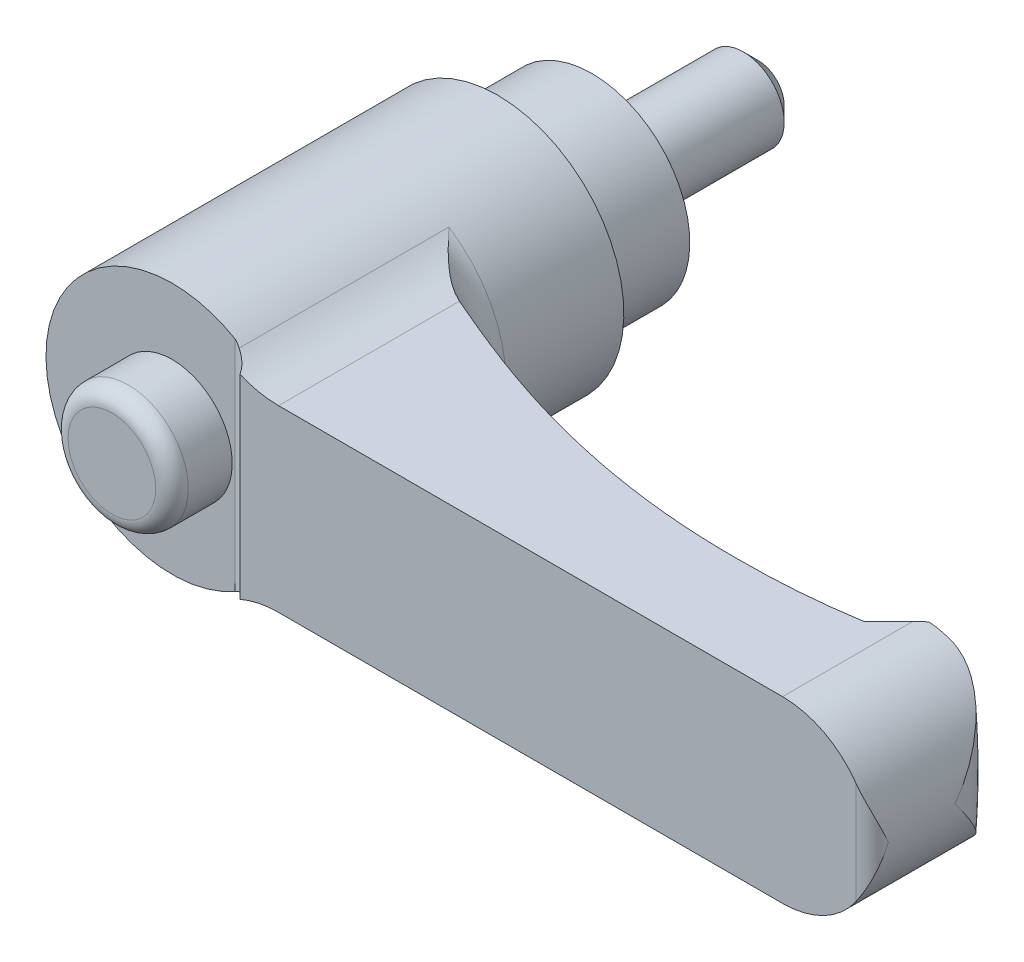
ISO-10303-21;
HEADER;
FILE_DESCRIPTION(('STEP AP214'),'2;1');
FILE_NAME('part.step','',(''),(''),'','','');
FILE_SCHEMA(('AUTOMOTIVE_DESIGN { 1 0 10303 214 1 1 1 1 }'));
ENDSEC;
DATA;
#1=APPLICATION_CONTEXT('core data for automotive mechanical design processes');
#2=APPLICATION_PROTOCOL_DEFINITION('international standard','automotive_design',2000,#1);
#3=PRODUCT_CONTEXT('',#1,'mechanical');
#4=PRODUCT('Part','Part','',(#3));
#5=PRODUCT_RELATED_PRODUCT_CATEGORY('part','',(#4));
#6=PRODUCT_DEFINITION_FORMATION('','',#4);
#7=PRODUCT_DEFINITION_CONTEXT('part definition',#1,'design');
#8=PRODUCT_DEFINITION('design','',#6,#7);
#9=PRODUCT_DEFINITION_SHAPE('','',#8);
#10=(LENGTH_UNIT() NAMED_UNIT(*) SI_UNIT(.MILLI.,.METRE.));
#11=(NAMED_UNIT(*) PLANE_ANGLE_UNIT() SI_UNIT($,.RADIAN.));
#12=(NAMED_UNIT(*) SI_UNIT($,.STERADIAN.) SOLID_ANGLE_UNIT());
#13=UNCERTAINTY_MEASURE_WITH_UNIT(LENGTH_MEASURE(1.E-05),#10,'distance_accuracy_value','');
#14=(GEOMETRIC_REPRESENTATION_CONTEXT(3) GLOBAL_UNCERTAINTY_ASSIGNED_CONTEXT((#13)) GLOBAL_UNIT_ASSIGNED_CONTEXT((#10,
#11,#12)) REPRESENTATION_CONTEXT('',''));
#15=CARTESIAN_POINT('',(0.,0.,0.));
#16=DIRECTION('',(0.,0.,1.));
#17=DIRECTION('',(1.,0.,0.));
#18=AXIS2_PLACEMENT_3D('',#15,#16,#17);
#19=CARTESIAN_POINT('',(4.8,0.,0.));
#20=DIRECTION('',(0.,0.,1.));
#21=DIRECTION('',(0.,-1.,0.));
#22=AXIS2_PLACEMENT_3D('',#19,#20,#21);
#23=PLANE('',#22);
#24=CARTESIAN_POINT('',(0.,0.,0.));
#25=DIRECTION('',(0.,0.,-1.));
#26=DIRECTION('',(0.,1.,0.));
#27=AXIS2_PLACEMENT_3D('',#24,#25,#26);
#28=CIRCLE('',#27,2.5);
#29=CARTESIAN_POINT('',(0.,2.5,0.));
#30=VERTEX_POINT('',#29);
#31=EDGE_CURVE('E469',#30,#30,#28,.T.);
#32=ORIENTED_EDGE('',*,*,#31,.F.);
#33=EDGE_LOOP('',(#32));
#34=FACE_BOUND('',#33,.T.);
#35=CARTESIAN_POINT('',(0.,0.,0.));
#36=DIRECTION('',(0.,0.,-1.));
#37=DIRECTION('',(0.,1.,0.));
#38=AXIS2_PLACEMENT_3D('',#35,#36,#37);
#39=CIRCLE('',#38,4.8);
#40=CARTESIAN_POINT('',(0.,4.8,0.));
#41=VERTEX_POINT('',#40);
#42=EDGE_CURVE('E417',#41,#41,#39,.T.);
#43=ORIENTED_EDGE('',*,*,#42,.T.);
#44=EDGE_LOOP('',(#43));
#45=FACE_BOUND('',#44,.T.);
#46=ADVANCED_FACE('F14',(#34,#45),#23,.F.);
#47=CARTESIAN_POINT('',(0.,0.,26.));
#48=DIRECTION('',(0.,0.,-1.));
#49=DIRECTION('',(0.,1.,0.));
#50=AXIS2_PLACEMENT_3D('',#47,#48,#49);
#51=PLANE('',#50);
#52=CARTESIAN_POINT('',(0.,0.,26.));
#53=DIRECTION('',(0.,0.,-1.));
#54=DIRECTION('',(0.,1.,0.));
#55=AXIS2_PLACEMENT_3D('',#52,#53,#54);
#56=CIRCLE('',#55,7.75);
#57=CARTESIAN_POINT('',(3.875,-6.7116968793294,26.));
#58=VERTEX_POINT('',#57);
#59=CARTESIAN_POINT('',(3.875,6.7116968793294,26.));
#60=VERTEX_POINT('',#59);
#61=EDGE_CURVE('E364',#58,#60,#56,.T.);
#62=ORIENTED_EDGE('',*,*,#61,.F.);
#63=DIRECTION('',(0.,1.,0.));
#64=VECTOR('',#63,1.);
#65=CARTESIAN_POINT('',(3.875,-11.,26.));
#66=LINE('',#65,#64);
#67=EDGE_CURVE('E451',#58,#60,#66,.T.);
#68=ORIENTED_EDGE('',*,*,#67,.T.);
#69=EDGE_LOOP('',(#62,#68));
#70=FACE_BOUND('',#69,.T.);
#71=CARTESIAN_POINT('',(0.,0.,26.));
#72=DIRECTION('',(0.,0.,-1.));
#73=DIRECTION('',(0.,1.,0.));
#74=AXIS2_PLACEMENT_3D('',#71,#72,#73);
#75=CIRCLE('',#74,3.69047619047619);
#76=CARTESIAN_POINT('',(0.,3.69047619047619,26.));
#77=VERTEX_POINT('',#76);
#78=EDGE_CURVE('E183',#77,#77,#75,.F.);
#79=ORIENTED_EDGE('',*,*,#78,.F.);
#80=EDGE_LOOP('',(#79));
#81=FACE_BOUND('',#80,.T.);
#82=ADVANCED_FACE('F158',(#70,#81),#51,.F.);
#83=CARTESIAN_POINT('',(38.5,0.,0.));
#84=DIRECTION('',(0.,0.,1.));
#85=DIRECTION('',(0.,-1.,0.));
#86=AXIS2_PLACEMENT_3D('',#83,#84,#85);
#87=CYLINDRICAL_SURFACE('',#86,5.5);
#88=CARTESIAN_POINT('',(44.,0.,21.9));
#89=CARTESIAN_POINT('',(44.0000000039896,-0.00425779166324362,21.8968685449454));
#90=CARTESIAN_POINT('',(43.9999950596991,-0.00851571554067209,21.8937369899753));
#91=CARTESIAN_POINT('',(43.9991083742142,-0.390143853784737,21.6130627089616));
#92=CARTESIAN_POINT('',(43.9593602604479,-0.76848056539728,21.3348044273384));
#93=CARTESIAN_POINT('',(43.8405607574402,-1.32856821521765,20.92503354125));
#94=CARTESIAN_POINT('',(43.7909532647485,-1.51435974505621,20.7894725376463));
#95=CARTESIAN_POINT('',(43.6715029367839,-1.88225773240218,20.5222473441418));
#96=CARTESIAN_POINT('',(43.601669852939,-2.06436592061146,20.3905813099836));
#97=CARTESIAN_POINT('',(43.4611872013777,-2.37875122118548,20.1648816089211));
#98=CARTESIAN_POINT('',(43.3950453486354,-2.51217438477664,20.0696210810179));
#99=CARTESIAN_POINT('',(43.250799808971,-2.77532702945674,19.8831417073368));
#100=CARTESIAN_POINT('',(43.1726935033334,-2.90505569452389,19.7919237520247));
#101=CARTESIAN_POINT('',(42.9202953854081,-3.28692053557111,19.5261795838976));
#102=CARTESIAN_POINT('',(42.727561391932,-3.53256609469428,19.3589622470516));
#103=CARTESIAN_POINT('',(42.3484683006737,-3.93634172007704,19.0952853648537));
#104=CARTESIAN_POINT('',(42.1735223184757,-4.10060224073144,18.9917399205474));
#105=CARTESIAN_POINT('',(41.7960798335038,-4.40966486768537,18.8081296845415));
#106=CARTESIAN_POINT('',(41.5936163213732,-4.55448986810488,18.7280371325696));
#107=CARTESIAN_POINT('',(41.2098130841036,-4.79019974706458,18.6136936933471));
#108=CARTESIAN_POINT('',(41.0333744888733,-4.88597642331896,18.5732748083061));
#109=CARTESIAN_POINT('',(40.7593164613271,-5.01555037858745,18.5310688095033));
#110=CARTESIAN_POINT('',(40.666374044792,-5.05640116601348,18.5200701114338));
#111=CARTESIAN_POINT('',(40.4779067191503,-5.13305107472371,18.5048417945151));
#112=CARTESIAN_POINT('',(40.3823830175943,-5.16885251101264,18.5006090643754));
#113=CARTESIAN_POINT('',(40.1884747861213,-5.23542428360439,18.4995076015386));
#114=CARTESIAN_POINT('',(40.090071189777,-5.26614066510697,18.5027130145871));
#115=CARTESIAN_POINT('',(39.8922874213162,-5.32184956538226,18.5171885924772));
#116=CARTESIAN_POINT('',(39.7929078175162,-5.34684523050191,18.528454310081));
#117=CARTESIAN_POINT('',(39.5942462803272,-5.39100815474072,18.5594647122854));
#118=CARTESIAN_POINT('',(39.4949643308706,-5.41017990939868,18.5792028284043));
#119=CARTESIAN_POINT('',(39.2976352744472,-5.44277299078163,18.6274002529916));
#120=CARTESIAN_POINT('',(39.1995875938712,-5.45619709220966,18.6558553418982));
#121=CARTESIAN_POINT('',(38.9984921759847,-5.47836544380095,18.7240647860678));
#122=CARTESIAN_POINT('',(38.8956289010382,-5.48667774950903,18.7645122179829));
#123=CARTESIAN_POINT('',(38.7445568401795,-5.49479244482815,18.8326405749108));
#124=CARTESIAN_POINT('',(38.6947409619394,-5.49677173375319,18.8565904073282));
#125=CARTESIAN_POINT('',(38.5963240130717,-5.49937673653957,18.9069325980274));
#126=CARTESIAN_POINT('',(38.5477229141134,-5.50000248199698,18.9333248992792));
#127=CARTESIAN_POINT('',(38.4998,-5.49999999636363,18.9609171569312));
#128=B_SPLINE_CURVE_WITH_KNOTS('',3,(#88,#89,#90,#91,#92,#93,#94,#95,#96,#97,#98,#99,#100,#101,
#102,#103,#104,#105,#106,#107,#108,#109,#110,#111,#112,#113,#114,#115,#116,#117,#118,#119,#120,
#121,#122,#123,#124,#125,#126,#127),.UNSPECIFIED.,.F.,.F.,(4,2,2,2,2,2,2,2,2,2,2,2,2,2,2,2,2,2,
2,4),(0.,0.0158565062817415,1.4211419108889,2.12636053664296,2.83123971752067,3.36110592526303,
3.89108827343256,4.94782257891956,5.7293360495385,6.50992069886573,7.12169061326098,
7.42772009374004,7.73360880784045,8.04255979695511,8.35134045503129,8.65988215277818,
8.96827473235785,9.30004722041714,9.46590364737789,9.63175620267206),.UNSPECIFIED.);
#129=CARTESIAN_POINT('',(40.2644155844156,-5.20930299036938,18.5));
#130=VERTEX_POINT('',#129);
#131=CARTESIAN_POINT('',(44.,0.,21.9));
#132=VERTEX_POINT('',#131);
#133=EDGE_CURVE('E126',#130,#132,#128,.F.);
#134=ORIENTED_EDGE('',*,*,#133,.T.);
#135=CARTESIAN_POINT('',(44.,0.,21.9));
#136=CARTESIAN_POINT('',(44.0000000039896,0.00425779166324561,21.8968685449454));
#137=CARTESIAN_POINT('',(43.9999950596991,0.00851571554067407,21.8937369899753));
#138=CARTESIAN_POINT('',(43.9991083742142,0.390143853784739,21.6130627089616));
#139=CARTESIAN_POINT('',(43.9593602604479,0.768480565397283,21.3348044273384));
#140=CARTESIAN_POINT('',(43.8405607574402,1.32856821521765,20.92503354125));
#141=CARTESIAN_POINT('',(43.7909532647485,1.51435974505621,20.7894725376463));
#142=CARTESIAN_POINT('',(43.6715029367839,1.88225773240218,20.5222473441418));
#143=CARTESIAN_POINT('',(43.601669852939,2.06436592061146,20.3905813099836));
#144=CARTESIAN_POINT('',(43.4611872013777,2.37875122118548,20.1648816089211));
#145=CARTESIAN_POINT('',(43.3950453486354,2.51217438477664,20.0696210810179));
#146=CARTESIAN_POINT('',(43.250799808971,2.77532702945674,19.8831417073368));
#147=CARTESIAN_POINT('',(43.1726935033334,2.9050556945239,19.7919237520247));
#148=CARTESIAN_POINT('',(42.9202953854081,3.28692053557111,19.5261795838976));
#149=CARTESIAN_POINT('',(42.727561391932,3.53256609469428,19.3589622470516));
#150=CARTESIAN_POINT('',(42.3484683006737,3.93634172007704,19.0952853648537));
#151=CARTESIAN_POINT('',(42.1735223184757,4.10060224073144,18.9917399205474));
#152=CARTESIAN_POINT('',(41.7960798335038,4.40966486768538,18.8081296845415));
#153=CARTESIAN_POINT('',(41.5936163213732,4.55448986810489,18.7280371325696));
#154=CARTESIAN_POINT('',(41.2098130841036,4.79019974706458,18.6136936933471));
#155=CARTESIAN_POINT('',(41.0333744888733,4.88597642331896,18.5732748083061));
#156=CARTESIAN_POINT('',(40.7593164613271,5.01555037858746,18.5310688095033));
#157=CARTESIAN_POINT('',(40.666374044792,5.05640116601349,18.5200701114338));
#158=CARTESIAN_POINT('',(40.4779067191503,5.13305107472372,18.5048417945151));
#159=CARTESIAN_POINT('',(40.3823830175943,5.16885251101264,18.5006090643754));
#160=CARTESIAN_POINT('',(40.1884747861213,5.23542428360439,18.4995076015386));
#161=CARTESIAN_POINT('',(40.090071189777,5.26614066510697,18.5027130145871));
#162=CARTESIAN_POINT('',(39.8922874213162,5.32184956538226,18.5171885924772));
#163=CARTESIAN_POINT('',(39.7929078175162,5.34684523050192,18.528454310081));
#164=CARTESIAN_POINT('',(39.5942462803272,5.39100815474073,18.5594647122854));
#165=CARTESIAN_POINT('',(39.4949643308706,5.41017990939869,18.5792028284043));
#166=CARTESIAN_POINT('',(39.2976352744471,5.44277299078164,18.6274002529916));
#167=CARTESIAN_POINT('',(39.1995875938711,5.45619709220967,18.6558553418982));
#168=CARTESIAN_POINT('',(38.9984921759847,5.47836544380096,18.7240647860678));
#169=CARTESIAN_POINT('',(38.8956289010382,5.48667774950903,18.7645122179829));
#170=CARTESIAN_POINT('',(38.7445568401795,5.49479244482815,18.8326405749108));
#171=CARTESIAN_POINT('',(38.6947409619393,5.4967717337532,18.8565904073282));
#172=CARTESIAN_POINT('',(38.5963240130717,5.49937673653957,18.9069325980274));
#173=CARTESIAN_POINT('',(38.5477229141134,5.50000248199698,18.9333248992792));
#174=CARTESIAN_POINT('',(38.4998,5.49999999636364,18.9609171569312));
#175=B_SPLINE_CURVE_WITH_KNOTS('',3,(#135,#136,#137,#138,#139,#140,#141,#142,#143,#144,#145,
#146,#147,#148,#149,#150,#151,#152,#153,#154,#155,#156,#157,#158,#159,#160,#161,#162,#163,#164,
#165,#166,#167,#168,#169,#170,#171,#172,#173,#174),.UNSPECIFIED.,.F.,.F.,(4,2,2,2,2,2,2,2,2,2,2,
2,2,2,2,2,2,2,2,4),(0.,0.0158565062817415,1.4211419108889,2.12636053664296,2.83123971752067,
3.36110592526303,3.89108827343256,4.94782257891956,5.72933604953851,6.50992069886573,
7.12169061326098,7.42772009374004,7.73360880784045,8.04255979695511,8.35134045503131,
8.6598821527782,8.9682747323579,9.30004722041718,9.46590364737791,9.63175620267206),.UNSPECIFIED.);
#176=CARTESIAN_POINT('',(40.2644155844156,5.20930299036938,18.5));
#177=VERTEX_POINT('',#176);
#178=EDGE_CURVE('E123',#132,#177,#175,.T.);
#179=ORIENTED_EDGE('',*,*,#178,.T.);
#180=CARTESIAN_POINT('',(38.5,0.,18.5));
#181=DIRECTION('',(0.,0.,-1.));
#182=DIRECTION('',(0.,1.,0.));
#183=AXIS2_PLACEMENT_3D('',#180,#181,#182);
#184=CIRCLE('',#183,5.5);
#185=CARTESIAN_POINT('',(39.,5.47722557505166,18.5));
#186=VERTEX_POINT('',#185);
#187=EDGE_CURVE('E457',#177,#186,#184,.F.);
#188=ORIENTED_EDGE('',*,*,#187,.T.);
#189=CARTESIAN_POINT('',(38.5,0.,19.));
#190=DIRECTION('',(-0.707106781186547,0.,-0.707106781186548));
#191=DIRECTION('',(-0.707106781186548,0.,0.707106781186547));
#192=AXIS2_PLACEMENT_3D('',#189,#190,#191);
#193=ELLIPSE('',#192,7.77817459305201,5.5);
#194=CARTESIAN_POINT('',(38.5,5.5,19.));
#195=VERTEX_POINT('',#194);
#196=EDGE_CURVE('E390',#186,#195,#193,.F.);
#197=ORIENTED_EDGE('',*,*,#196,.T.);
#198=DIRECTION('',(0.,0.,1.));
#199=VECTOR('',#198,1.);
#200=CARTESIAN_POINT('',(38.5,5.5,0.));
#201=LINE('',#200,#199);
#202=CARTESIAN_POINT('',(38.5,5.5,27.));
#203=VERTEX_POINT('',#202);
#204=EDGE_CURVE('E389',#195,#203,#201,.T.);
#205=ORIENTED_EDGE('',*,*,#204,.T.);
#206=CARTESIAN_POINT('',(38.5,0.,27.));
#207=DIRECTION('',(0.,0.,1.));
#208=DIRECTION('',(0.,-1.,0.));
#209=AXIS2_PLACEMENT_3D('',#206,#207,#208);
#210=CIRCLE('',#209,5.5);
#211=CARTESIAN_POINT('',(43.,3.16227766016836,27.));
#212=VERTEX_POINT('',#211);
#213=EDGE_CURVE('E367',#212,#203,#210,.T.);
#214=ORIENTED_EDGE('',*,*,#213,.F.);
#215=CARTESIAN_POINT('',(43.,3.16227766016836,27.));
#216=CARTESIAN_POINT('',(43.0489698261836,3.09261080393,26.9999556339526));
#217=CARTESIAN_POINT('',(43.0962528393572,3.0218687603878,26.9964077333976));
#218=CARTESIAN_POINT('',(43.1871872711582,2.87878712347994,26.9834058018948));
#219=CARTESIAN_POINT('',(43.2308453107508,2.80645076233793,26.9739628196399));
#220=CARTESIAN_POINT('',(43.3141980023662,2.66092047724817,26.9503365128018));
#221=CARTESIAN_POINT('',(43.3539154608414,2.58773460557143,26.9361828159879));
#222=CARTESIAN_POINT('',(43.4296865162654,2.44030003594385,26.903917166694));
#223=CARTESIAN_POINT('',(43.4657377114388,2.36605067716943,26.8858026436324));
#224=CARTESIAN_POINT('',(43.5573559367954,2.16613298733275,26.8329178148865));
#225=CARTESIAN_POINT('',(43.6095944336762,2.03971389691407,26.7951786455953));
#226=CARTESIAN_POINT('',(43.703955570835,1.78529411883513,26.7129945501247));
#227=CARTESIAN_POINT('',(43.7460735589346,1.65729273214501,26.6685465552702));
#228=CARTESIAN_POINT('',(43.8205857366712,1.39978291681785,26.5746664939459));
#229=CARTESIAN_POINT('',(43.852946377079,1.27027084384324,26.5252179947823));
#230=CARTESIAN_POINT('',(43.9079882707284,1.01058108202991,26.4229956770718));
#231=CARTESIAN_POINT('',(43.9306732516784,0.880403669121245,26.3702231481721));
#232=CARTESIAN_POINT('',(43.9654953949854,0.627432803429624,26.2658240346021));
#233=CARTESIAN_POINT('',(43.9781829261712,0.504664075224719,26.2143181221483));
#234=CARTESIAN_POINT('',(43.9952673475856,0.259135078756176,26.1104803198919));
#235=CARTESIAN_POINT('',(43.9996786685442,0.136375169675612,26.0581500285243));
#236=CARTESIAN_POINT('',(43.9999943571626,0.00909584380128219,26.0038784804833));
#237=CARTESIAN_POINT('',(43.9999999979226,0.00454789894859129,26.0019392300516));
#238=CARTESIAN_POINT('',(44.,0.,26.));
#239=B_SPLINE_CURVE_WITH_KNOTS('',3,(#215,#216,#217,#218,#219,#220,#221,#222,#223,#224,#225,
#226,#227,#228,#229,#230,#231,#232,#233,#234,#235,#236,#237,#238),.UNSPECIFIED.,.F.,.F.,(4,2,2,
2,2,2,2,2,2,2,2,4),(0.,0.255244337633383,0.510011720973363,0.763206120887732,1.01656533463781,
1.44159949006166,1.8668286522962,2.2935036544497,2.72001412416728,3.12097942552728,
3.52124493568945,3.53607734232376),.UNSPECIFIED.);
#240=CARTESIAN_POINT('',(44.,0.,26.));
#241=VERTEX_POINT('',#240);
#242=EDGE_CURVE('E169',#241,#212,#239,.F.);
#243=ORIENTED_EDGE('',*,*,#242,.F.);
#244=CARTESIAN_POINT('',(43.,-3.16227766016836,27.));
#245=CARTESIAN_POINT('',(43.0489698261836,-3.09261080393,26.9999556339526));
#246=CARTESIAN_POINT('',(43.0962528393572,-3.0218687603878,26.9964077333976));
#247=CARTESIAN_POINT('',(43.1871872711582,-2.87878712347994,26.9834058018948));
#248=CARTESIAN_POINT('',(43.2308453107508,-2.80645076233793,26.9739628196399));
#249=CARTESIAN_POINT('',(43.3141980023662,-2.66092047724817,26.9503365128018));
#250=CARTESIAN_POINT('',(43.3539154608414,-2.58773460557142,26.9361828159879));
#251=CARTESIAN_POINT('',(43.4296865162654,-2.44030003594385,26.903917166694));
#252=CARTESIAN_POINT('',(43.4657377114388,-2.36605067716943,26.8858026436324));
#253=CARTESIAN_POINT('',(43.5573559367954,-2.16613298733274,26.8329178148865));
#254=CARTESIAN_POINT('',(43.6095944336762,-2.03971389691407,26.7951786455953));
#255=CARTESIAN_POINT('',(43.703955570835,-1.78529411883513,26.7129945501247));
#256=CARTESIAN_POINT('',(43.7460735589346,-1.65729273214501,26.6685465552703));
#257=CARTESIAN_POINT('',(43.8205857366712,-1.39978291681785,26.5746664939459));
#258=CARTESIAN_POINT('',(43.852946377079,-1.27027084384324,26.5252179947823));
#259=CARTESIAN_POINT('',(43.9079882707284,-1.01058108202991,26.4229956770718));
#260=CARTESIAN_POINT('',(43.9306732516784,-0.880403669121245,26.3702231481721));
#261=CARTESIAN_POINT('',(43.9654953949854,-0.627432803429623,26.2658240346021));
#262=CARTESIAN_POINT('',(43.9781829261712,-0.504664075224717,26.2143181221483));
#263=CARTESIAN_POINT('',(43.9952673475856,-0.259135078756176,26.1104803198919));
#264=CARTESIAN_POINT('',(43.9996786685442,-0.136375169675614,26.0581500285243));
#265=CARTESIAN_POINT('',(43.9999943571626,-0.00909584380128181,26.0038784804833));
#266=CARTESIAN_POINT('',(43.9999999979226,-0.00454789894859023,26.0019392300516));
#267=CARTESIAN_POINT('',(44.,0.,26.));
#268=B_SPLINE_CURVE_WITH_KNOTS('',3,(#244,#245,#246,#247,#248,#249,#250,#251,#252,#253,#254,
#255,#256,#257,#258,#259,#260,#261,#262,#263,#264,#265,#266,#267),.UNSPECIFIED.,.F.,.F.,(4,2,2,
2,2,2,2,2,2,2,2,4),(0.,0.255244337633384,0.510011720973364,0.763206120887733,1.01656533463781,
1.44159949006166,1.8668286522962,2.2935036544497,2.72001412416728,3.12097942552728,
3.52124493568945,3.53607734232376),.UNSPECIFIED.);
#269=CARTESIAN_POINT('',(43.,-3.16227766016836,27.));
#270=VERTEX_POINT('',#269);
#271=EDGE_CURVE('E177',#270,#241,#268,.T.);
#272=ORIENTED_EDGE('',*,*,#271,.F.);
#273=CARTESIAN_POINT('',(38.5,-5.5,27.));
#274=VERTEX_POINT('',#273);
#275=EDGE_CURVE('E373',#274,#270,#210,.T.);
#276=ORIENTED_EDGE('',*,*,#275,.F.);
#277=DIRECTION('',(0.,0.,1.));
#278=VECTOR('',#277,1.);
#279=CARTESIAN_POINT('',(38.5,-5.5,0.));
#280=LINE('',#279,#278);
#281=CARTESIAN_POINT('',(38.5,-5.5,19.));
#282=VERTEX_POINT('',#281);
#283=EDGE_CURVE('E393',#282,#274,#280,.T.);
#284=ORIENTED_EDGE('',*,*,#283,.F.);
#285=CARTESIAN_POINT('',(39.,-5.47722557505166,18.5));
#286=VERTEX_POINT('',#285);
#287=EDGE_CURVE('E440',#282,#286,#193,.F.);
#288=ORIENTED_EDGE('',*,*,#287,.T.);
#289=EDGE_CURVE('E134',#286,#130,#184,.F.);
#290=ORIENTED_EDGE('',*,*,#289,.T.);
#291=EDGE_LOOP('',(#134,#179,#188,#197,#205,#214,#243,#272,#276,#284,#288,#290));
#292=FACE_BOUND('',#291,.T.);
#293=ADVANCED_FACE('F132',(#292),#87,.T.);
#294=CARTESIAN_POINT('',(40.6,-11.,18.5));
#295=DIRECTION('',(0.,0.,-1.));
#296=DIRECTION('',(0.,1.,0.));
#297=AXIS2_PLACEMENT_3D('',#294,#295,#296);
#298=PLANE('',#297);
#299=ORIENTED_EDGE('',*,*,#187,.F.);
#300=CARTESIAN_POINT('',(0.,0.,18.5));
#301=DIRECTION('',(0.,0.,-1.));
#302=DIRECTION('',(0.,1.,0.));
#303=AXIS2_PLACEMENT_3D('',#300,#301,#302);
#304=CIRCLE('',#303,40.6);
#305=EDGE_CURVE('E37',#177,#130,#304,.T.);
#306=ORIENTED_EDGE('',*,*,#305,.T.);
#307=ORIENTED_EDGE('',*,*,#289,.F.);
#308=DIRECTION('',(0.,1.,0.));
#309=VECTOR('',#308,1.);
#310=CARTESIAN_POINT('',(39.,-11.,18.5));
#311=LINE('',#310,#309);
#312=EDGE_CURVE('E448',#286,#186,#311,.T.);
#313=ORIENTED_EDGE('',*,*,#312,.T.);
#314=EDGE_LOOP('',(#299,#306,#307,#313));
#315=FACE_BOUND('',#314,.T.);
#316=ADVANCED_FACE('F157',(#315),#298,.T.);
#317=CARTESIAN_POINT('',(0.,0.,27.));
#318=DIRECTION('',(0.,0.,1.));
#319=DIRECTION('',(0.,-1.,0.));
#320=AXIS2_PLACEMENT_3D('',#317,#318,#319);
#321=PLANE('',#320);
#322=CARTESIAN_POINT('',(7.53740671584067,11.5,27.));
#323=DIRECTION('',(0.,0.,1.));
#324=DIRECTION('',(1.,0.,0.));
#325=AXIS2_PLACEMENT_3D('',#322,#323,#324);
#326=CIRCLE('',#325,6.);
#327=CARTESIAN_POINT('',(5.16666666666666,5.988231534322,27.));
#328=VERTEX_POINT('',#327);
#329=CARTESIAN_POINT('',(7.53740671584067,5.5,27.));
#330=VERTEX_POINT('',#329);
#331=EDGE_CURVE('E398',#328,#330,#326,.T.);
#332=ORIENTED_EDGE('',*,*,#331,.F.);
#333=DIRECTION('',(0.,1.,0.));
#334=VECTOR('',#333,1.);
#335=CARTESIAN_POINT('',(5.16666666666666,-11.,27.));
#336=LINE('',#335,#334);
#337=CARTESIAN_POINT('',(5.16666666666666,-5.988231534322,27.));
#338=VERTEX_POINT('',#337);
#339=EDGE_CURVE('E436',#338,#328,#336,.T.);
#340=ORIENTED_EDGE('',*,*,#339,.F.);
#341=CARTESIAN_POINT('',(7.53740671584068,-11.5,27.));
#342=DIRECTION('',(0.,0.,1.));
#343=DIRECTION('',(1.,0.,0.));
#344=AXIS2_PLACEMENT_3D('',#341,#342,#343);
#345=CIRCLE('',#344,6.);
#346=CARTESIAN_POINT('',(7.53740671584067,-5.5,27.));
#347=VERTEX_POINT('',#346);
#348=EDGE_CURVE('E401',#347,#338,#345,.T.);
#349=ORIENTED_EDGE('',*,*,#348,.F.);
#350=DIRECTION('',(-1.,0.,0.));
#351=VECTOR('',#350,1.);
#352=CARTESIAN_POINT('',(38.5,-5.5,27.));
#353=LINE('',#352,#351);
#354=EDGE_CURVE('E397',#274,#347,#353,.T.);
#355=ORIENTED_EDGE('',*,*,#354,.F.);
#356=ORIENTED_EDGE('',*,*,#275,.T.);
#357=DIRECTION('',(0.,1.,0.));
#358=VECTOR('',#357,1.);
#359=CARTESIAN_POINT('',(43.,-11.,27.));
#360=LINE('',#359,#358);
#361=EDGE_CURVE('E385',#270,#212,#360,.T.);
#362=ORIENTED_EDGE('',*,*,#361,.T.);
#363=ORIENTED_EDGE('',*,*,#213,.T.);
#364=DIRECTION('',(1.,0.,0.));
#365=VECTOR('',#364,1.);
#366=CARTESIAN_POINT('',(7.53740671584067,5.5,27.));
#367=LINE('',#366,#365);
#368=EDGE_CURVE('E384',#330,#203,#367,.T.);
#369=ORIENTED_EDGE('',*,*,#368,.F.);
#370=EDGE_LOOP('',(#332,#340,#349,#355,#356,#362,#363,#369));
#371=FACE_BOUND('',#370,.T.);
#372=ADVANCED_FACE('F240',(#371),#321,.T.);
#373=CARTESIAN_POINT('',(0.,0.,0.));
#374=DIRECTION('',(0.,0.,-1.));
#375=DIRECTION('',(0.,1.,0.));
#376=AXIS2_PLACEMENT_3D('',#373,#374,#375);
#377=CYLINDRICAL_SURFACE('',#376,7.75);
#378=CARTESIAN_POINT('',(0.,0.,13.2417430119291));
#379=DIRECTION('',(0.,0.,-1.));
#380=DIRECTION('',(0.,1.,0.));
#381=AXIS2_PLACEMENT_3D('',#378,#379,#380);
#382=CIRCLE('',#381,7.75);
#383=CARTESIAN_POINT('',(4.24835651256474,6.48181818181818,13.2417430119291));
#384=VERTEX_POINT('',#383);
#385=CARTESIAN_POINT('',(4.24835651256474,-6.48181818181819,13.2417430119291));
#386=VERTEX_POINT('',#385);
#387=EDGE_CURVE('E359',#384,#386,#382,.T.);
#388=ORIENTED_EDGE('',*,*,#387,.T.);
#389=DIRECTION('',(0.,0.,1.));
#390=VECTOR('',#389,1.);
#391=CARTESIAN_POINT('',(4.24835651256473,-6.48181818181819,0.));
#392=LINE('',#391,#390);
#393=CARTESIAN_POINT('',(4.24835651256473,-6.48181818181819,26.1308937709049));
#394=VERTEX_POINT('',#393);
#395=EDGE_CURVE('E409',#386,#394,#392,.T.);
#396=ORIENTED_EDGE('',*,*,#395,.T.);
#397=CARTESIAN_POINT('',(3.875,-6.7116968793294,26.));
#398=CARTESIAN_POINT('',(3.9487248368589,-6.66914880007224,26.0179048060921));
#399=CARTESIAN_POINT('',(4.02097408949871,-6.62579988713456,26.039874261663));
#400=CARTESIAN_POINT('',(4.16199829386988,-6.53812669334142,26.0915573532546));
#401=CARTESIAN_POINT('',(4.23077434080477,-6.49380272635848,26.1212685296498));
#402=CARTESIAN_POINT('',(4.36202505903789,-6.40634475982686,26.1868862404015));
#403=CARTESIAN_POINT('',(4.42463632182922,-6.36322379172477,26.2225378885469));
#404=CARTESIAN_POINT('',(4.54579687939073,-6.27724013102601,26.3004737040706));
#405=CARTESIAN_POINT('',(4.60434578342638,-6.23437746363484,26.3427585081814));
#406=CARTESIAN_POINT('',(4.71026264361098,-6.1546555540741,26.4283893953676));
#407=CARTESIAN_POINT('',(4.75813291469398,-6.11768751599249,26.4710140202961));
#408=CARTESIAN_POINT('',(4.8500303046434,-6.04509175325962,26.56120031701));
#409=CARTESIAN_POINT('',(4.89405965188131,-6.00946325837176,26.6087590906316));
#410=CARTESIAN_POINT('',(4.97925799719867,-5.9390764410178,26.7103994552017));
#411=CARTESIAN_POINT('',(5.02029084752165,-5.90438218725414,26.7646407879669));
#412=CARTESIAN_POINT('',(5.09738332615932,-5.83796295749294,26.8783962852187));
#413=CARTESIAN_POINT('',(5.13343386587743,-5.80624344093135,26.9379197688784));
#414=CARTESIAN_POINT('',(5.16666666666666,-5.77650894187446,27.));
#415=B_SPLINE_CURVE_WITH_KNOTS('',3,(#397,#398,#399,#400,#401,#402,#403,#404,#405,#406,#407,
#408,#409,#410,#411,#412,#413,#414),.UNSPECIFIED.,.F.,.F.,(4,2,2,2,2,2,2,2,4),(0.,
0.26081186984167,0.521540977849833,0.773092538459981,1.02466826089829,1.24638864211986,
1.4679795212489,1.6966429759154,1.92571819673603),.UNSPECIFIED.);
#416=EDGE_CURVE('E214',#58,#394,#415,.T.);
#417=ORIENTED_EDGE('',*,*,#416,.F.);
#418=ORIENTED_EDGE('',*,*,#61,.T.);
#419=CARTESIAN_POINT('',(5.16666666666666,5.77650894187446,27.));
#420=CARTESIAN_POINT('',(5.13714077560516,5.80292379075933,26.9448365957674));
#421=CARTESIAN_POINT('',(5.1053831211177,5.83091583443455,26.8916890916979));
#422=CARTESIAN_POINT('',(5.03785941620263,5.88934998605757,26.7895453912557));
#423=CARTESIAN_POINT('',(5.00209830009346,5.91978906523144,26.7405442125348));
#424=CARTESIAN_POINT('',(4.92700880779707,5.98243056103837,26.646752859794));
#425=CARTESIAN_POINT('',(4.88768622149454,6.01463008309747,26.6019560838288));
#426=CARTESIAN_POINT('',(4.80573825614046,6.08030777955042,26.5165060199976));
#427=CARTESIAN_POINT('',(4.76311181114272,6.11378636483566,26.4758540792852));
#428=CARTESIAN_POINT('',(4.63114473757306,6.21507952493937,26.3605779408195));
#429=CARTESIAN_POINT('',(4.53728284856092,6.28411879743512,26.2920994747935));
#430=CARTESIAN_POINT('',(4.3393749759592,6.42237347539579,26.1724069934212));
#431=CARTESIAN_POINT('',(4.23533663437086,6.49158871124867,26.1211801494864));
#432=CARTESIAN_POINT('',(4.08621326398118,6.5854168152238,26.0632790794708));
#433=CARTESIAN_POINT('',(4.04469277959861,6.61100425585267,26.0487072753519));
#434=CARTESIAN_POINT('',(3.96061680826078,6.66171281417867,26.0222973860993));
#435=CARTESIAN_POINT('',(3.91806319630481,6.68683464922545,26.0104547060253));
#436=CARTESIAN_POINT('',(3.8750000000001,6.7116968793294,26.));
#437=B_SPLINE_CURVE_WITH_KNOTS('',3,(#419,#420,#421,#422,#423,#424,#425,#426,#427,#428,#429,
#430,#431,#432,#433,#434,#435,#436),.UNSPECIFIED.,.F.,.F.,(4,2,2,2,2,2,2,2,4),(0.,
0.203583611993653,0.406919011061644,0.609929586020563,0.81300593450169,1.21684507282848,
1.62038324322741,1.77301957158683,1.92539700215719),.UNSPECIFIED.);
#438=CARTESIAN_POINT('',(4.24835651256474,6.48181818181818,26.1308937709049));
#439=VERTEX_POINT('',#438);
#440=EDGE_CURVE('E228',#439,#60,#437,.T.);
#441=ORIENTED_EDGE('',*,*,#440,.F.);
#442=DIRECTION('',(0.,0.,1.));
#443=VECTOR('',#442,1.);
#444=CARTESIAN_POINT('',(4.24835651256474,6.48181818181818,0.));
#445=LINE('',#444,#443);
#446=EDGE_CURVE('E415',#384,#439,#445,.T.);
#447=ORIENTED_EDGE('',*,*,#446,.F.);
#448=EDGE_LOOP('',(#388,#396,#417,#418,#441,#447));
#449=FACE_BOUND('',#448,.T.);
#450=CARTESIAN_POINT('',(0.,0.,6.));
#451=DIRECTION('',(0.,0.,-1.));
#452=DIRECTION('',(0.,1.,0.));
#453=AXIS2_PLACEMENT_3D('',#450,#451,#452);
#454=CIRCLE('',#453,7.75);
#455=CARTESIAN_POINT('',(0.,7.75,6.));
#456=VERTEX_POINT('',#455);
#457=EDGE_CURVE('E362',#456,#456,#454,.T.);
#458=ORIENTED_EDGE('',*,*,#457,.F.);
#459=EDGE_LOOP('',(#458));
#460=FACE_BOUND('',#459,.T.);
#461=ADVANCED_FACE('F238',(#449,#460),#377,.T.);
#462=CARTESIAN_POINT('',(7.53740671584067,11.5,0.));
#463=DIRECTION('',(0.,0.,1.));
#464=DIRECTION('',(0.,-1.,0.));
#465=AXIS2_PLACEMENT_3D('',#462,#463,#464);
#466=CYLINDRICAL_SURFACE('',#465,6.);
#467=DIRECTION('',(0.,0.,1.));
#468=VECTOR('',#467,1.);
#469=CARTESIAN_POINT('',(7.53740671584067,5.5,0.));
#470=LINE('',#469,#468);
#471=CARTESIAN_POINT('',(7.53740671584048,5.5,15.8847846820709));
#472=VERTEX_POINT('',#471);
#473=EDGE_CURVE('E392',#472,#330,#470,.T.);
#474=ORIENTED_EDGE('',*,*,#473,.F.);
#475=CARTESIAN_POINT('',(7.53760671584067,5.50000000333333,15.8848714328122));
#476=CARTESIAN_POINT('',(7.42056429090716,5.50000237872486,15.8340928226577));
#477=CARTESIAN_POINT('',(7.30547455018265,5.50341530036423,15.7791506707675));
#478=CARTESIAN_POINT('',(7.07949807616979,5.51642945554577,15.6622782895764));
#479=CARTESIAN_POINT('',(6.96860436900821,5.52601989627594,15.6003604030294));
#480=CARTESIAN_POINT('',(6.64350339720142,5.56296716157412,15.4067136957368));
#481=CARTESIAN_POINT('',(6.43532620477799,5.59851698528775,15.2663869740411));
#482=CARTESIAN_POINT('',(6.04665859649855,5.68493972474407,14.9793319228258));
#483=CARTESIAN_POINT('',(5.86525717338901,5.73477067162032,14.8334864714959));
#484=CARTESIAN_POINT('',(5.51460300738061,5.84825422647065,14.5326629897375));
#485=CARTESIAN_POINT('',(5.34535978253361,5.91191750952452,14.3776779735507));
#486=CARTESIAN_POINT('',(5.01722866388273,6.05200819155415,14.0618166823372));
#487=CARTESIAN_POINT('',(4.85836829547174,6.12846774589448,13.9009263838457));
#488=CARTESIAN_POINT('',(4.55010273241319,6.29360411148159,13.5765860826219));
#489=CARTESIAN_POINT('',(4.40069155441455,6.3822730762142,13.4131377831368));
#490=CARTESIAN_POINT('',(4.25307835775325,6.47872574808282,13.2470592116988));
#491=CARTESIAN_POINT('',(4.25071688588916,6.48027113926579,13.2444011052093));
#492=CARTESIAN_POINT('',(4.24835651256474,6.48181818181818,13.2417430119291));
#493=B_SPLINE_CURVE_WITH_KNOTS('',3,(#475,#476,#477,#478,#479,#480,#481,#482,#483,#484,#485,
#486,#487,#488,#489,#490,#491,#492),.UNSPECIFIED.,.F.,.F.,(4,2,2,2,2,2,2,2,4),(0.,
0.382411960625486,0.764157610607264,1.52259154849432,2.23572847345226,2.9494177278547,
3.66492808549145,4.37998074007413,4.39161142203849),.UNSPECIFIED.);
#494=EDGE_CURVE('E244',#472,#384,#493,.T.);
#495=ORIENTED_EDGE('',*,*,#494,.T.);
#496=ORIENTED_EDGE('',*,*,#446,.T.);
#497=CARTESIAN_POINT('',(5.16666666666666,5.988231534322,27.));
#498=CARTESIAN_POINT('',(5.14070328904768,5.99939986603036,26.9514536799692));
#499=CARTESIAN_POINT('',(5.11281907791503,6.01160988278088,26.9041807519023));
#500=CARTESIAN_POINT('',(5.05359296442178,6.03815743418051,26.8125079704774));
#501=CARTESIAN_POINT('',(5.02225228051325,6.05249421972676,26.7681071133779));
#502=CARTESIAN_POINT('',(4.957388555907,6.08292031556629,26.6836551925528));
#503=CARTESIAN_POINT('',(4.92394991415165,6.09895014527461,26.6435177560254));
#504=CARTESIAN_POINT('',(4.85453383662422,6.13309313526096,26.5664566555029));
#505=CARTESIAN_POINT('',(4.81855640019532,6.151206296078,26.5295329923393));
#506=CARTESIAN_POINT('',(4.74141898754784,6.19109353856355,26.4561742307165));
#507=CARTESIAN_POINT('',(4.70007605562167,6.21304611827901,26.4200283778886));
#508=CARTESIAN_POINT('',(4.61540587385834,6.25936628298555,26.3518346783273));
#509=CARTESIAN_POINT('',(4.57207832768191,6.28373422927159,26.31978744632));
#510=CARTESIAN_POINT('',(4.48259160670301,6.33561673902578,26.2589246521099));
#511=CARTESIAN_POINT('',(4.43638627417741,6.36320560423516,26.2302406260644));
#512=CARTESIAN_POINT('',(4.34298641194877,6.4207567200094,26.1772795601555));
#513=CARTESIAN_POINT('',(4.29579253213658,6.45071744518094,26.152999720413));
#514=CARTESIAN_POINT('',(4.24835651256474,6.48181818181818,26.1308937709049));
#515=B_SPLINE_CURVE_WITH_KNOTS('',3,(#497,#498,#499,#500,#501,#502,#503,#504,#505,#506,#507,
#508,#509,#510,#511,#512,#513,#514),.UNSPECIFIED.,.F.,.F.,(4,2,2,2,2,2,2,2,4),(0.,
0.168459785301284,0.336860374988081,0.500600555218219,0.664340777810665,0.841530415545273,
1.0187465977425,1.20147538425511,1.38408759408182),.UNSPECIFIED.);
#516=EDGE_CURVE('E222',#328,#439,#515,.T.);
#517=ORIENTED_EDGE('',*,*,#516,.F.);
#518=ORIENTED_EDGE('',*,*,#331,.T.);
#519=EDGE_LOOP('',(#474,#495,#496,#517,#518));
#520=FACE_BOUND('',#519,.T.);
#521=ADVANCED_FACE('F234',(#520),#466,.F.);
#522=CARTESIAN_POINT('',(7.53740671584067,5.5,0.));
#523=DIRECTION('',(0.,-1.,0.));
#524=DIRECTION('',(1.,0.,0.));
#525=AXIS2_PLACEMENT_3D('',#522,#523,#524);
#526=PLANE('',#525);
#527=CARTESIAN_POINT('',(30.0268503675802,5.5,-22.9439315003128));
#528=DIRECTION('',(0.,-1.,0.));
#529=DIRECTION('',(1.,0.,0.));
#530=AXIS2_PLACEMENT_3D('',#527,#528,#529);
#531=CIRCLE('',#530,44.);
#532=CARTESIAN_POINT('',(29.7749924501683,5.5,21.0553476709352));
#533=VERTEX_POINT('',#532);
#534=CARTESIAN_POINT('',(37.,5.5,20.5));
#535=VERTEX_POINT('',#534);
#536=EDGE_CURVE('E438',#533,#535,#531,.F.);
#537=ORIENTED_EDGE('',*,*,#536,.F.);
#538=CARTESIAN_POINT('',(21.9436856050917,5.5,20.4285815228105));
#539=CARTESIAN_POINT('',(21.2029115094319,5.5,20.3059110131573));
#540=CARTESIAN_POINT('',(20.4649826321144,5.5,20.1656901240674));
#541=CARTESIAN_POINT('',(18.9963617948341,5.5,19.8513505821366));
#542=CARTESIAN_POINT('',(18.2656705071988,5.5,19.6772288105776));
#543=CARTESIAN_POINT('',(16.8128961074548,5.5,19.2967691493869));
#544=CARTESIAN_POINT('',(16.090811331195,5.5,19.0904376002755));
#545=CARTESIAN_POINT('',(14.6559685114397,5.5,18.6477967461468));
#546=CARTESIAN_POINT('',(13.9432097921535,5.5,18.4114896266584));
#547=CARTESIAN_POINT('',(12.8749404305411,5.5,18.0348625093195));
#548=CARTESIAN_POINT('',(12.5159102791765,5.5,17.9044045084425));
#549=CARTESIAN_POINT('',(11.8001944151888,5.5,17.6372082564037));
#550=CARTESIAN_POINT('',(11.4435086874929,5.5,17.5004700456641));
#551=CARTESIAN_POINT('',(10.732274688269,5.5,17.2214557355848));
#552=CARTESIAN_POINT('',(10.3777266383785,5.5,17.0791790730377));
#553=CARTESIAN_POINT('',(9.67049294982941,5.5,16.7900916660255));
#554=CARTESIAN_POINT('',(9.31780729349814,5.5,16.6432809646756));
#555=CARTESIAN_POINT('',(8.61374307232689,5.5,16.3464161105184));
#556=CARTESIAN_POINT('',(8.26236472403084,5.5,16.1963614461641));
#557=CARTESIAN_POINT('',(7.5602010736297,5.5,15.8948338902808));
#558=CARTESIAN_POINT('',(7.20941580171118,5.5,15.7433609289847));
#559=CARTESIAN_POINT('',(6.50744095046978,5.5,15.4415733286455));
#560=CARTESIAN_POINT('',(6.15625149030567,5.5,15.2912584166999));
#561=CARTESIAN_POINT('',(5.62793742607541,5.5,15.0694562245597));
#562=CARTESIAN_POINT('',(5.45158532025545,5.5,14.9961369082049));
#563=CARTESIAN_POINT('',(5.09811730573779,5.5,14.8513669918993));
#564=CARTESIAN_POINT('',(4.92100141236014,5.5,14.7799163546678));
#565=CARTESIAN_POINT('',(4.5605943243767,5.5,14.6376146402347));
#566=CARTESIAN_POINT('',(4.37727258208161,5.5,14.5668405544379));
#567=CARTESIAN_POINT('',(4.00919151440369,5.5,14.4290929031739));
#568=CARTESIAN_POINT('',(3.82443214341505,5.5,14.3621194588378));
#569=CARTESIAN_POINT('',(3.45309773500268,5.5,14.2332037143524));
#570=CARTESIAN_POINT('',(3.26652222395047,5.5,14.1712627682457));
#571=CARTESIAN_POINT('',(2.89130395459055,5.5,14.0539247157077));
#572=CARTESIAN_POINT('',(2.70266119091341,5.5,13.9985276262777));
#573=CARTESIAN_POINT('',(2.32827959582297,5.5,13.897398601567));
#574=CARTESIAN_POINT('',(2.14260137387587,5.5,13.851444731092));
#575=CARTESIAN_POINT('',(1.76914487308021,5.5,13.769095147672));
#576=CARTESIAN_POINT('',(1.58136699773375,5.5,13.732697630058));
#577=CARTESIAN_POINT('',(1.20421453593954,5.5,13.6711783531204));
#578=CARTESIAN_POINT('',(1.01484256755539,5.5,13.6460408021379));
#579=CARTESIAN_POINT('',(0.634839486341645,5.5,13.6083407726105));
#580=CARTESIAN_POINT('',(0.444208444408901,5.5,13.5957775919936));
#581=CARTESIAN_POINT('',(0.0582481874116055,5.5,13.5838589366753));
#582=CARTESIAN_POINT('',(-0.137090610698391,5.5,13.5848056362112));
#583=CARTESIAN_POINT('',(-0.527202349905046,5.5,13.600583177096));
#584=CARTESIAN_POINT('',(-0.721975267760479,5.5,13.6154145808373));
#585=CARTESIAN_POINT('',(-1.11032173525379,5.5,13.6580559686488));
#586=CARTESIAN_POINT('',(-1.30389342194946,5.5,13.6858826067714));
#587=CARTESIAN_POINT('',(-1.68902621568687,5.5,13.7529686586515));
#588=CARTESIAN_POINT('',(-1.88058717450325,5.5,13.792228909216));
#589=CARTESIAN_POINT('',(-2.26665403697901,5.5,13.8815548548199));
#590=CARTESIAN_POINT('',(-2.46109765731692,5.5,13.9318861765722));
#591=CARTESIAN_POINT('',(-2.84766117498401,5.5,14.0407100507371));
#592=CARTESIAN_POINT('',(-3.03978104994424,5.5,14.0992026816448));
#593=CARTESIAN_POINT('',(-3.42198028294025,5.5,14.2225795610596));
#594=CARTESIAN_POINT('',(-3.61205922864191,5.5,14.2874650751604));
#595=CARTESIAN_POINT('',(-3.99046224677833,5.5,14.4221031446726));
#596=CARTESIAN_POINT('',(-4.17878640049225,5.5,14.4918554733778));
#597=CARTESIAN_POINT('',(-4.676521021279,5.5,14.6816530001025));
#598=CARTESIAN_POINT('',(-4.98473853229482,5.5,14.8048097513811));
#599=CARTESIAN_POINT('',(-5.5989323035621,5.5,15.0566129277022));
#600=CARTESIAN_POINT('',(-5.9049082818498,5.5,15.1852600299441));
#601=CARTESIAN_POINT('',(-6.51590552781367,5.5,15.4450696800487));
#602=CARTESIAN_POINT('',(-6.82092644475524,5.5,15.5762330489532));
#603=CARTESIAN_POINT('',(-7.4308151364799,5.5,15.8388677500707));
#604=CARTESIAN_POINT('',(-7.73568291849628,5.5,15.9703390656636));
#605=CARTESIAN_POINT('',(-8.34590975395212,5.5,16.2320111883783));
#606=CARTESIAN_POINT('',(-8.65126872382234,5.5,16.3622121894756));
#607=CARTESIAN_POINT('',(-9.26301038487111,5.5,16.6202018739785));
#608=CARTESIAN_POINT('',(-9.56939308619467,5.5,16.7479905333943));
#609=CARTESIAN_POINT('',(-10.18346626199,5.5,17.0002474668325));
#610=CARTESIAN_POINT('',(-10.4911565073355,5.5,17.1247162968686));
#611=CARTESIAN_POINT('',(-11.1081171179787,5.5,17.3696729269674));
#612=CARTESIAN_POINT('',(-11.4173874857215,5.5,17.4901607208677));
#613=CARTESIAN_POINT('',(-12.3376879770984,5.5,17.8409557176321));
#614=CARTESIAN_POINT('',(-12.9512257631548,5.5,18.0647504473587));
#615=CARTESIAN_POINT('',(-14.1854891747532,5.5,18.4917099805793));
#616=CARTESIAN_POINT('',(-14.8062151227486,5.5,18.6948738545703));
#617=CARTESIAN_POINT('',(-16.0550414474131,5.5,19.0786051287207));
#618=CARTESIAN_POINT('',(-16.6831460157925,5.5,19.2591589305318));
#619=CARTESIAN_POINT('',(-17.9458274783,5.5,19.5960006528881));
#620=CARTESIAN_POINT('',(-18.5804042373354,5.5,19.7522890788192));
#621=CARTESIAN_POINT('',(-19.8687426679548,5.5,20.042499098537));
#622=CARTESIAN_POINT('',(-20.5226266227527,5.5,20.175879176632));
#623=CARTESIAN_POINT('',(-21.8354017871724,5.5,20.4152377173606));
#624=CARTESIAN_POINT('',(-22.4942930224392,5.5,20.5212160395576));
#625=CARTESIAN_POINT('',(-23.8158234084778,5.5,20.7050444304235));
#626=CARTESIAN_POINT('',(-24.4784615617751,5.5,20.7829016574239));
#627=CARTESIAN_POINT('',(-25.8065399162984,5.5,20.9099991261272));
#628=CARTESIAN_POINT('',(-26.4719803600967,5.5,20.9592368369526));
#629=CARTESIAN_POINT('',(-27.8111455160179,5.5,21.0290443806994));
#630=CARTESIAN_POINT('',(-28.4848857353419,5.5,21.0493180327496));
#631=CARTESIAN_POINT('',(-29.832670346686,5.5,21.059972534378));
#632=CARTESIAN_POINT('',(-30.5067147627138,5.5,21.0503503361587));
#633=CARTESIAN_POINT('',(-31.8537233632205,5.5,21.00103018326));
#634=CARTESIAN_POINT('',(-32.5266875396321,5.5,20.9613320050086));
#635=CARTESIAN_POINT('',(-33.8701757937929,5.5,20.851796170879));
#636=CARTESIAN_POINT('',(-34.5406996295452,5.5,20.7819556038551));
#637=CARTESIAN_POINT('',(-36.5044041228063,5.5,20.5325502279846));
#638=CARTESIAN_POINT('',(-37.7925761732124,5.5,20.3114829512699));
#639=CARTESIAN_POINT('',(-40.3443280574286,5.5,19.757262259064));
#640=CARTESIAN_POINT('',(-41.6079093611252,5.5,19.4241155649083));
#641=CARTESIAN_POINT('',(-44.0962933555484,5.5,18.6492697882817));
#642=CARTESIAN_POINT('',(-45.3212216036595,5.5,18.2079745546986));
#643=CARTESIAN_POINT('',(-47.7274854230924,5.5,17.2193030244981));
#644=CARTESIAN_POINT('',(-48.9088216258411,5.5,16.6719282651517));
#645=CARTESIAN_POINT('',(-51.1734523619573,5.5,15.498540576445));
#646=CARTESIAN_POINT('',(-52.2587741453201,5.5,14.8764362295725));
#647=CARTESIAN_POINT('',(-54.3726735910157,5.5,13.5423563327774));
#648=CARTESIAN_POINT('',(-55.4012530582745,5.5,12.8303836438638));
#649=CARTESIAN_POINT('',(-57.3951593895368,5.5,11.3208515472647));
#650=CARTESIAN_POINT('',(-58.3604230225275,5.5,10.5232086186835));
#651=CARTESIAN_POINT('',(-60.2195247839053,5.5,8.84861310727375));
#652=CARTESIAN_POINT('',(-61.1133627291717,5.5,7.97166032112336));
#653=CARTESIAN_POINT('',(-62.8150803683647,5.5,6.15328374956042));
#654=CARTESIAN_POINT('',(-63.6236831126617,5.5,5.21253649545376));
#655=CARTESIAN_POINT('',(-65.1585152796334,5.5,3.2660954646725));
#656=CARTESIAN_POINT('',(-65.8847454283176,5.5,2.26040226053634));
#657=CARTESIAN_POINT('',(-67.2493974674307,5.5,0.191536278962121));
#658=CARTESIAN_POINT('',(-67.8878452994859,5.5,-0.871619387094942));
#659=CARTESIAN_POINT('',(-69.0725839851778,5.5,-3.04809766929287));
#660=CARTESIAN_POINT('',(-69.6188748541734,5.5,-4.16142027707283));
#661=CARTESIAN_POINT('',(-70.6138791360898,5.5,-6.42690481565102));
#662=CARTESIAN_POINT('',(-71.0628771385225,5.5,-7.5789417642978));
#663=CARTESIAN_POINT('',(-71.8621230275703,5.5,-9.9167744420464));
#664=CARTESIAN_POINT('',(-72.2123711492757,5.5,-11.1025700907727));
#665=CARTESIAN_POINT('',(-72.8116233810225,5.5,-13.4995512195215));
#666=CARTESIAN_POINT('',(-73.0606212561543,5.5,-14.7107382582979));
#667=CARTESIAN_POINT('',(-73.4555550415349,5.5,-17.149800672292));
#668=CARTESIAN_POINT('',(-73.6014909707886,5.5,-18.3776760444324));
#669=CARTESIAN_POINT('',(-73.7891401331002,5.5,-20.8398733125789));
#670=CARTESIAN_POINT('',(-73.8309789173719,5.5,-22.074185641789));
#671=CARTESIAN_POINT('',(-73.8104989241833,5.5,-24.5419450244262));
#672=CARTESIAN_POINT('',(-73.7481802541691,5.5,-25.7753920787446));
#673=CARTESIAN_POINT('',(-73.5198330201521,5.5,-28.2326343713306));
#674=CARTESIAN_POINT('',(-73.3538056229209,5.5,-29.4564297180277));
#675=CARTESIAN_POINT('',(-72.9192307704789,5.5,-31.8856803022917));
#676=CARTESIAN_POINT('',(-72.6506833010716,5.5,-33.091135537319));
#677=CARTESIAN_POINT('',(-72.0130528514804,5.5,-35.4749058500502));
#678=CARTESIAN_POINT('',(-71.6439893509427,5.5,-36.6532261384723));
#679=CARTESIAN_POINT('',(-70.8079450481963,5.5,-38.9746006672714));
#680=CARTESIAN_POINT('',(-70.3409642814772,5.5,-40.1176549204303));
#681=CARTESIAN_POINT('',(-69.3124410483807,5.5,-42.360356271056));
#682=CARTESIAN_POINT('',(-68.7509013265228,5.5,-43.4600046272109));
#683=CARTESIAN_POINT('',(-67.5372663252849,5.5,-45.6081393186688));
#684=CARTESIAN_POINT('',(-66.8851710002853,5.5,-46.6566256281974));
#685=CARTESIAN_POINT('',(-65.4946967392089,5.5,-48.6955922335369));
#686=CARTESIAN_POINT('',(-64.7562697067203,5.5,-49.6860397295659));
#687=CARTESIAN_POINT('',(-63.1987070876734,5.5,-51.6012967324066));
#688=CARTESIAN_POINT('',(-62.3795715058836,5.5,-52.5261062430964));
#689=CARTESIAN_POINT('',(-60.6663328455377,5.5,-54.3036958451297));
#690=CARTESIAN_POINT('',(-59.7722198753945,5.5,-55.1564664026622));
#691=CARTESIAN_POINT('',(-57.9155054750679,5.5,-56.7838668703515));
#692=CARTESIAN_POINT('',(-56.9529039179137,5.5,-57.5584966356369));
#693=CARTESIAN_POINT('',(-54.9640531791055,5.5,-59.0257183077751));
#694=CARTESIAN_POINT('',(-53.9376782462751,5.5,-59.7181397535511));
#695=CARTESIAN_POINT('',(-51.8303976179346,5.5,-61.0143176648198));
#696=CARTESIAN_POINT('',(-50.7494919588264,5.5,-61.6180741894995));
#697=CARTESIAN_POINT('',(-48.5414354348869,5.5,-62.7325236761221));
#698=CARTESIAN_POINT('',(-47.4143088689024,5.5,-63.2432647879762));
#699=CARTESIAN_POINT('',(-45.1212908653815,5.5,-64.1686883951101));
#700=CARTESIAN_POINT('',(-43.9553992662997,5.5,-64.5833704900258));
#701=CARTESIAN_POINT('',(-41.5882659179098,5.5,-65.3155534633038));
#702=CARTESIAN_POINT('',(-40.38689898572,5.5,-65.632649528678));
#703=CARTESIAN_POINT('',(-37.9619145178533,5.5,-66.1655256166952));
#704=CARTESIAN_POINT('',(-36.7382971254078,5.5,-66.3813062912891));
#705=CARTESIAN_POINT('',(-34.275334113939,5.5,-66.710907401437));
#706=CARTESIAN_POINT('',(-33.0359651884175,5.5,-66.8245529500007));
#707=CARTESIAN_POINT('',(-30.5519233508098,5.5,-66.949270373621));
#708=CARTESIAN_POINT('',(-29.3072503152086,5.5,-66.9603398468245));
#709=CARTESIAN_POINT('',(-27.4328330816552,5.5,-66.9006074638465));
#710=CARTESIAN_POINT('',(-26.8016630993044,5.5,-66.867386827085));
#711=CARTESIAN_POINT('',(-25.5412287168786,5.5,-66.7750687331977));
#712=CARTESIAN_POINT('',(-24.9119641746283,5.5,-66.7159732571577));
#713=CARTESIAN_POINT('',(-23.6563743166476,5.5,-66.5722867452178));
#714=CARTESIAN_POINT('',(-23.030048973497,5.5,-66.4876959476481));
#715=CARTESIAN_POINT('',(-21.7812881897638,5.5,-66.2935274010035));
#716=CARTESIAN_POINT('',(-21.1588527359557,5.5,-66.1839497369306));
#717=CARTESIAN_POINT('',(-19.9224424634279,5.5,-65.9411856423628));
#718=CARTESIAN_POINT('',(-19.308439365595,5.5,-65.8081429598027));
#719=CARTESIAN_POINT('',(-18.0859254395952,5.5,-65.5188448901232));
#720=CARTESIAN_POINT('',(-17.4774146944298,5.5,-65.3625891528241));
#721=CARTESIAN_POINT('',(-16.2665868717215,5.5,-65.0279717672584));
#722=CARTESIAN_POINT('',(-15.6642691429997,5.5,-64.8496124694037));
#723=CARTESIAN_POINT('',(-14.4661769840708,5.5,-64.4722099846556));
#724=CARTESIAN_POINT('',(-13.8704023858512,5.5,-64.2731673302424));
#725=CARTESIAN_POINT('',(-12.9056486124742,5.5,-63.9338479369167));
#726=CARTESIAN_POINT('',(-12.5346659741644,5.5,-63.7992210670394));
#727=CARTESIAN_POINT('',(-11.7952061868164,5.5,-63.5232565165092));
#728=CARTESIAN_POINT('',(-11.4267290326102,5.5,-63.3819188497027));
#729=CARTESIAN_POINT('',(-10.6921193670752,5.5,-63.0933840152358));
#730=CARTESIAN_POINT('',(-10.3259866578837,5.5,-62.9461873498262));
#731=CARTESIAN_POINT('',(-9.5956831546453,5.5,-62.6470255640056));
#732=CARTESIAN_POINT('',(-9.23151234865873,5.5,-62.4950604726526));
#733=CARTESIAN_POINT('',(-8.50037550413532,5.5,-62.1860779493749));
#734=CARTESIAN_POINT('',(-8.13342561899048,5.5,-62.0290224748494));
#735=CARTESIAN_POINT('',(-7.40003558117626,5.5,-61.7136665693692));
#736=CARTESIAN_POINT('',(-7.03359546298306,5.5,-61.5553660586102));
#737=CARTESIAN_POINT('',(-6.48333186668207,5.5,-61.3193380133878));
#738=CARTESIAN_POINT('',(-6.29981391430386,5.5,-61.240900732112));
#739=CARTESIAN_POINT('',(-5.93235022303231,5.5,-61.0850361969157));
#740=CARTESIAN_POINT('',(-5.74840448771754,5.5,-61.0076089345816));
#741=CARTESIAN_POINT('',(-5.37984608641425,5.5,-60.8544040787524));
#742=CARTESIAN_POINT('',(-5.1952334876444,5.5,-60.7786263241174));
#743=CARTESIAN_POINT('',(-4.82503126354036,5.5,-60.6295012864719));
#744=CARTESIAN_POINT('',(-4.63944166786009,5.5,-60.5561539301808));
#745=CARTESIAN_POINT('',(-4.27169927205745,5.5,-60.4146846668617));
#746=CARTESIAN_POINT('',(-4.08957956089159,5.5,-60.3464771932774));
#747=CARTESIAN_POINT('',(-3.72376343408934,5.5,-60.2143879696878));
#748=CARTESIAN_POINT('',(-3.54006698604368,5.5,-60.150506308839));
#749=CARTESIAN_POINT('',(-3.17073931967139,5.5,-60.0283823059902));
#750=CARTESIAN_POINT('',(-2.98510759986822,5.5,-59.9701414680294));
#751=CARTESIAN_POINT('',(-2.61170873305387,5.5,-59.8608838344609));
#752=CARTESIAN_POINT('',(-2.42394159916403,5.5,-59.8098669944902));
#753=CARTESIAN_POINT('',(-2.05048121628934,5.5,-59.7178788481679));
#754=CARTESIAN_POINT('',(-1.8648385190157,5.5,-59.6767047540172));
#755=CARTESIAN_POINT('',(-1.49157477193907,5.5,-59.6046431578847));
#756=CARTESIAN_POINT('',(-1.30395411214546,5.5,-59.5737536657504));
#757=CARTESIAN_POINT('',(-0.927389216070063,5.5,-59.5238316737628));
#758=CARTESIAN_POINT('',(-0.738447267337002,5.5,-59.504782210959));
#759=CARTESIAN_POINT('',(-0.359698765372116,5.5,-59.4795639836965));
#760=CARTESIAN_POINT('',(-0.169892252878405,5.5,-59.4733946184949));
#761=CARTESIAN_POINT('',(0.212334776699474,5.5,-59.4743236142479));
#762=CARTESIAN_POINT('',(0.40475485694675,5.5,-59.4816080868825));
#763=CARTESIAN_POINT('',(0.788635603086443,5.5,-59.5093514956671));
#764=CARTESIAN_POINT('',(0.980096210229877,5.5,-59.5298112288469));
#765=CARTESIAN_POINT('',(1.36161376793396,5.5,-59.5827503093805));
#766=CARTESIAN_POINT('',(1.55166816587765,5.5,-59.6152477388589));
#767=CARTESIAN_POINT('',(1.92968696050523,5.5,-59.6906184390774));
#768=CARTESIAN_POINT('',(2.11765124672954,5.5,-59.7334922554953));
#769=CARTESIAN_POINT('',(2.49616071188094,5.5,-59.8290441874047));
#770=CARTESIAN_POINT('',(2.686649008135,5.5,-59.8819449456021));
#771=CARTESIAN_POINT('',(3.06544849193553,5.5,-59.9949659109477));
#772=CARTESIAN_POINT('',(3.25375967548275,5.5,-60.0550861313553));
#773=CARTESIAN_POINT('',(3.62845838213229,5.5,-60.1809296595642));
#774=CARTESIAN_POINT('',(3.81484614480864,5.5,-60.2466522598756));
#775=CARTESIAN_POINT('',(4.18604548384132,5.5,-60.382357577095));
#776=CARTESIAN_POINT('',(4.37085712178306,5.5,-60.4523401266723));
#777=CARTESIAN_POINT('',(4.88279252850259,5.5,-60.6511764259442));
#778=CARTESIAN_POINT('',(5.20859584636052,5.5,-60.7834121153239));
#779=CARTESIAN_POINT('',(5.85807794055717,5.5,-61.053022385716));
#780=CARTESIAN_POINT('',(6.18175646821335,5.5,-61.1903975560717));
#781=CARTESIAN_POINT('',(6.82838986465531,5.5,-61.4670878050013));
#782=CARTESIAN_POINT('',(7.15134450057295,5.5,-61.6064034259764));
#783=CARTESIAN_POINT('',(7.79740419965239,5.5,-61.8846410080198));
#784=CARTESIAN_POINT('',(8.1205092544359,5.5,-62.0235629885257));
#785=CARTESIAN_POINT('',(8.76753190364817,5.5,-62.2993550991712));
#786=CARTESIAN_POINT('',(9.09144934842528,5.5,-62.4362255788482));
#787=CARTESIAN_POINT('',(9.74064088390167,5.5,-62.7067282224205));
#788=CARTESIAN_POINT('',(10.0659149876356,5.5,-62.8403603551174));
#789=CARTESIAN_POINT('',(10.7181024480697,5.5,-63.1034497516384));
#790=CARTESIAN_POINT('',(11.0450155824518,5.5,-63.2329075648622));
#791=CARTESIAN_POINT('',(11.7007253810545,5.5,-63.4869607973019));
#792=CARTESIAN_POINT('',(12.0295220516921,5.5,-63.6115561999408));
#793=CARTESIAN_POINT('',(13.0081152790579,5.5,-63.9731819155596));
#794=CARTESIAN_POINT('',(13.6608256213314,5.5,-64.2024130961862));
#795=CARTESIAN_POINT('',(14.9742933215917,5.5,-64.6366750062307));
#796=CARTESIAN_POINT('',(15.6350509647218,5.5,-64.8417048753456));
#797=CARTESIAN_POINT('',(16.9646987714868,5.5,-65.2255719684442));
#798=CARTESIAN_POINT('',(17.633594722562,5.5,-65.4043892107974));
#799=CARTESIAN_POINT('',(18.9782381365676,5.5,-65.734076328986));
#800=CARTESIAN_POINT('',(19.6539854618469,5.5,-65.8849467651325));
#801=CARTESIAN_POINT('',(21.0270972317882,5.5,-66.1607493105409));
#802=CARTESIAN_POINT('',(21.7245993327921,5.5,-66.2849979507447));
#803=CARTESIAN_POINT('',(23.1244857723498,5.5,-66.5020869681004));
#804=CARTESIAN_POINT('',(23.8268701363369,5.5,-66.59492718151));
#805=CARTESIAN_POINT('',(25.234936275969,5.5,-66.7484751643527));
#806=CARTESIAN_POINT('',(25.9406169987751,5.5,-66.80919256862));
#807=CARTESIAN_POINT('',(27.3541031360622,5.5,-66.8980290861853));
#808=CARTESIAN_POINT('',(28.0619087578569,5.5,-66.9261449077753));
#809=CARTESIAN_POINT('',(29.4851338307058,5.5,-66.9495267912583));
#810=CARTESIAN_POINT('',(30.2005587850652,5.5,-66.9444622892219));
#811=CARTESIAN_POINT('',(31.6304524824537,5.5,-66.9004789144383));
#812=CARTESIAN_POINT('',(32.3449211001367,5.5,-66.8615559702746));
#813=CARTESIAN_POINT('',(33.7711801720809,5.5,-66.7497486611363));
#814=CARTESIAN_POINT('',(34.4829707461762,5.5,-66.6768658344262));
#815=CARTESIAN_POINT('',(35.9022738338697,5.5,-66.4971663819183));
#816=CARTESIAN_POINT('',(36.6097859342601,5.5,-66.3903465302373));
#817=CARTESIAN_POINT('',(38.5902065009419,5.5,-66.0425179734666));
#818=CARTESIAN_POINT('',(39.8565653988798,5.5,-65.7629223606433));
#819=CARTESIAN_POINT('',(42.3597666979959,5.5,-65.0943963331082));
#820=CARTESIAN_POINT('',(43.5966126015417,5.5,-64.7054789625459));
#821=CARTESIAN_POINT('',(46.0271180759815,5.5,-63.8224961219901));
#822=CARTESIAN_POINT('',(47.220918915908,5.5,-63.3288199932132));
#823=CARTESIAN_POINT('',(49.5608038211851,5.5,-62.2389826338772));
#824=CARTESIAN_POINT('',(50.7068876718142,5.5,-61.6428209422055));
#825=CARTESIAN_POINT('',(52.9050438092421,5.5,-60.3739966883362));
#826=CARTESIAN_POINT('',(53.9589779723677,5.5,-59.7045570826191));
#827=CARTESIAN_POINT('',(56.0062745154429,5.5,-58.2787458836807));
#828=CARTESIAN_POINT('',(56.9996387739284,5.5,-57.5223769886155));
#829=CARTESIAN_POINT('',(58.9194999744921,5.5,-55.927296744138));
#830=CARTESIAN_POINT('',(59.845932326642,5.5,-55.0885076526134));
#831=CARTESIAN_POINT('',(61.6241265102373,5.5,-53.3351860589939));
#832=CARTESIAN_POINT('',(62.4758881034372,5.5,-52.4206533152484));
#833=CARTESIAN_POINT('',(64.0920227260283,5.5,-50.5300154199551));
#834=CARTESIAN_POINT('',(64.8570392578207,5.5,-49.554460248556));
#835=CARTESIAN_POINT('',(66.3019441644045,5.5,-47.5422291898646));
#836=CARTESIAN_POINT('',(66.9818332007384,5.5,-46.5055537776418));
#837=CARTESIAN_POINT('',(68.2514170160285,5.5,-44.3787515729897));
#838=CARTESIAN_POINT('',(68.8411360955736,5.5,-43.2886392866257));
#839=CARTESIAN_POINT('',(69.9263524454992,5.5,-41.0624810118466));
#840=CARTESIAN_POINT('',(70.4218497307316,5.5,-39.926435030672));
#841=CARTESIAN_POINT('',(71.3138846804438,5.5,-37.6195445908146));
#842=CARTESIAN_POINT('',(71.7106772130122,5.5,-36.4487986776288));
#843=CARTESIAN_POINT('',(72.4041335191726,5.5,-34.0780202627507));
#844=CARTESIAN_POINT('',(72.7007975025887,5.5,-32.8779878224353));
#845=CARTESIAN_POINT('',(73.1918818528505,5.5,-30.4571187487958));
#846=CARTESIAN_POINT('',(73.3862970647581,5.5,-29.2362810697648));
#847=CARTESIAN_POINT('',(73.6714664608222,5.5,-26.78255792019));
#848=CARTESIAN_POINT('',(73.7622206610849,5.5,-25.549672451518));
#849=CARTESIAN_POINT('',(73.8393765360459,5.5,-23.0819365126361));
#850=CARTESIAN_POINT('',(73.825887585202,5.5,-21.8470894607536));
#851=CARTESIAN_POINT('',(73.6949132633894,5.5,-19.3829237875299));
#852=CARTESIAN_POINT('',(73.5774279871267,5.5,-18.1536051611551));
#853=CARTESIAN_POINT('',(73.2393023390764,5.5,-15.7092382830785));
#854=CARTESIAN_POINT('',(73.0186620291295,5.5,-14.4941900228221));
#855=CARTESIAN_POINT('',(72.4758058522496,5.5,-12.0870003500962));
#856=CARTESIAN_POINT('',(72.1535899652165,5.5,-10.8948589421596));
#857=CARTESIAN_POINT('',(71.4099209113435,5.5,-8.54205410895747));
#858=CARTESIAN_POINT('',(70.9884762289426,5.5,-7.38138800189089));
#859=CARTESIAN_POINT('',(70.0493504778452,5.5,-5.09966655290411));
#860=CARTESIAN_POINT('',(69.5316694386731,5.5,-3.97861119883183));
#861=CARTESIAN_POINT('',(68.4037980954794,5.5,-1.78410601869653));
#862=CARTESIAN_POINT('',(67.7936117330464,5.5,-0.710654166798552));
#863=CARTESIAN_POINT('',(66.4850763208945,5.5,1.38109678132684));
#864=CARTESIAN_POINT('',(65.7867272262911,5.5,2.39939584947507));
#865=CARTESIAN_POINT('',(64.3063399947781,5.5,4.37433827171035));
#866=CARTESIAN_POINT('',(63.5242437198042,5.5,5.33093804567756));
#867=CARTESIAN_POINT('',(61.8823560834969,5.5,7.17495770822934));
#868=CARTESIAN_POINT('',(61.0225646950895,5.5,8.06237757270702));
#869=CARTESIAN_POINT('',(59.2313278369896,5.5,9.76190373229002));
#870=CARTESIAN_POINT('',(58.2998738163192,5.5,10.5740010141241));
#871=CARTESIAN_POINT('',(56.372039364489,5.5,12.1170940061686));
#872=CARTESIAN_POINT('',(55.3756589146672,5.5,12.8480896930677));
#873=CARTESIAN_POINT('',(53.3229250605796,5.5,14.2253729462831));
#874=CARTESIAN_POINT('',(52.2664474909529,5.5,14.8714752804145));
#875=CARTESIAN_POINT('',(50.1028217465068,5.5,16.0727652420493));
#876=CARTESIAN_POINT('',(48.9956732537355,5.5,16.6279522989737));
#877=CARTESIAN_POINT('',(47.3034150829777,5.5,17.3895298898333));
#878=CARTESIAN_POINT('',(46.7340686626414,5.5,17.6315234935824));
#879=CARTESIAN_POINT('',(45.5857447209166,5.5,18.0914622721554));
#880=CARTESIAN_POINT('',(45.0067678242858,5.5,18.3094090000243));
#881=CARTESIAN_POINT('',(43.8402756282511,5.5,18.7208742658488));
#882=CARTESIAN_POINT('',(43.2527613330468,5.5,18.9143956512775));
#883=CARTESIAN_POINT('',(42.0700556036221,5.5,19.2767849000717));
#884=CARTESIAN_POINT('',(41.4748623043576,5.5,19.4456466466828));
#885=CARTESIAN_POINT('',(39.673104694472,5.5,19.9164509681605));
#886=CARTESIAN_POINT('',(38.45641261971,5.5,20.1804788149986));
#887=CARTESIAN_POINT('',(36.0052643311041,5.5,20.6061678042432));
#888=CARTESIAN_POINT('',(34.7708079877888,5.5,20.7678282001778));
#889=CARTESIAN_POINT('',(32.9123918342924,5.5,20.9332818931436));
#890=CARTESIAN_POINT('',(32.2916449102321,5.5,20.9755945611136));
#891=CARTESIAN_POINT('',(31.0490315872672,5.5,21.0345770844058));
#892=CARTESIAN_POINT('',(30.4271654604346,5.5,21.0512525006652));
#893=CARTESIAN_POINT('',(29.1834789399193,5.5,21.0590811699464));
#894=CARTESIAN_POINT('',(28.5616585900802,5.5,21.0502422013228));
#895=CARTESIAN_POINT('',(27.3189175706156,5.5,21.0072491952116));
#896=CARTESIAN_POINT('',(26.6979968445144,5.5,20.9730968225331));
#897=CARTESIAN_POINT('',(25.7311141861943,5.5,20.900313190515));
#898=CARTESIAN_POINT('',(25.3844819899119,5.5,20.8702774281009));
#899=CARTESIAN_POINT('',(24.6920561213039,5.5,20.8024363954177));
#900=CARTESIAN_POINT('',(24.3462622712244,5.5,20.76463295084));
#901=CARTESIAN_POINT('',(23.6570828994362,5.5,20.6815014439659));
#902=CARTESIAN_POINT('',(23.3136934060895,5.5,20.6362063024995));
#903=CARTESIAN_POINT('',(22.6278956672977,5.5,20.5380483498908));
#904=CARTESIAN_POINT('',(22.2854877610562,5.5,20.4851831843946));
#905=CARTESIAN_POINT('',(21.9436856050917,5.5,20.4285815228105));
#906=B_SPLINE_CURVE_WITH_KNOTS('',3,(#538,#539,#540,#541,#542,#543,#544,#545,#546,#547,#548,
#549,#550,#551,#552,#553,#554,#555,#556,#557,#558,#559,#560,#561,#562,#563,#564,#565,#566,#567,
#568,#569,#570,#571,#572,#573,#574,#575,#576,#577,#578,#579,#580,#581,#582,#583,#584,#585,#586,
#587,#588,#589,#590,#591,#592,#593,#594,#595,#596,#597,#598,#599,#600,#601,#602,#603,#604,#605,
#606,#607,#608,#609,#610,#611,#612,#613,#614,#615,#616,#617,#618,#619,#620,#621,#622,#623,#624,
#625,#626,#627,#628,#629,#630,#631,#632,#633,#634,#635,#636,#637,#638,#639,#640,#641,#642,#643,
#644,#645,#646,#647,#648,#649,#650,#651,#652,#653,#654,#655,#656,#657,#658,#659,#660,#661,#662,
#663,#664,#665,#666,#667,#668,#669,#670,#671,#672,#673,#674,#675,#676,#677,#678,#679,#680,#681,
#682,#683,#684,#685,#686,#687,#688,#689,#690,#691,#692,#693,#694,#695,#696,#697,#698,#699,#700,
#701,#702,#703,#704,#705,#706,#707,#708,#709,#710,#711,#712,#713,#714,#715,#716,#717,#718,#719,
#720,#721,#722,#723,#724,#725,#726,#727,#728,#729,#730,#731,#732,#733,#734,#735,#736,#737,#738,
#739,#740,#741,#742,#743,#744,#745,#746,#747,#748,#749,#750,#751,#752,#753,#754,#755,#756,#757,
#758,#759,#760,#761,#762,#763,#764,#765,#766,#767,#768,#769,#770,#771,#772,#773,#774,#775,#776,
#777,#778,#779,#780,#781,#782,#783,#784,#785,#786,#787,#788,#789,#790,#791,#792,#793,#794,#795,
#796,#797,#798,#799,#800,#801,#802,#803,#804,#805,#806,#807,#808,#809,#810,#811,#812,#813,#814,
#815,#816,#817,#818,#819,#820,#821,#822,#823,#824,#825,#826,#827,#828,#829,#830,#831,#832,#833,
#834,#835,#836,#837,#838,#839,#840,#841,#842,#843,#844,#845,#846,#847,#848,#849,#850,#851,#852,
#853,#854,#855,#856,#857,#858,#859,#860,#861,#862,#863,#864,#865,#866,#867,#868,#869,#870,#871,
#872,#873,#874,#875,#876,#877,#878,#879,#880,#881,#882,#883,#884,#885,#886,#887,#888,#889,#890,
#891,#892,#893,#894,#895,#896,#897,#898,#899,#900,#901,#902,#903,#904,#905),.UNSPECIFIED.,.T.,
.F.,(4,2,2,2,2,2,2,2,2,2,2,2,2,2,2,2,2,2,2,2,2,2,2,2,2,2,2,2,2,2,2,2,2,2,2,2,2,2,2,2,2,2,2,2,2,
2,2,2,2,2,2,2,2,2,2,2,2,2,2,2,2,2,2,2,2,2,2,2,2,2,2,2,2,2,2,2,2,2,2,2,2,2,2,2,2,2,2,2,2,2,2,2,2,
2,2,2,2,2,2,2,2,2,2,2,2,2,2,2,2,2,2,2,2,2,2,2,2,2,2,2,2,2,2,2,2,2,2,2,2,2,2,2,2,2,2,2,2,2,2,2,2,
2,2,2,2,2,2,2,2,2,2,2,2,2,2,2,2,2,2,2,2,2,2,2,2,2,2,2,2,2,2,2,2,2,2,2,2,2,2,2,2,2,2,4),(0.,
2.25249284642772,4.50519300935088,6.75745028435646,9.00954344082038,10.1554862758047,
11.301421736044,12.4474740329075,13.5935154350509,14.7397388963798,15.8860190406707,
17.0320202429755,17.6049719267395,18.1779121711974,18.7674089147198,19.3569244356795,
19.946598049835,20.5362731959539,21.1099066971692,21.6834317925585,22.2561500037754,
22.8288362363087,23.4143513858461,23.9998902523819,24.5861815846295,25.172515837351,
25.7748501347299,26.3771902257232,26.9796498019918,27.5820813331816,28.5777037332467,
29.5734492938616,30.5695254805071,31.5655490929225,32.561418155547,33.5572971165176,
34.553008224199,35.5487208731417,37.5076191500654,39.4666056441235,41.4267647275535,
43.3868829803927,45.3883593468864,47.3898459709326,49.3908227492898,51.3919764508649,
53.4134505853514,55.4351308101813,57.4568260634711,59.4787166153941,63.3942854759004,
67.3096195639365,71.2105500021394,75.1114239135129,78.859870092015,82.6081969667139,
86.360211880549,90.1122364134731,93.8293158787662,97.5463625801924,101.262308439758,
104.97825368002,108.683178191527,112.388093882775,116.093237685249,119.798380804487,
123.49905299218,127.199721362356,130.900348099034,134.600975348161,138.300885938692,
142.000795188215,145.700597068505,149.400400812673,153.10227567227,156.804150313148,
160.506514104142,164.208884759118,167.918803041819,171.628718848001,175.336708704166,
179.044714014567,182.767899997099,186.491062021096,190.220587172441,193.95019965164,
195.845891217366,197.74143766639,199.636966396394,201.532488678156,203.416778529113,
205.301096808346,207.185214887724,209.069284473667,210.25318799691,211.437089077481,
212.620888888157,213.804681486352,215.002116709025,216.199629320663,216.798360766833,
217.397087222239,217.995754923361,218.594404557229,219.177783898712,219.761175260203,
220.344721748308,220.928264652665,221.498482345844,222.068589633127,222.637878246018,
223.207140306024,223.784336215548,224.361567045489,224.93966848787,225.517800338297,
226.110713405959,226.703627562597,227.296466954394,227.889283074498,228.944026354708,
229.998890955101,231.054056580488,232.109169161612,233.164099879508,234.219040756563,
235.273842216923,236.328647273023,238.40357928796,240.478585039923,242.555164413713,
244.631702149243,246.75644678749,248.881202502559,251.00532056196,253.12965307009,
255.275181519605,257.420968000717,259.566657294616,261.712550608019,265.597806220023,
269.482598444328,273.353197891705,277.223814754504,280.965060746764,284.706190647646,
288.450883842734,292.195588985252,295.910391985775,299.625166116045,303.338937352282,
307.05270800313,310.7567872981,314.460858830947,318.165117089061,321.869374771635,
325.569746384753,329.270114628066,332.970480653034,336.670847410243,340.370897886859,
344.070947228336,347.77083895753,351.470732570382,355.173211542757,358.875691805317,
362.57861454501,366.281538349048,369.99241208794,373.703309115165,375.558785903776,
377.414142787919,379.269283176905,381.124882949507,384.855267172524,388.585678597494,
390.451799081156,392.317514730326,394.182661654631,396.047685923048,397.091403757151,
398.134876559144,399.173880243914,400.213207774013),.UNSPECIFIED.);
#907=CARTESIAN_POINT('',(7.54826052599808,5.5,15.8894752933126));
#908=VERTEX_POINT('',#907);
#909=EDGE_CURVE('E289',#533,#908,#906,.T.);
#910=ORIENTED_EDGE('',*,*,#909,.T.);
#911=CARTESIAN_POINT('',(7.82339524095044,5.5,15.9970279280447));
#912=CARTESIAN_POINT('',(7.58257963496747,5.5,15.912171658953));
#913=CARTESIAN_POINT('',(7.34885923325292,5.5,15.8060863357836));
#914=CARTESIAN_POINT('',(7.01560174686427,5.5,15.6169912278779));
#915=CARTESIAN_POINT('',(6.90731503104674,5.5,15.5488914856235));
#916=CARTESIAN_POINT('',(6.69767126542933,5.5,15.402781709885));
#917=CARTESIAN_POINT('',(6.59631055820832,5.5,15.3247769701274));
#918=CARTESIAN_POINT('',(6.36692041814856,5.5,15.1290352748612));
#919=CARTESIAN_POINT('',(6.24241727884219,5.5,15.0071008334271));
#920=CARTESIAN_POINT('',(6.01399572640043,5.5,14.745406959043));
#921=CARTESIAN_POINT('',(5.91003374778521,5.5,14.6056863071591));
#922=CARTESIAN_POINT('',(5.74945984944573,5.5,14.3424479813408));
#923=CARTESIAN_POINT('',(5.6874595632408,5.5,14.2222316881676));
#924=CARTESIAN_POINT('',(5.58390198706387,5.5,13.9731528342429));
#925=CARTESIAN_POINT('',(5.54232578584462,5.5,13.8442983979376));
#926=CARTESIAN_POINT('',(5.49788468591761,5.5,13.6465382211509));
#927=CARTESIAN_POINT('',(5.48604616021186,5.5,13.5795649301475));
#928=CARTESIAN_POINT('',(5.46876636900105,5.5,13.4448088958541));
#929=CARTESIAN_POINT('',(5.46332213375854,5.5,13.3770265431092));
#930=CARTESIAN_POINT('',(5.45899210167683,5.5,13.2412568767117));
#931=CARTESIAN_POINT('',(5.46010580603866,5.5,13.1732695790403));
#932=CARTESIAN_POINT('',(5.46884379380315,5.5,13.0377353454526));
#933=CARTESIAN_POINT('',(5.4764676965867,5.5,12.9701883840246));
#934=CARTESIAN_POINT('',(5.50634204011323,5.5,12.7845575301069));
#935=CARTESIAN_POINT('',(5.53532892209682,5.5,12.6675024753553));
#936=CARTESIAN_POINT('',(5.61087040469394,5.5,12.4393189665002));
#937=CARTESIAN_POINT('',(5.65743500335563,5.5,12.3281939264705));
#938=CARTESIAN_POINT('',(5.78624736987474,5.5,12.0718399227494));
#939=CARTESIAN_POINT('',(5.87533068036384,5.5,11.9300423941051));
#940=CARTESIAN_POINT('',(6.07514026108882,5.5,11.6625857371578));
#941=CARTESIAN_POINT('',(6.1859147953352,5.5,11.5369636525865));
#942=CARTESIAN_POINT('',(6.46214261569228,5.5,11.2646894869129));
#943=CARTESIAN_POINT('',(6.63372543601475,5.5,11.1242600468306));
#944=CARTESIAN_POINT('',(6.99718693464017,5.5,10.8730456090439));
#945=CARTESIAN_POINT('',(7.18907770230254,5.5,10.7622784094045));
#946=CARTESIAN_POINT('',(7.59047110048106,5.5,10.5698218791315));
#947=CARTESIAN_POINT('',(7.80019453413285,5.5,10.4885930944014));
#948=CARTESIAN_POINT('',(8.22955649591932,5.5,10.3592416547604));
#949=CARTESIAN_POINT('',(8.44919464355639,5.5,10.3111177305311));
#950=CARTESIAN_POINT('',(8.9133259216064,5.5,10.2474300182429));
#951=CARTESIAN_POINT('',(9.15829641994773,5.5,10.2351306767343));
#952=CARTESIAN_POINT('',(9.52417019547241,5.5,10.2501451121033));
#953=CARTESIAN_POINT('',(9.64594456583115,5.5,10.2607452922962));
#954=CARTESIAN_POINT('',(9.88792541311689,5.5,10.293402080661));
#955=CARTESIAN_POINT('',(10.008132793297,5.5,10.3154517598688));
#956=CARTESIAN_POINT('',(10.2370149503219,5.5,10.3691695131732));
#957=CARTESIAN_POINT('',(10.3458854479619,5.5,10.4000062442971));
#958=CARTESIAN_POINT('',(10.5601967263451,5.5,10.4717741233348));
#959=CARTESIAN_POINT('',(10.6656394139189,5.5,10.5126995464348));
#960=CARTESIAN_POINT('',(10.8719883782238,5.5,10.6046193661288));
#961=CARTESIAN_POINT('',(10.9728969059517,5.5,10.6556086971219));
#962=CARTESIAN_POINT('',(11.1690469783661,5.5,10.7675223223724));
#963=CARTESIAN_POINT('',(11.2642894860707,5.5,10.8284449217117));
#964=CARTESIAN_POINT('',(11.435858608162,5.5,10.9513037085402));
#965=CARTESIAN_POINT('',(11.5130293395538,5.5,11.0120632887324));
#966=CARTESIAN_POINT('',(11.6613431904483,5.5,11.1405317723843));
#967=CARTESIAN_POINT('',(11.7324873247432,5.5,11.2082395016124));
#968=CARTESIAN_POINT('',(11.8679017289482,5.5,11.3501483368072));
#969=CARTESIAN_POINT('',(11.9321763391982,5.5,11.4243452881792));
#970=CARTESIAN_POINT('',(12.0530933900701,5.5,11.5786754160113));
#971=CARTESIAN_POINT('',(12.1097367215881,5.5,11.6588078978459));
#972=CARTESIAN_POINT('',(12.2546421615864,5.5,11.8875139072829));
#973=CARTESIAN_POINT('',(12.3341724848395,5.5,12.0417741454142));
#974=CARTESIAN_POINT('',(12.4636681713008,5.5,12.3621256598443));
#975=CARTESIAN_POINT('',(12.5136500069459,5.5,12.5282102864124));
#976=CARTESIAN_POINT('',(12.5792326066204,5.5,12.8537937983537));
#977=CARTESIAN_POINT('',(12.5971735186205,5.5,13.0128227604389));
#978=CARTESIAN_POINT('',(12.6052333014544,5.5,13.3315639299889));
#979=CARTESIAN_POINT('',(12.5953586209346,5.5,13.49127597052));
#980=CARTESIAN_POINT('',(12.5488904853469,5.5,13.8020621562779));
#981=CARTESIAN_POINT('',(12.5130686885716,5.5,13.95325271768));
#982=CARTESIAN_POINT('',(12.4169539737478,5.5,14.2476193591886));
#983=CARTESIAN_POINT('',(12.3566606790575,5.5,14.3907953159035));
#984=CARTESIAN_POINT('',(12.2125874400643,5.5,14.6678309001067));
#985=CARTESIAN_POINT('',(12.1284299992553,5.5,14.8014936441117));
#986=CARTESIAN_POINT('',(11.9400012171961,5.5,15.0537599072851));
#987=CARTESIAN_POINT('',(11.8357258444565,5.5,15.1723604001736));
#988=CARTESIAN_POINT('',(11.6039149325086,5.5,15.3985246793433));
#989=CARTESIAN_POINT('',(11.4753930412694,5.5,15.5050755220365));
#990=CARTESIAN_POINT('',(11.2035566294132,5.5,15.6971701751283));
#991=CARTESIAN_POINT('',(11.0602380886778,5.5,15.7827082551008));
#992=CARTESIAN_POINT('',(10.7492533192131,5.5,15.9386960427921));
#993=CARTESIAN_POINT('',(10.5805570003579,5.5,16.0070883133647));
#994=CARTESIAN_POINT('',(10.2348082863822,5.5,16.1178141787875));
#995=CARTESIAN_POINT('',(10.0577504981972,5.5,16.160130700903));
#996=CARTESIAN_POINT('',(9.67891684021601,5.5,16.2226107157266));
#997=CARTESIAN_POINT('',(9.47663305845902,5.5,16.2396808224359));
#998=CARTESIAN_POINT('',(9.07196716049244,5.5,16.2434527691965));
#999=CARTESIAN_POINT('',(8.86958516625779,5.5,16.2301719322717));
#1000=CARTESIAN_POINT('',(8.52531547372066,5.5,16.1827274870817));
#1001=CARTESIAN_POINT('',(8.38242966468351,5.5,16.1554915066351));
#1002=CARTESIAN_POINT('',(8.10005858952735,5.5,16.0868157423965));
#1003=CARTESIAN_POINT('',(7.96057571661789,5.5,16.0453662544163));
#1004=CARTESIAN_POINT('',(7.82339524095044,5.5,15.9970279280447));
#1005=B_SPLINE_CURVE_WITH_KNOTS('',3,(#911,#912,#913,#914,#915,#916,#917,#918,#919,#920,#921,
#922,#923,#924,#925,#926,#927,#928,#929,#930,#931,#932,#933,#934,#935,#936,#937,#938,#939,#940,
#941,#942,#943,#944,#945,#946,#947,#948,#949,#950,#951,#952,#953,#954,#955,#956,#957,#958,#959,
#960,#961,#962,#963,#964,#965,#966,#967,#968,#969,#970,#971,#972,#973,#974,#975,#976,#977,#978,
#979,#980,#981,#982,#983,#984,#985,#986,#987,#988,#989,#990,#991,#992,#993,#994,#995,#996,#997,
#998,#999,#1000,#1001,#1002,#1003,#1004),.UNSPECIFIED.,.T.,.F.,(4,2,2,2,2,2,2,2,2,2,2,2,2,2,2,2,
2,2,2,2,2,2,2,2,2,2,2,2,2,2,2,2,2,2,2,2,2,2,2,2,2,2,2,2,2,2,4),(0.,0.765286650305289,
1.14860853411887,1.53172640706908,2.05268963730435,2.57253581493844,2.97683505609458,
3.38075923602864,3.58453508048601,3.78821624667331,3.99188192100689,4.19553568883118,
4.55559701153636,4.91586344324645,5.41545970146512,5.91618048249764,6.57787631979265,
7.23996830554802,7.91198053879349,8.58396700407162,9.31552168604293,9.68178438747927,
10.0478256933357,10.3868129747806,10.725608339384,11.0642336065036,11.4028011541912,
11.6970495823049,11.9912483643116,12.2852601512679,12.5792375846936,13.0968797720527,
13.6142331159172,14.091960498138,14.5695771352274,15.0335440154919,15.4975180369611,
15.9692854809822,16.4411475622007,16.9398773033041,17.4387429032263,17.9826147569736,
18.5268423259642,19.1334195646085,19.7396506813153,20.1752977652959,20.6112428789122),.UNSPECIFIED.);
#1006=EDGE_CURVE('E254',#908,#472,#1005,.T.);
#1007=ORIENTED_EDGE('',*,*,#1006,.T.);
#1008=ORIENTED_EDGE('',*,*,#473,.T.);
#1009=ORIENTED_EDGE('',*,*,#368,.T.);
#1010=ORIENTED_EDGE('',*,*,#204,.F.);
#1011=DIRECTION('',(0.707106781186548,0.,-0.707106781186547));
#1012=VECTOR('',#1011,1.);
#1013=CARTESIAN_POINT('',(32.5187033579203,5.5,24.9812966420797));
#1014=LINE('',#1013,#1012);
#1015=EDGE_CURVE('E403',#535,#195,#1014,.T.);
#1016=ORIENTED_EDGE('',*,*,#1015,.F.);
#1017=EDGE_LOOP('',(#537,#910,#1007,#1008,#1009,#1010,#1016));
#1018=FACE_BOUND('',#1017,.T.);
#1019=ADVANCED_FACE('F162',(#1018),#526,.F.);
#1020=CARTESIAN_POINT('',(38.5,-5.5,0.));
#1021=DIRECTION('',(0.,1.,0.));
#1022=DIRECTION('',(-1.,0.,0.));
#1023=AXIS2_PLACEMENT_3D('',#1020,#1021,#1022);
#1024=PLANE('',#1023);
#1025=CARTESIAN_POINT('',(7.82339524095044,-5.5,15.9970279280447));
#1026=CARTESIAN_POINT('',(8.06389080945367,-5.5,16.0817699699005));
#1027=CARTESIAN_POINT('',(8.3120448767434,-5.5,16.1455492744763));
#1028=CARTESIAN_POINT('',(8.81636647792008,-5.5,16.2279408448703));
#1029=CARTESIAN_POINT('',(9.07254747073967,-5.5,16.2464726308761));
#1030=CARTESIAN_POINT('',(9.44785521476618,-5.5,16.2380055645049));
#1031=CARTESIAN_POINT('',(9.56760771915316,-5.5,16.2299423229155));
#1032=CARTESIAN_POINT('',(9.80584054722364,-5.5,16.2028272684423));
#1033=CARTESIAN_POINT('',(9.92432153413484,-5.5,16.1837814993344));
#1034=CARTESIAN_POINT('',(10.1588655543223,-5.5,16.1344812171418));
#1035=CARTESIAN_POINT('',(10.2749298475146,-5.5,16.1042327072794));
#1036=CARTESIAN_POINT('',(10.503438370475,-5.5,16.032407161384));
#1037=CARTESIAN_POINT('',(10.6158849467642,-5.5,15.9908376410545));
#1038=CARTESIAN_POINT('',(10.8235946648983,-5.5,15.9016467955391));
#1039=CARTESIAN_POINT('',(10.919372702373,-5.5,15.8552230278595));
#1040=CARTESIAN_POINT('',(11.1060695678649,-5.5,15.753560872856));
#1041=CARTESIAN_POINT('',(11.1969913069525,-5.5,15.6983278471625));
#1042=CARTESIAN_POINT('',(11.3729899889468,-5.5,15.5792617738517));
#1043=CARTESIAN_POINT('',(11.4580691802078,-5.5,15.5154320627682));
#1044=CARTESIAN_POINT('',(11.621346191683,-5.5,15.3795652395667));
#1045=CARTESIAN_POINT('',(11.699545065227,-5.5,15.3075293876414));
#1046=CARTESIAN_POINT('',(11.9027258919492,-5.5,15.0997941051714));
#1047=CARTESIAN_POINT('',(12.0198563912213,-5.5,14.9562125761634));
#1048=CARTESIAN_POINT('',(12.2249822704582,-5.5,14.6496873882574));
#1049=CARTESIAN_POINT('',(12.3129999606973,-5.5,14.4867586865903));
#1050=CARTESIAN_POINT('',(12.4484940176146,-5.5,14.1641800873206));
#1051=CARTESIAN_POINT('',(12.4991782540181,-5.5,14.0058755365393));
#1052=CARTESIAN_POINT('',(12.5715102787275,-5.5,13.6827807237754));
#1053=CARTESIAN_POINT('',(12.5931697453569,-5.5,13.5179930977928));
#1054=CARTESIAN_POINT('',(12.6061565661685,-5.5,13.1963425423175));
#1055=CARTESIAN_POINT('',(12.5990862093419,-5.5,13.0395420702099));
#1056=CARTESIAN_POINT('',(12.5584871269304,-5.5,12.7294236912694));
#1057=CARTESIAN_POINT('',(12.5249612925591,-5.5,12.5761054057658));
#1058=CARTESIAN_POINT('',(12.4331185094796,-5.5,12.278397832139));
#1059=CARTESIAN_POINT('',(12.3749921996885,-5.5,12.1339494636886));
#1060=CARTESIAN_POINT('',(12.2361164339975,-5.5,11.8564016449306));
#1061=CARTESIAN_POINT('',(12.1553646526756,-5.5,11.7233033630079));
#1062=CARTESIAN_POINT('',(11.9707525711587,-5.5,11.4669765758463));
#1063=CARTESIAN_POINT('',(11.8661721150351,-5.5,11.3442679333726));
#1064=CARTESIAN_POINT('',(11.6391629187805,-5.5,11.1167009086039));
#1065=CARTESIAN_POINT('',(11.5167296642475,-5.5,11.0118470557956));
#1066=CARTESIAN_POINT('',(11.2481649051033,-5.5,10.8146564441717));
#1067=CARTESIAN_POINT('',(11.1009565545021,-5.5,10.7237889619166));
#1068=CARTESIAN_POINT('',(10.7944947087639,-5.5,10.5654403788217));
#1069=CARTESIAN_POINT('',(10.6352366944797,-5.5,10.4979681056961));
#1070=CARTESIAN_POINT('',(10.2919501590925,-5.5,10.3808929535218));
#1071=CARTESIAN_POINT('',(10.1070562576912,-5.5,10.3338321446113));
#1072=CARTESIAN_POINT('',(9.73236074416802,-5.5,10.2678065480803));
#1073=CARTESIAN_POINT('',(9.54255719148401,-5.5,10.2488530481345));
#1074=CARTESIAN_POINT('',(9.13942621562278,-5.5,10.2372975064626));
#1075=CARTESIAN_POINT('',(8.92600053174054,-5.5,10.2481185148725));
#1076=CARTESIAN_POINT('',(8.50315364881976,-5.5,10.3017309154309));
#1077=CARTESIAN_POINT('',(8.29373550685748,-5.5,10.3445457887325));
#1078=CARTESIAN_POINT('',(7.86100039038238,-5.5,10.4666224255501));
#1079=CARTESIAN_POINT('',(7.63865613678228,-5.5,10.5493478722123));
#1080=CARTESIAN_POINT('',(7.21026291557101,-5.5,10.7498994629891));
#1081=CARTESIAN_POINT('',(7.00421496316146,-5.5,10.8677277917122));
#1082=CARTESIAN_POINT('',(6.65130628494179,-5.5,11.1124963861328));
#1083=CARTESIAN_POINT('',(6.50052439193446,-5.5,11.2337920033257));
#1084=CARTESIAN_POINT('',(6.22002588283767,-5.5,11.4987255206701));
#1085=CARTESIAN_POINT('',(6.09027440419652,-5.5,11.6423256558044));
#1086=CARTESIAN_POINT('',(5.88915300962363,-5.5,11.9115419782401));
#1087=CARTESIAN_POINT('',(5.81134231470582,-5.5,12.0323407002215));
#1088=CARTESIAN_POINT('',(5.67597210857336,-5.5,12.2849886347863));
#1089=CARTESIAN_POINT('',(5.61839454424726,-5.5,12.4168278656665));
#1090=CARTESIAN_POINT('',(5.55053096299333,-5.5,12.621463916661));
#1091=CARTESIAN_POINT('',(5.53093418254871,-5.5,12.6912522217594));
#1092=CARTESIAN_POINT('',(5.49863562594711,-5.5,12.8323922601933));
#1093=CARTESIAN_POINT('',(5.48593003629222,-5.5,12.9037431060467));
#1094=CARTESIAN_POINT('',(5.46780496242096,-5.5,13.0473219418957));
#1095=CARTESIAN_POINT('',(5.46238054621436,-5.5,13.1195493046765));
#1096=CARTESIAN_POINT('',(5.45896201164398,-5.5,13.2641547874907));
#1097=CARTESIAN_POINT('',(5.46096690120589,-5.5,13.3365328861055));
#1098=CARTESIAN_POINT('',(5.47632409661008,-5.5,13.5305329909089));
#1099=CARTESIAN_POINT('',(5.49655216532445,-5.5,13.6516706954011));
#1100=CARTESIAN_POINT('',(5.5564340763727,-5.5,13.8889452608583));
#1101=CARTESIAN_POINT('',(5.59609931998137,-5.5,14.0050791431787));
#1102=CARTESIAN_POINT('',(5.70589482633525,-5.5,14.262651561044));
#1103=CARTESIAN_POINT('',(5.7815086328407,-5.5,14.4017473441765));
#1104=CARTESIAN_POINT('',(5.9542467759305,-5.5,14.6659254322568));
#1105=CARTESIAN_POINT('',(6.05141902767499,-5.5,14.7909755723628));
#1106=CARTESIAN_POINT('',(6.29772595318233,-5.5,15.0658539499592));
#1107=CARTESIAN_POINT('',(6.45334214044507,-5.5,15.2098567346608));
#1108=CARTESIAN_POINT('',(6.78543213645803,-5.5,15.4707825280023));
#1109=CARTESIAN_POINT('',(6.96189802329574,-5.5,15.5877157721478));
#1110=CARTESIAN_POINT('',(7.25417341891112,-5.5,15.7515528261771));
#1111=CARTESIAN_POINT('',(7.36504306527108,-5.5,15.8074674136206));
#1112=CARTESIAN_POINT('',(7.59113608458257,-5.5,15.9095845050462));
#1113=CARTESIAN_POINT('',(7.70635879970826,-5.5,15.9557884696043));
#1114=CARTESIAN_POINT('',(7.82339524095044,-5.5,15.9970279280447));
#1115=B_SPLINE_CURVE_WITH_KNOTS('',3,(#1025,#1026,#1027,#1028,#1029,#1030,#1031,#1032,#1033,
#1034,#1035,#1036,#1037,#1038,#1039,#1040,#1041,#1042,#1043,#1044,#1045,#1046,#1047,#1048,#1049,
#1050,#1051,#1052,#1053,#1054,#1055,#1056,#1057,#1058,#1059,#1060,#1061,#1062,#1063,#1064,#1065,
#1066,#1067,#1068,#1069,#1070,#1071,#1072,#1073,#1074,#1075,#1076,#1077,#1078,#1079,#1080,#1081,
#1082,#1083,#1084,#1085,#1086,#1087,#1088,#1089,#1090,#1091,#1092,#1093,#1094,#1095,#1096,#1097,
#1098,#1099,#1100,#1101,#1102,#1103,#1104,#1105,#1106,#1107,#1108,#1109,#1110,#1111,#1112,#1113,
#1114),.UNSPECIFIED.,.T.,.F.,(4,2,2,2,2,2,2,2,2,2,2,2,2,2,2,2,2,2,2,2,2,2,2,2,2,2,2,2,2,2,2,2,2,
2,2,2,2,2,2,2,2,2,2,2,4),(0.,0.764491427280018,1.53034163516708,1.88999675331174,
2.24945413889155,2.60871917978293,2.9677462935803,3.28660193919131,3.60526425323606,
3.92380324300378,4.24229338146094,4.7948365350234,5.34695526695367,5.84304111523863,
6.33892729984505,6.8075478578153,7.27611720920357,7.74112006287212,8.2061707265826,
8.68777275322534,9.16949677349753,9.68633057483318,10.2033591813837,10.7734089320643,
11.3436875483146,11.982177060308,12.6211356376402,13.3297325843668,14.0383736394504,
14.6169105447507,15.1944783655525,15.6240809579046,16.0532992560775,16.2704719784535,
16.4875243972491,16.7044297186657,16.9213060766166,17.2878416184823,17.654592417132,
18.1269487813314,18.6003656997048,19.2331159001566,19.8656264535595,20.2377199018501,
20.6097573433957),.UNSPECIFIED.);
#1116=CARTESIAN_POINT('',(7.53740671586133,-5.5,15.8847846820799));
#1117=VERTEX_POINT('',#1116);
#1118=CARTESIAN_POINT('',(7.54826052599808,-5.5,15.8894752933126));
#1119=VERTEX_POINT('',#1118);
#1120=EDGE_CURVE('E279',#1117,#1119,#1115,.T.);
#1121=ORIENTED_EDGE('',*,*,#1120,.T.);
#1122=CARTESIAN_POINT('',(21.9436856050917,-5.5,20.4285815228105));
#1123=CARTESIAN_POINT('',(22.5812317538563,-5.5,20.5341541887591));
#1124=CARTESIAN_POINT('',(23.2209744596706,-5.5,20.6267445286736));
#1125=CARTESIAN_POINT('',(24.5038122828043,-5.5,20.7853699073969));
#1126=CARTESIAN_POINT('',(25.1469078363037,-5.5,20.8514013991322));
#1127=CARTESIAN_POINT('',(26.4355663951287,-5.5,20.9564801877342));
#1128=CARTESIAN_POINT('',(27.0811302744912,-5.5,20.9955168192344));
#1129=CARTESIAN_POINT('',(28.3733894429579,-5.5,21.0462431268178));
#1130=CARTESIAN_POINT('',(29.0200848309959,-5.5,21.057930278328));
#1131=CARTESIAN_POINT('',(30.3134154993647,-5.5,21.0537260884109));
#1132=CARTESIAN_POINT('',(30.9600507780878,-5.5,21.0378341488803));
#1133=CARTESIAN_POINT('',(32.2520617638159,-5.5,20.9783488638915));
#1134=CARTESIAN_POINT('',(32.8974373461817,-5.5,20.9347529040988));
#1135=CARTESIAN_POINT('',(34.8295987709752,-5.5,20.762312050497));
#1136=CARTESIAN_POINT('',(36.1129360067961,-5.5,20.5918126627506));
#1137=CARTESIAN_POINT('',(38.6529993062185,-5.5,20.141452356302));
#1138=CARTESIAN_POINT('',(39.9098311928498,-5.5,19.8621830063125));
#1139=CARTESIAN_POINT('',(42.3946847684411,-5.5,19.1958097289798));
#1140=CARTESIAN_POINT('',(43.6227055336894,-5.5,18.8087023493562));
#1141=CARTESIAN_POINT('',(46.0407126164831,-5.5,17.9291202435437));
#1142=CARTESIAN_POINT('',(47.2306905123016,-5.5,17.4366223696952));
#1143=CARTESIAN_POINT('',(49.5631808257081,-5.5,16.3497947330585));
#1144=CARTESIAN_POINT('',(50.7056946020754,-5.5,15.7554678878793));
#1145=CARTESIAN_POINT('',(52.9011278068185,-5.5,14.4885667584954));
#1146=CARTESIAN_POINT('',(53.9557044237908,-5.5,13.8188619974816));
#1147=CARTESIAN_POINT('',(56.0042373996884,-5.5,12.392413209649));
#1148=CARTESIAN_POINT('',(56.9981949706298,-5.5,11.6356709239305));
#1149=CARTESIAN_POINT('',(58.9180339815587,-5.5,10.0406943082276));
#1150=CARTESIAN_POINT('',(59.8439309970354,-5.5,9.20247872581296));
#1151=CARTESIAN_POINT('',(61.6211508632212,-5.5,7.45039595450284));
#1152=CARTESIAN_POINT('',(62.4724737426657,-5.5,6.53652879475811));
#1153=CARTESIAN_POINT('',(64.0882224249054,-5.5,4.64685091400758));
#1154=CARTESIAN_POINT('',(64.8532535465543,-5.5,3.67155768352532));
#1155=CARTESIAN_POINT('',(66.2982246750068,-5.5,1.65985616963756));
#1156=CARTESIAN_POINT('',(66.9781652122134,-5.5,0.623448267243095));
#1157=CARTESIAN_POINT('',(68.2480912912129,-5.5,-1.5031552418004));
#1158=CARTESIAN_POINT('',(68.8380724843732,-5.5,-2.59335344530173));
#1159=CARTESIAN_POINT('',(69.92378928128,-5.5,-4.81971191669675));
#1160=CARTESIAN_POINT('',(70.4195249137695,-5.5,-5.95587217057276));
#1161=CARTESIAN_POINT('',(71.3119546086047,-5.5,-8.26287402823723));
#1162=CARTESIAN_POINT('',(71.708915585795,-5.5,-9.43361238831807));
#1163=CARTESIAN_POINT('',(72.4027049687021,-5.5,-11.8043907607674));
#1164=CARTESIAN_POINT('',(72.6995335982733,-5.5,-13.0044307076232));
#1165=CARTESIAN_POINT('',(73.1909238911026,-5.5,-15.4252392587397));
#1166=CARTESIAN_POINT('',(73.3854879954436,-5.5,-16.6460073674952));
#1167=CARTESIAN_POINT('',(73.6709643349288,-5.5,-19.099603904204));
#1168=CARTESIAN_POINT('',(73.7618765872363,-5.5,-20.3324323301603));
#1169=CARTESIAN_POINT('',(73.8393577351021,-5.5,-22.8001085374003));
#1170=CARTESIAN_POINT('',(73.8260325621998,-5.5,-24.0349529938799));
#1171=CARTESIAN_POINT('',(73.6953857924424,-5.5,-26.4991273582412));
#1172=CARTESIAN_POINT('',(73.5780642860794,-5.5,-27.7284572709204));
#1173=CARTESIAN_POINT('',(73.240263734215,-5.5,-30.1728696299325));
#1174=CARTESIAN_POINT('',(73.0197839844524,-5.5,-31.3879519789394));
#1175=CARTESIAN_POINT('',(72.4772450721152,-5.5,-33.7952231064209));
#1176=CARTESIAN_POINT('',(72.1551858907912,-5.5,-34.9874118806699));
#1177=CARTESIAN_POINT('',(71.4118301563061,-5.5,-37.3403088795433));
#1178=CARTESIAN_POINT('',(70.990543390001,-5.5,-38.5010201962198));
#1179=CARTESIAN_POINT('',(70.0517299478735,-5.5,-40.7828455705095));
#1180=CARTESIAN_POINT('',(69.5342033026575,-5.5,-41.9039596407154));
#1181=CARTESIAN_POINT('',(68.4066257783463,-5.5,-44.0986154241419));
#1182=CARTESIAN_POINT('',(67.7965771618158,-5.5,-45.1721582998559));
#1183=CARTESIAN_POINT('',(66.4883082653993,-5.5,-47.2641020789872));
#1184=CARTESIAN_POINT('',(65.7900879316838,-5.5,-48.2825029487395));
#1185=CARTESIAN_POINT('',(64.3099457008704,-5.5,-50.2576623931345));
#1186=CARTESIAN_POINT('',(63.5279653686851,-5.5,-51.2143771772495));
#1187=CARTESIAN_POINT('',(61.8862996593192,-5.5,-53.0586345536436));
#1188=CARTESIAN_POINT('',(61.0266142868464,-5.5,-53.9461771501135));
#1189=CARTESIAN_POINT('',(59.2355984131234,-5.5,-55.645934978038));
#1190=CARTESIAN_POINT('',(58.3042612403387,-5.5,-56.4581431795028));
#1191=CARTESIAN_POINT('',(56.3766610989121,-5.5,-58.0014656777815));
#1192=CARTESIAN_POINT('',(55.3803979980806,-5.5,-58.7325798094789));
#1193=CARTESIAN_POINT('',(53.3277765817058,-5.5,-60.1101735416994));
#1194=CARTESIAN_POINT('',(52.271289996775,-5.5,-60.7564620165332));
#1195=CARTESIAN_POINT('',(50.1077929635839,-5.5,-61.9580548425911));
#1196=CARTESIAN_POINT('',(49.0007825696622,-5.5,-62.5133592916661));
#1197=CARTESIAN_POINT('',(46.7445284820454,-5.5,-63.5290680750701));
#1198=CARTESIAN_POINT('',(45.5952999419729,-5.5,-63.9895060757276));
#1199=CARTESIAN_POINT('',(43.2623941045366,-5.5,-64.8127455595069));
#1200=CARTESIAN_POINT('',(42.0787165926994,-5.5,-65.1755464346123));
#1201=CARTESIAN_POINT('',(39.6792736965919,-5.5,-65.8028763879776));
#1202=CARTESIAN_POINT('',(38.4633775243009,-5.5,-66.0669053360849));
#1203=CARTESIAN_POINT('',(36.0138910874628,-5.5,-66.4927580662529));
#1204=CARTESIAN_POINT('',(34.7803010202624,-5.5,-66.6545829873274));
#1205=CARTESIAN_POINT('',(32.3025110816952,-5.5,-66.8757034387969));
#1206=CARTESIAN_POINT('',(31.058301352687,-5.5,-66.9348901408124));
#1207=CARTESIAN_POINT('',(29.1917845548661,-5.5,-66.9470169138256));
#1208=CARTESIAN_POINT('',(28.5694906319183,-5.5,-66.9382769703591));
#1209=CARTESIAN_POINT('',(27.3257888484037,-5.5,-66.8954478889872));
#1210=CARTESIAN_POINT('',(26.7043809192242,-5.5,-66.8613608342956));
#1211=CARTESIAN_POINT('',(25.4520294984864,-5.5,-66.7672479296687));
#1212=CARTESIAN_POINT('',(24.8211212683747,-5.5,-66.7067557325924));
#1213=CARTESIAN_POINT('',(23.5623367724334,-5.5,-66.5601602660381));
#1214=CARTESIAN_POINT('',(22.9344602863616,-5.5,-66.4740588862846));
#1215=CARTESIAN_POINT('',(21.6827013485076,-5.5,-66.2767662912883));
#1216=CARTESIAN_POINT('',(21.0588186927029,-5.5,-66.1655763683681));
#1217=CARTESIAN_POINT('',(19.8159113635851,-5.5,-65.9187755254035));
#1218=CARTESIAN_POINT('',(19.1968866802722,-5.5,-65.7831646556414));
#1219=CARTESIAN_POINT('',(17.9670236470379,-5.5,-65.4889982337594));
#1220=CARTESIAN_POINT('',(17.3561620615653,-5.5,-65.3305396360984));
#1221=CARTESIAN_POINT('',(16.1406444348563,-5.5,-64.9913778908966));
#1222=CARTESIAN_POINT('',(15.5359885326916,-5.5,-64.8106742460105));
#1223=CARTESIAN_POINT('',(14.3333497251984,-5.5,-64.428541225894));
#1224=CARTESIAN_POINT('',(13.7353661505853,-5.5,-64.2271139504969));
#1225=CARTESIAN_POINT('',(12.5460579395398,-5.5,-63.8055573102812));
#1226=CARTESIAN_POINT('',(11.9547332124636,-5.5,-63.5854282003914));
#1227=CARTESIAN_POINT('',(11.0531153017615,-5.5,-63.236017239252));
#1228=CARTESIAN_POINT('',(10.7406246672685,-5.5,-63.1123525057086));
#1229=CARTESIAN_POINT('',(10.1171826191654,-5.5,-62.861203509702));
#1230=CARTESIAN_POINT('',(9.80623120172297,-5.5,-62.7337192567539));
#1231=CARTESIAN_POINT('',(9.18557615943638,-5.5,-62.4757076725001));
#1232=CARTESIAN_POINT('',(8.87587260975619,-5.5,-62.3451801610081));
#1233=CARTESIAN_POINT('',(8.2573242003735,-5.5,-62.0821184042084));
#1234=CARTESIAN_POINT('',(7.94847933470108,-5.5,-61.9495841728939));
#1235=CARTESIAN_POINT('',(7.32871974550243,-5.5,-61.6828665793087));
#1236=CARTESIAN_POINT('',(7.01780713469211,-5.5,-61.5486783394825));
#1237=CARTESIAN_POINT('',(6.3954125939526,-5.5,-61.2815526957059));
#1238=CARTESIAN_POINT('',(6.08393062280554,-5.5,-61.1486153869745));
#1239=CARTESIAN_POINT('',(5.45936220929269,-5.5,-60.8867045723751));
#1240=CARTESIAN_POINT('',(5.1462760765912,-5.5,-60.7577303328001));
#1241=CARTESIAN_POINT('',(4.51703051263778,-5.5,-60.5075201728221));
#1242=CARTESIAN_POINT('',(4.20087161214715,-5.5,-60.3862829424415));
#1243=CARTESIAN_POINT('',(3.71966761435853,-5.5,-60.2131249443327));
#1244=CARTESIAN_POINT('',(3.55639401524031,-5.5,-60.1563193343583));
#1245=CARTESIAN_POINT('',(3.22839013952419,-5.5,-60.0471150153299));
#1246=CARTESIAN_POINT('',(3.06365984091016,-5.5,-59.9947163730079));
#1247=CARTESIAN_POINT('',(2.56694124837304,-5.5,-59.8457133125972));
#1248=CARTESIAN_POINT('',(2.23235182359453,-5.5,-59.7572743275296));
#1249=CARTESIAN_POINT('',(1.72833376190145,-5.5,-59.6491255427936));
#1250=CARTESIAN_POINT('',(1.56148208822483,-5.5,-59.6173403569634));
#1251=CARTESIAN_POINT('',(1.22631381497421,-5.5,-59.5626230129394));
#1252=CARTESIAN_POINT('',(1.05799726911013,-5.5,-59.5396905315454));
#1253=CARTESIAN_POINT('',(0.72043536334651,-5.5,-59.5036742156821));
#1254=CARTESIAN_POINT('',(0.551190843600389,-5.5,-59.4905826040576));
#1255=CARTESIAN_POINT('',(0.212212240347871,-5.5,-59.4748385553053));
#1256=CARTESIAN_POINT('',(0.0424781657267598,-5.5,-59.4721859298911));
#1257=CARTESIAN_POINT('',(-0.298171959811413,-5.5,-59.4774724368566));
#1258=CARTESIAN_POINT('',(-0.469086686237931,-5.5,-59.4854958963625));
#1259=CARTESIAN_POINT('',(-0.810109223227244,-5.5,-59.511884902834));
#1260=CARTESIAN_POINT('',(-0.980217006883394,-5.5,-59.5302507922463));
#1261=CARTESIAN_POINT('',(-1.31926184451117,-5.5,-59.5764995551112));
#1262=CARTESIAN_POINT('',(-1.488197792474,-5.5,-59.6043904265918));
#1263=CARTESIAN_POINT('',(-1.82445537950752,-5.5,-59.6685576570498));
#1264=CARTESIAN_POINT('',(-1.99177696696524,-5.5,-59.70483428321));
#1265=CARTESIAN_POINT('',(-2.32806020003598,-5.5,-59.7853403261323));
#1266=CARTESIAN_POINT('',(-2.4969865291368,-5.5,-59.8297158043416));
#1267=CARTESIAN_POINT('',(-2.83308842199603,-5.5,-59.9246162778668));
#1268=CARTESIAN_POINT('',(-3.00026397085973,-5.5,-59.975141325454));
#1269=CARTESIAN_POINT('',(-3.33302134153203,-5.5,-60.0811617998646));
#1270=CARTESIAN_POINT('',(-3.49860315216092,-5.5,-60.1366572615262));
#1271=CARTESIAN_POINT('',(-3.82837383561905,-5.5,-60.2515918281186));
#1272=CARTESIAN_POINT('',(-3.99256278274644,-5.5,-60.3110307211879));
#1273=CARTESIAN_POINT('',(-4.47079748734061,-5.5,-60.4892175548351));
#1274=CARTESIAN_POINT('',(-4.78330490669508,-5.5,-60.6120769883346));
#1275=CARTESIAN_POINT('',(-5.40572584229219,-5.5,-60.8642261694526));
#1276=CARTESIAN_POINT('',(-5.71563893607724,-5.5,-60.9935169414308));
#1277=CARTESIAN_POINT('',(-6.33429639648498,-5.5,-61.2552279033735));
#1278=CARTESIAN_POINT('',(-6.64304018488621,-5.5,-61.3876494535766));
#1279=CARTESIAN_POINT('',(-7.26020849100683,-5.5,-61.6531709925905));
#1280=CARTESIAN_POINT('',(-7.56863302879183,-5.5,-61.7862709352));
#1281=CARTESIAN_POINT('',(-8.18601747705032,-5.5,-62.0514810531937));
#1282=CARTESIAN_POINT('',(-8.49497751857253,-5.5,-62.1835909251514));
#1283=CARTESIAN_POINT('',(-9.11387687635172,-5.5,-62.4455146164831));
#1284=CARTESIAN_POINT('',(-9.4238162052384,-5.5,-62.5753284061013));
#1285=CARTESIAN_POINT('',(-10.044972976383,-5.5,-62.8316710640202));
#1286=CARTESIAN_POINT('',(-10.3561901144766,-5.5,-62.9582006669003));
#1287=CARTESIAN_POINT('',(-10.9802158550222,-5.5,-63.2072711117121));
#1288=CARTESIAN_POINT('',(-11.2930244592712,-5.5,-63.3298119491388));
#1289=CARTESIAN_POINT('',(-12.2259871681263,-5.5,-63.687442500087));
#1290=CARTESIAN_POINT('',(-12.8487134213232,-5.5,-63.9158914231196));
#1291=CARTESIAN_POINT('',(-14.1015871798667,-5.5,-64.3516375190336));
#1292=CARTESIAN_POINT('',(-14.7317351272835,-5.5,-64.5589334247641));
#1293=CARTESIAN_POINT('',(-15.9995896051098,-5.5,-64.9502580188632));
#1294=CARTESIAN_POINT('',(-16.6372998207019,-5.5,-65.1342748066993));
#1295=CARTESIAN_POINT('',(-17.9194089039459,-5.5,-65.4773047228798));
#1296=CARTESIAN_POINT('',(-18.5638076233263,-5.5,-65.6363184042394));
#1297=CARTESIAN_POINT('',(-19.8717885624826,-5.5,-65.9311443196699));
#1298=CARTESIAN_POINT('',(-20.5354933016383,-5.5,-66.0664143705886));
#1299=CARTESIAN_POINT('',(-21.8680497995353,-5.5,-66.3087158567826));
#1300=CARTESIAN_POINT('',(-22.5369015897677,-5.5,-66.4157471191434));
#1301=CARTESIAN_POINT('',(-23.8784400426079,-5.5,-66.6008161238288));
#1302=CARTESIAN_POINT('',(-24.5511256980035,-5.5,-66.6788611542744));
#1303=CARTESIAN_POINT('',(-25.8993331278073,-5.5,-66.8054503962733));
#1304=CARTESIAN_POINT('',(-26.574855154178,-5.5,-66.8539919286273));
#1305=CARTESIAN_POINT('',(-27.9336655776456,-5.5,-66.9214704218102));
#1306=CARTESIAN_POINT('',(-28.6169678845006,-5.5,-66.9401285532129));
#1307=CARTESIAN_POINT('',(-29.983791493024,-5.5,-66.9466864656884));
#1308=CARTESIAN_POINT('',(-30.6673128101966,-5.5,-66.9345829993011));
#1309=CARTESIAN_POINT('',(-32.0331222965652,-5.5,-66.879435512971));
#1310=CARTESIAN_POINT('',(-32.7154104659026,-5.5,-66.8363914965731));
#1311=CARTESIAN_POINT('',(-34.0773393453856,-5.5,-66.7193053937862));
#1312=CARTESIAN_POINT('',(-34.7569797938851,-5.5,-66.6452603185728));
#1313=CARTESIAN_POINT('',(-36.7282088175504,-5.5,-66.3847524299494));
#1314=CARTESIAN_POINT('',(-38.0146332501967,-5.5,-66.1572786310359));
#1315=CARTESIAN_POINT('',(-40.5623248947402,-5.5,-65.5904495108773));
#1316=CARTESIAN_POINT('',(-41.8235939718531,-5.5,-65.2511025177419));
#1317=CARTESIAN_POINT('',(-44.307047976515,-5.5,-64.4640706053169));
#1318=CARTESIAN_POINT('',(-45.5293545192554,-5.5,-64.0167700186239));
#1319=CARTESIAN_POINT('',(-47.9298701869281,-5.5,-63.0163578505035));
#1320=CARTESIAN_POINT('',(-49.1080797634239,-5.5,-62.4632473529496));
#1321=CARTESIAN_POINT('',(-51.3662244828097,-5.5,-61.2788633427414));
#1322=CARTESIAN_POINT('',(-52.4482001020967,-5.5,-60.6514762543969));
#1323=CARTESIAN_POINT('',(-54.5549773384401,-5.5,-59.3071457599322));
#1324=CARTESIAN_POINT('',(-55.5797808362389,-5.5,-58.5902053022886));
#1325=CARTESIAN_POINT('',(-57.5656978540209,-5.5,-57.0711102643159));
#1326=CARTESIAN_POINT('',(-58.526750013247,-5.5,-56.2688754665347));
#1327=CARTESIAN_POINT('',(-60.3770678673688,-5.5,-54.5854859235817));
#1328=CARTESIAN_POINT('',(-61.2663333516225,-5.5,-53.7043309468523));
#1329=CARTESIAN_POINT('',(-62.9587689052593,-5.5,-51.8778512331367));
#1330=CARTESIAN_POINT('',(-63.7626519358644,-5.5,-50.9331870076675));
#1331=CARTESIAN_POINT('',(-65.2877341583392,-5.5,-48.9793273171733));
#1332=CARTESIAN_POINT('',(-66.008934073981,-5.5,-47.9701324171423));
#1333=CARTESIAN_POINT('',(-67.3632580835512,-5.5,-45.8946972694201));
#1334=CARTESIAN_POINT('',(-67.9964076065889,-5.5,-44.8284736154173));
#1335=CARTESIAN_POINT('',(-69.1703136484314,-5.5,-42.646320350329));
#1336=CARTESIAN_POINT('',(-69.7110701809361,-5.5,-41.5303907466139));
#1337=CARTESIAN_POINT('',(-70.694846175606,-5.5,-39.2601338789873));
#1338=CARTESIAN_POINT('',(-71.1381470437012,-5.5,-38.105928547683));
#1339=CARTESIAN_POINT('',(-71.9258376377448,-5.5,-35.764247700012));
#1340=CARTESIAN_POINT('',(-72.2702275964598,-5.5,-34.5767722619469));
#1341=CARTESIAN_POINT('',(-72.8576441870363,-5.5,-32.1769321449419));
#1342=CARTESIAN_POINT('',(-73.1006645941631,-5.5,-30.9645659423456));
#1343=CARTESIAN_POINT('',(-73.4835675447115,-5.5,-28.5236539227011));
#1344=CARTESIAN_POINT('',(-73.6234501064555,-5.5,-27.2951081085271));
#1345=CARTESIAN_POINT('',(-73.7989691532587,-5.5,-24.8320599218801));
#1346=CARTESIAN_POINT('',(-73.8347292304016,-5.5,-23.5975663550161));
#1347=CARTESIAN_POINT('',(-73.8020990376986,-5.5,-21.129957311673));
#1348=CARTESIAN_POINT('',(-73.7337088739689,-5.5,-19.8968418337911));
#1349=CARTESIAN_POINT('',(-73.4932696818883,-5.5,-17.4407758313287));
#1350=CARTESIAN_POINT('',(-73.3212220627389,-5.5,-16.2178251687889));
#1351=CARTESIAN_POINT('',(-72.8747010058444,-5.5,-13.7907678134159));
#1352=CARTESIAN_POINT('',(-72.6002275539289,-5.5,-12.5866611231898));
#1353=CARTESIAN_POINT('',(-71.950880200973,-5.5,-10.2060715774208));
#1354=CARTESIAN_POINT('',(-71.5760249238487,-5.5,-9.02958364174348));
#1355=CARTESIAN_POINT('',(-70.7285733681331,-5.5,-6.71235446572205));
#1356=CARTESIAN_POINT('',(-70.2559771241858,-5.5,-5.57161321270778));
#1357=CARTESIAN_POINT('',(-69.2164345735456,-5.5,-3.3339908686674));
#1358=CARTESIAN_POINT('',(-68.6494901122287,-5.5,-2.23710892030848));
#1359=CARTESIAN_POINT('',(-67.4252988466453,-5.5,-0.0949513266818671));
#1360=CARTESIAN_POINT('',(-66.7680519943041,-5.5,0.950324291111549));
#1361=CARTESIAN_POINT('',(-65.3675437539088,-5.5,2.98247305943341));
#1362=CARTESIAN_POINT('',(-64.6242322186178,-5.5,3.96931164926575));
#1363=CARTESIAN_POINT('',(-63.0572215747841,-5.5,5.87695269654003));
#1364=CARTESIAN_POINT('',(-62.233522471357,-5.5,6.79775515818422));
#1365=CARTESIAN_POINT('',(-60.5115393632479,-5.5,8.56693099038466));
#1366=CARTESIAN_POINT('',(-59.6132480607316,-5.5,9.41529725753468));
#1367=CARTESIAN_POINT('',(-57.7485653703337,-5.5,11.0335579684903));
#1368=CARTESIAN_POINT('',(-56.7821738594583,-5.5,11.8034522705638));
#1369=CARTESIAN_POINT('',(-54.7861635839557,-5.5,13.2608880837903));
#1370=CARTESIAN_POINT('',(-53.7564207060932,-5.5,13.9482596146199));
#1371=CARTESIAN_POINT('',(-51.6428453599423,-5.5,15.2340816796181));
#1372=CARTESIAN_POINT('',(-50.559012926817,-5.5,15.8325322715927));
#1373=CARTESIAN_POINT('',(-48.3454428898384,-5.5,16.9362185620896));
#1374=CARTESIAN_POINT('',(-47.2157242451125,-5.5,17.441492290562));
#1375=CARTESIAN_POINT('',(-44.9179900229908,-5.5,18.3557884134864));
#1376=CARTESIAN_POINT('',(-43.7499742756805,-5.5,18.7648103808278));
#1377=CARTESIAN_POINT('',(-41.3788709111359,-5.5,19.4855617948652));
#1378=CARTESIAN_POINT('',(-40.1756550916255,-5.5,19.7968693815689));
#1379=CARTESIAN_POINT('',(-37.7474628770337,-5.5,20.3180354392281));
#1380=CARTESIAN_POINT('',(-36.5224866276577,-5.5,20.527894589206));
#1381=CARTESIAN_POINT('',(-34.0576776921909,-5.5,20.8455150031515));
#1382=CARTESIAN_POINT('',(-32.8178265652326,-5.5,20.9531325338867));
#1383=CARTESIAN_POINT('',(-30.3333203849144,-5.5,21.0658370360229));
#1384=CARTESIAN_POINT('',(-29.0886652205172,-5.5,21.0709216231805));
#1385=CARTESIAN_POINT('',(-27.2145615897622,-5.5,21.0022489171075));
#1386=CARTESIAN_POINT('',(-26.5835097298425,-5.5,20.9660258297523));
#1387=CARTESIAN_POINT('',(-25.3234319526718,-5.5,20.8677379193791));
#1388=CARTESIAN_POINT('',(-24.6944058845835,-5.5,20.805675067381));
#1389=CARTESIAN_POINT('',(-23.4394091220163,-5.5,20.6561020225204));
#1390=CARTESIAN_POINT('',(-22.8134383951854,-5.5,20.5685920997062));
#1391=CARTESIAN_POINT('',(-21.56549490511,-5.5,20.3686491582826));
#1392=CARTESIAN_POINT('',(-20.9435221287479,-5.5,20.2562162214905));
#1393=CARTESIAN_POINT('',(-19.7077702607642,-5.5,20.0077691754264));
#1394=CARTESIAN_POINT('',(-19.0939651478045,-5.5,19.8718842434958));
#1395=CARTESIAN_POINT('',(-17.8719360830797,-5.5,19.5769831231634));
#1396=CARTESIAN_POINT('',(-17.2637122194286,-5.5,19.4179665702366));
#1397=CARTESIAN_POINT('',(-16.0535299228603,-5.5,19.077947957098));
#1398=CARTESIAN_POINT('',(-15.4515708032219,-5.5,18.8969483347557));
#1399=CARTESIAN_POINT('',(-14.2542333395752,-5.5,18.5144387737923));
#1400=CARTESIAN_POINT('',(-13.6588548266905,-5.5,18.3129293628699));
#1401=CARTESIAN_POINT('',(-12.7080510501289,-5.5,17.9745447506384));
#1402=CARTESIAN_POINT('',(-12.3505345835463,-5.5,17.8434959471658));
#1403=CARTESIAN_POINT('',(-11.6378127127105,-5.5,17.5752604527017));
#1404=CARTESIAN_POINT('',(-11.2826073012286,-5.5,17.4380737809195));
#1405=CARTESIAN_POINT('',(-10.574345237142,-5.5,17.1583532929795));
#1406=CARTESIAN_POINT('',(-10.2212884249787,-5.5,17.0158198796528));
#1407=CARTESIAN_POINT('',(-9.51696322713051,-5.5,16.7264166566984));
#1408=CARTESIAN_POINT('',(-9.16569483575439,-5.5,16.5795468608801));
#1409=CARTESIAN_POINT('',(-8.46061998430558,-5.5,16.2812213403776));
#1410=CARTESIAN_POINT('',(-8.10682731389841,-5.5,16.1297331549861));
#1411=CARTESIAN_POINT('',(-7.39970072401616,-5.5,15.8256485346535));
#1412=CARTESIAN_POINT('',(-7.04636682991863,-5.5,15.6730520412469));
#1413=CARTESIAN_POINT('',(-6.33902592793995,-5.5,15.3695111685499));
#1414=CARTESIAN_POINT('',(-5.98501899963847,-5.5,15.2185666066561));
#1415=CARTESIAN_POINT('',(-5.45222234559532,-5.5,14.9964561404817));
#1416=CARTESIAN_POINT('',(-5.27433306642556,-5.5,14.9231399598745));
#1417=CARTESIAN_POINT('',(-4.91768873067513,-5.5,14.7786489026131));
#1418=CARTESIAN_POINT('',(-4.73893369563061,-5.5,14.7074739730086));
#1419=CARTESIAN_POINT('',(-4.38449966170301,-5.5,14.5697423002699));
#1420=CARTESIAN_POINT('',(-4.20884774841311,-5.5,14.503116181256));
#1421=CARTESIAN_POINT('',(-3.85614296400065,-5.5,14.3736487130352));
#1422=CARTESIAN_POINT('',(-3.67909006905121,-5.5,14.3108074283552));
#1423=CARTESIAN_POINT('',(-3.32322851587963,-5.5,14.1900317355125));
#1424=CARTESIAN_POINT('',(-3.14441919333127,-5.5,14.1320992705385));
#1425=CARTESIAN_POINT('',(-2.78486672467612,-5.5,14.0225222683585));
#1426=CARTESIAN_POINT('',(-2.6041235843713,-5.5,13.9708777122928));
#1427=CARTESIAN_POINT('',(-2.24445981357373,-5.5,13.8764399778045));
#1428=CARTESIAN_POINT('',(-2.06558326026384,-5.5,13.8334806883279));
#1429=CARTESIAN_POINT('',(-1.70590418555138,-5.5,13.7566033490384));
#1430=CARTESIAN_POINT('',(-1.52510199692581,-5.5,13.72268376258));
#1431=CARTESIAN_POINT('',(-1.16204946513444,-5.5,13.6653960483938));
#1432=CARTESIAN_POINT('',(-0.979801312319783,-5.5,13.6420142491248));
#1433=CARTESIAN_POINT('',(-0.614174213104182,-5.5,13.6069309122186));
#1434=CARTESIAN_POINT('',(-0.430795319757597,-5.5,13.5952288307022));
#1435=CARTESIAN_POINT('',(-0.0600675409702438,-5.5,13.5840568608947));
#1436=CARTESIAN_POINT('',(0.127288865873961,-5.5,13.5848306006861));
#1437=CARTESIAN_POINT('',(0.501508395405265,-5.5,13.5991606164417));
#1438=CARTESIAN_POINT('',(0.688371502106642,-5.5,13.6127173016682));
#1439=CARTESIAN_POINT('',(1.06102278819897,-5.5,13.6518472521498));
#1440=CARTESIAN_POINT('',(1.24680954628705,-5.5,13.6774338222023));
#1441=CARTESIAN_POINT('',(1.61657787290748,-5.5,13.7392979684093));
#1442=CARTESIAN_POINT('',(1.80055932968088,-5.5,13.7755762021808));
#1443=CARTESIAN_POINT('',(2.17068764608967,-5.5,13.8581685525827));
#1444=CARTESIAN_POINT('',(2.35678655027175,-5.5,13.9046948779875));
#1445=CARTESIAN_POINT('',(2.72684086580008,-5.5,14.0055321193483));
#1446=CARTESIAN_POINT('',(2.91079625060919,-5.5,14.0598431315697));
#1447=CARTESIAN_POINT('',(3.27678445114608,-5.5,14.1746643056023));
#1448=CARTESIAN_POINT('',(3.45881688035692,-5.5,14.2351756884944));
#1449=CARTESIAN_POINT('',(3.82118878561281,-5.5,14.3610070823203));
#1450=CARTESIAN_POINT('',(4.00152834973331,-5.5,14.4263268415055));
#1451=CARTESIAN_POINT('',(4.48408108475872,-5.5,14.6066485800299));
#1452=CARTESIAN_POINT('',(4.78503812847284,-5.5,14.7249951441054));
#1453=CARTESIAN_POINT('',(5.38452885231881,-5.5,14.9676998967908));
#1454=CARTESIAN_POINT('',(5.68306218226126,-5.5,15.0920589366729));
#1455=CARTESIAN_POINT('',(6.27898401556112,-5.5,15.3438057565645));
#1456=CARTESIAN_POINT('',(6.57637201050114,-5.5,15.4711947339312));
#1457=CARTESIAN_POINT('',(7.17078334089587,-5.5,15.7267655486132));
#1458=CARTESIAN_POINT('',(7.46780669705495,-5.5,15.8549473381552));
#1459=CARTESIAN_POINT('',(8.06224830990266,-5.5,16.1105510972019));
#1460=CARTESIAN_POINT('',(8.35966663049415,-5.5,16.2379729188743));
#1461=CARTESIAN_POINT('',(8.95534326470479,-5.5,16.4908535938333));
#1462=CARTESIAN_POINT('',(9.25360158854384,-5.5,16.6163124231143));
#1463=CARTESIAN_POINT('',(9.85124474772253,-5.5,16.864340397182));
#1464=CARTESIAN_POINT('',(10.1506293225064,-5.5,16.9869101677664));
#1465=CARTESIAN_POINT('',(10.7508281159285,-5.5,17.2284964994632));
#1466=CARTESIAN_POINT('',(11.0516423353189,-5.5,17.3475130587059));
#1467=CARTESIAN_POINT('',(11.9485502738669,-5.5,17.6953028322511));
#1468=CARTESIAN_POINT('',(12.5469778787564,-5.5,17.9181157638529));
#1469=CARTESIAN_POINT('',(13.7507016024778,-5.5,18.3445898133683));
#1470=CARTESIAN_POINT('',(14.3559983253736,-5.5,18.5482492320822));
#1471=CARTESIAN_POINT('',(15.573335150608,-5.5,18.9342844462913));
#1472=CARTESIAN_POINT('',(16.1853750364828,-5.5,19.1166609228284));
#1473=CARTESIAN_POINT('',(17.4157507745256,-5.5,19.4585794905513));
#1474=CARTESIAN_POINT('',(18.0340858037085,-5.5,19.6181245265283));
#1475=CARTESIAN_POINT('',(18.9267950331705,-5.5,19.8301972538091));
#1476=CARTESIAN_POINT('',(19.1988947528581,-5.5,19.8924190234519));
#1477=CARTESIAN_POINT('',(19.7440719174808,-5.5,20.0121990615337));
#1478=CARTESIAN_POINT('',(20.0171491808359,-5.5,20.0697581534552));
#1479=CARTESIAN_POINT('',(20.5652655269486,-5.5,20.1803559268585));
#1480=CARTESIAN_POINT('',(20.8403081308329,-5.5,20.2333771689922));
#1481=CARTESIAN_POINT('',(21.3913246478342,-5.5,20.334606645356));
#1482=CARTESIAN_POINT('',(21.6672987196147,-5.5,20.3828140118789));
#1483=CARTESIAN_POINT('',(21.9436856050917,-5.5,20.4285815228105));
#1484=B_SPLINE_CURVE_WITH_KNOTS('',3,(#1122,#1123,#1124,#1125,#1126,#1127,#1128,#1129,#1130,
#1131,#1132,#1133,#1134,#1135,#1136,#1137,#1138,#1139,#1140,#1141,#1142,#1143,#1144,#1145,#1146,
#1147,#1148,#1149,#1150,#1151,#1152,#1153,#1154,#1155,#1156,#1157,#1158,#1159,#1160,#1161,#1162,
#1163,#1164,#1165,#1166,#1167,#1168,#1169,#1170,#1171,#1172,#1173,#1174,#1175,#1176,#1177,#1178,
#1179,#1180,#1181,#1182,#1183,#1184,#1185,#1186,#1187,#1188,#1189,#1190,#1191,#1192,#1193,#1194,
#1195,#1196,#1197,#1198,#1199,#1200,#1201,#1202,#1203,#1204,#1205,#1206,#1207,#1208,#1209,#1210,
#1211,#1212,#1213,#1214,#1215,#1216,#1217,#1218,#1219,#1220,#1221,#1222,#1223,#1224,#1225,#1226,
#1227,#1228,#1229,#1230,#1231,#1232,#1233,#1234,#1235,#1236,#1237,#1238,#1239,#1240,#1241,#1242,
#1243,#1244,#1245,#1246,#1247,#1248,#1249,#1250,#1251,#1252,#1253,#1254,#1255,#1256,#1257,#1258,
#1259,#1260,#1261,#1262,#1263,#1264,#1265,#1266,#1267,#1268,#1269,#1270,#1271,#1272,#1273,#1274,
#1275,#1276,#1277,#1278,#1279,#1280,#1281,#1282,#1283,#1284,#1285,#1286,#1287,#1288,#1289,#1290,
#1291,#1292,#1293,#1294,#1295,#1296,#1297,#1298,#1299,#1300,#1301,#1302,#1303,#1304,#1305,#1306,
#1307,#1308,#1309,#1310,#1311,#1312,#1313,#1314,#1315,#1316,#1317,#1318,#1319,#1320,#1321,#1322,
#1323,#1324,#1325,#1326,#1327,#1328,#1329,#1330,#1331,#1332,#1333,#1334,#1335,#1336,#1337,#1338,
#1339,#1340,#1341,#1342,#1343,#1344,#1345,#1346,#1347,#1348,#1349,#1350,#1351,#1352,#1353,#1354,
#1355,#1356,#1357,#1358,#1359,#1360,#1361,#1362,#1363,#1364,#1365,#1366,#1367,#1368,#1369,#1370,
#1371,#1372,#1373,#1374,#1375,#1376,#1377,#1378,#1379,#1380,#1381,#1382,#1383,#1384,#1385,#1386,
#1387,#1388,#1389,#1390,#1391,#1392,#1393,#1394,#1395,#1396,#1397,#1398,#1399,#1400,#1401,#1402,
#1403,#1404,#1405,#1406,#1407,#1408,#1409,#1410,#1411,#1412,#1413,#1414,#1415,#1416,#1417,#1418,
#1419,#1420,#1421,#1422,#1423,#1424,#1425,#1426,#1427,#1428,#1429,#1430,#1431,#1432,#1433,#1434,
#1435,#1436,#1437,#1438,#1439,#1440,#1441,#1442,#1443,#1444,#1445,#1446,#1447,#1448,#1449,#1450,
#1451,#1452,#1453,#1454,#1455,#1456,#1457,#1458,#1459,#1460,#1461,#1462,#1463,#1464,#1465,#1466,
#1467,#1468,#1469,#1470,#1471,#1472,#1473,#1474,#1475,#1476,#1477,#1478,#1479,#1480,#1481,#1482,
#1483),.UNSPECIFIED.,.T.,.F.,(4,2,2,2,2,2,2,2,2,2,2,2,2,2,2,2,2,2,2,2,2,2,2,2,2,2,2,2,2,2,2,2,2,
2,2,2,2,2,2,2,2,2,2,2,2,2,2,2,2,2,2,2,2,2,2,2,2,2,2,2,2,2,2,2,2,2,2,2,2,2,2,2,2,2,2,2,2,2,2,2,2,
2,2,2,2,2,2,2,2,2,2,2,2,2,2,2,2,2,2,2,2,2,2,2,2,2,2,2,2,2,2,2,2,2,2,2,2,2,2,2,2,2,2,2,2,2,2,2,2,
2,2,2,2,2,2,2,2,2,2,2,2,2,2,2,2,2,2,2,2,2,2,2,2,2,2,2,2,2,2,2,2,2,2,2,2,2,2,2,2,2,2,2,2,2,2,2,2,
2,2,2,4),(0.,1.9386245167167,3.87750786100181,5.81715679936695,7.75698477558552,
9.69685482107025,11.636907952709,15.5154691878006,19.3732241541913,23.231102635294,
27.0898293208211,30.9484454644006,34.6917367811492,38.4349532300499,42.1773103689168,
45.9196660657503,49.6338794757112,53.3480697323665,57.0624394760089,60.7768080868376,
64.4810277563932,68.1852391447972,71.8893621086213,75.5934844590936,79.2938429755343,
82.9941982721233,86.6945788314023,90.3949600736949,94.0949764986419,97.7949917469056,
101.494916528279,105.194843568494,108.897368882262,112.599893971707,116.302764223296,
120.005642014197,123.716724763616,127.427803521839,131.13756301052,134.847345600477,
138.575666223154,142.303945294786,146.03617508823,147.902817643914,149.769306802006,
151.670185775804,153.570924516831,155.47156537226,157.372202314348,159.264999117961,
161.157838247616,163.050485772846,164.943107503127,165.951297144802,166.959484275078,
167.967731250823,168.975971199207,169.991875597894,171.007856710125,172.023648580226,
173.039268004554,173.557826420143,174.076392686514,175.113290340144,175.62265517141,
176.132001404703,176.640944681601,177.149878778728,177.662856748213,178.175851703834,
178.689278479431,179.20272161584,179.726553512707,180.250389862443,180.774229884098,
181.298041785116,182.30525975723,183.312638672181,184.320463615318,185.328220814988,
186.336275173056,187.344342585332,188.352182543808,189.360023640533,191.349596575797,
193.339288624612,195.329993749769,197.320654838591,199.352106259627,201.383570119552,
203.414522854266,205.445659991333,207.495640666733,209.54583776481,211.596034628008,
213.64642919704,217.560142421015,221.473564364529,225.373254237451,229.272904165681,
233.020571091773,236.768114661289,240.519214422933,244.270325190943,247.987132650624,
251.703907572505,255.419606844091,259.135305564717,262.840129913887,266.544945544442,
270.249988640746,273.955031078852,277.655673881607,281.356312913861,285.056901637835,
288.757490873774,292.457394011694,296.157295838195,299.85712530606,303.556956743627,
307.258954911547,310.960952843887,314.663313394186,318.365680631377,322.075547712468,
325.785412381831,329.493759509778,333.202123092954,336.926283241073,340.650418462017,
344.379781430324,348.109231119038,350.00506452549,351.900753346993,353.796422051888,
355.692084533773,357.577620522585,359.463186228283,361.348543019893,363.233851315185,
364.376132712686,365.518410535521,366.660602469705,367.80279076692,368.957366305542,
370.112003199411,371.266511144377,371.843717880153,372.420910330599,372.984468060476,
373.548035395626,374.111824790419,374.67561249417,375.227306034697,375.778905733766,
376.329787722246,376.880644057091,377.442270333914,378.003914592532,378.566181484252,
379.128482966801,379.703756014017,380.27903617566,380.854429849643,381.429793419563,
382.399830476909,383.370005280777,384.340570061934,385.31107691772,386.281766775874,
387.252468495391,388.222957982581,389.193447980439,391.108838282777,393.024398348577,
394.939897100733,396.855148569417,397.692486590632,398.529676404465,399.369951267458,
400.21037731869),.UNSPECIFIED.);
#1485=CARTESIAN_POINT('',(29.7749924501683,-5.5,21.0553476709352));
#1486=VERTEX_POINT('',#1485);
#1487=EDGE_CURVE('E293',#1119,#1486,#1484,.T.);
#1488=ORIENTED_EDGE('',*,*,#1487,.T.);
#1489=CARTESIAN_POINT('',(30.0268503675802,-5.5,-22.9439315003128));
#1490=DIRECTION('',(0.,1.,0.));
#1491=DIRECTION('',(-1.,0.,0.));
#1492=AXIS2_PLACEMENT_3D('',#1489,#1490,#1491);
#1493=CIRCLE('',#1492,44.);
#1494=CARTESIAN_POINT('',(37.,-5.5,20.5));
#1495=VERTEX_POINT('',#1494);
#1496=EDGE_CURVE('E378',#1495,#1486,#1493,.F.);
#1497=ORIENTED_EDGE('',*,*,#1496,.F.);
#1498=DIRECTION('',(-0.707106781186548,0.,0.707106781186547));
#1499=VECTOR('',#1498,1.);
#1500=CARTESIAN_POINT('',(48.,-5.5,9.5));
#1501=LINE('',#1500,#1499);
#1502=EDGE_CURVE('E445',#282,#1495,#1501,.T.);
#1503=ORIENTED_EDGE('',*,*,#1502,.F.);
#1504=ORIENTED_EDGE('',*,*,#283,.T.);
#1505=ORIENTED_EDGE('',*,*,#354,.T.);
#1506=DIRECTION('',(0.,0.,1.));
#1507=VECTOR('',#1506,1.);
#1508=CARTESIAN_POINT('',(7.53740671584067,-5.5,0.));
#1509=LINE('',#1508,#1507);
#1510=EDGE_CURVE('E411',#1117,#347,#1509,.T.);
#1511=ORIENTED_EDGE('',*,*,#1510,.F.);
#1512=EDGE_LOOP('',(#1121,#1488,#1497,#1503,#1504,#1505,#1511));
#1513=FACE_BOUND('',#1512,.T.);
#1514=ADVANCED_FACE('F159',(#1513),#1024,.F.);
#1515=CARTESIAN_POINT('',(7.53740671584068,-11.5,0.));
#1516=DIRECTION('',(0.,0.,1.));
#1517=DIRECTION('',(0.,-1.,0.));
#1518=AXIS2_PLACEMENT_3D('',#1515,#1516,#1517);
#1519=CYLINDRICAL_SURFACE('',#1518,6.);
#1520=ORIENTED_EDGE('',*,*,#395,.F.);
#1521=CARTESIAN_POINT('',(4.24835651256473,-6.48181818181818,13.2417430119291));
#1522=CARTESIAN_POINT('',(4.25071688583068,-6.48027114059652,13.2444011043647));
#1523=CARTESIAN_POINT('',(4.25307835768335,-6.4787257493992,13.247059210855));
#1524=CARTESIAN_POINT('',(4.41037638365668,-6.37594478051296,13.4240341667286));
#1525=CARTESIAN_POINT('',(4.57004606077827,-6.28180178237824,13.5983863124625));
#1526=CARTESIAN_POINT('',(4.90025039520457,-6.10738347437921,13.9440053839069));
#1527=CARTESIAN_POINT('',(5.07079383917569,-6.02711957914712,14.1152696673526));
#1528=CARTESIAN_POINT('',(5.42388235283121,-5.8813366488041,14.4505131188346));
#1529=CARTESIAN_POINT('',(5.6063883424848,-5.8157724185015,14.6145133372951));
#1530=CARTESIAN_POINT('',(5.98555330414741,-5.70077844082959,14.9311728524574));
#1531=CARTESIAN_POINT('',(6.18219460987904,-5.65132896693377,15.0838458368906));
#1532=CARTESIAN_POINT('',(6.56573683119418,-5.57640161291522,15.3539929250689));
#1533=CARTESIAN_POINT('',(6.75074519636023,-5.54868896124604,15.4734784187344));
#1534=CARTESIAN_POINT('',(7.03808162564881,-5.52003350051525,15.6391099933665));
#1535=CARTESIAN_POINT('',(7.13579028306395,-5.51263145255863,15.6921860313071));
#1536=CARTESIAN_POINT('',(7.33437320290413,-5.50261162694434,15.7928691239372));
#1537=CARTESIAN_POINT('',(7.4352514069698,-5.5000000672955,15.8404689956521));
#1538=CARTESIAN_POINT('',(7.53760671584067,-5.50000000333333,15.8848714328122));
#1539=B_SPLINE_CURVE_WITH_KNOTS('',3,(#1521,#1522,#1523,#1524,#1525,#1526,#1527,#1528,#1529,
#1530,#1531,#1532,#1533,#1534,#1535,#1536,#1537,#1538),.UNSPECIFIED.,.F.,.F.,(4,2,2,2,2,2,2,2,
4),(0.,0.0116306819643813,0.774360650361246,1.53771495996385,2.29868907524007,3.0587281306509,
3.72304117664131,4.05710674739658,4.39160562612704),.UNSPECIFIED.);
#1540=EDGE_CURVE('E272',#386,#1117,#1539,.T.);
#1541=ORIENTED_EDGE('',*,*,#1540,.T.);
#1542=ORIENTED_EDGE('',*,*,#1510,.T.);
#1543=ORIENTED_EDGE('',*,*,#348,.T.);
#1544=CARTESIAN_POINT('',(4.24835651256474,-6.48181818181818,26.1308937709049));
#1545=CARTESIAN_POINT('',(4.29416493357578,-6.45178973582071,26.1522538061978));
#1546=CARTESIAN_POINT('',(4.33971764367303,-6.42283565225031,26.1756066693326));
#1547=CARTESIAN_POINT('',(4.42991566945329,-6.36713478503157,26.2264093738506));
#1548=CARTESIAN_POINT('',(4.47456049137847,-6.34038917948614,26.2538613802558));
#1549=CARTESIAN_POINT('',(4.60382791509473,-6.2651347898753,26.3407236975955));
#1550=CARTESIAN_POINT('',(4.68658117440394,-6.21980122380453,26.4059180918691));
#1551=CARTESIAN_POINT('',(4.80343755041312,-6.15890012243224,26.5144894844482));
#1552=CARTESIAN_POINT('',(4.84104206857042,-6.13984486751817,26.5523050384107));
#1553=CARTESIAN_POINT('',(4.91358718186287,-6.10396434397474,26.6314224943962));
#1554=CARTESIAN_POINT('',(4.94852766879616,-6.08713916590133,26.6727245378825));
#1555=CARTESIAN_POINT('',(5.01627639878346,-6.05524573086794,26.7598270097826));
#1556=CARTESIAN_POINT('',(5.04899160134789,-6.04024376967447,26.8057240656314));
#1557=CARTESIAN_POINT('',(5.11071685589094,-6.0125308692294,26.9006221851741));
#1558=CARTESIAN_POINT('',(5.13972554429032,-5.99982077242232,26.9496243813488));
#1559=CARTESIAN_POINT('',(5.16666666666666,-5.988231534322,27.));
#1560=B_SPLINE_CURVE_WITH_KNOTS('',3,(#1544,#1545,#1546,#1547,#1548,#1549,#1550,#1551,#1552,
#1553,#1554,#1555,#1556,#1557,#1558,#1559),.UNSPECIFIED.,.F.,.F.,(4,2,2,2,2,2,2,4),(0.,
0.176272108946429,0.352637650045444,0.694787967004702,0.864517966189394,1.03425485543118,
1.20898814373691,1.38378553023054),.UNSPECIFIED.);
#1561=EDGE_CURVE('E204',#394,#338,#1560,.T.);
#1562=ORIENTED_EDGE('',*,*,#1561,.F.);
#1563=EDGE_LOOP('',(#1520,#1541,#1542,#1543,#1562));
#1564=FACE_BOUND('',#1563,.T.);
#1565=ADVANCED_FACE('F199',(#1564),#1519,.F.);
#1566=CARTESIAN_POINT('',(7.75,0.,6.));
#1567=DIRECTION('',(0.,0.,1.));
#1568=DIRECTION('',(0.,-1.,0.));
#1569=AXIS2_PLACEMENT_3D('',#1566,#1567,#1568);
#1570=PLANE('',#1569);
#1571=CARTESIAN_POINT('',(0.,0.,6.));
#1572=DIRECTION('',(0.,0.,-1.));
#1573=DIRECTION('',(0.,1.,0.));
#1574=AXIS2_PLACEMENT_3D('',#1571,#1572,#1573);
#1575=CIRCLE('',#1574,6.);
#1576=CARTESIAN_POINT('',(0.,6.,6.));
#1577=VERTEX_POINT('',#1576);
#1578=EDGE_CURVE('E365',#1577,#1577,#1575,.T.);
#1579=ORIENTED_EDGE('',*,*,#1578,.F.);
#1580=EDGE_LOOP('',(#1579));
#1581=FACE_BOUND('',#1580,.T.);
#1582=ORIENTED_EDGE('',*,*,#457,.T.);
#1583=EDGE_LOOP('',(#1582));
#1584=FACE_BOUND('',#1583,.T.);
#1585=ADVANCED_FACE('F343',(#1581,#1584),#1570,.F.);
#1586=CARTESIAN_POINT('',(0.,0.,0.));
#1587=DIRECTION('',(0.,0.,-1.));
#1588=DIRECTION('',(0.,1.,0.));
#1589=AXIS2_PLACEMENT_3D('',#1586,#1587,#1588);
#1590=CYLINDRICAL_SURFACE('',#1589,6.);
#1591=CARTESIAN_POINT('',(0.,0.,0.2));
#1592=DIRECTION('',(0.,0.,-1.));
#1593=DIRECTION('',(0.,1.,0.));
#1594=AXIS2_PLACEMENT_3D('',#1591,#1592,#1593);
#1595=CIRCLE('',#1594,6.);
#1596=CARTESIAN_POINT('',(0.,6.,0.2));
#1597=VERTEX_POINT('',#1596);
#1598=EDGE_CURVE('E370',#1597,#1597,#1595,.T.);
#1599=ORIENTED_EDGE('',*,*,#1598,.F.);
#1600=EDGE_LOOP('',(#1599));
#1601=FACE_BOUND('',#1600,.T.);
#1602=ORIENTED_EDGE('',*,*,#1578,.T.);
#1603=EDGE_LOOP('',(#1602));
#1604=FACE_BOUND('',#1603,.T.);
#1605=ADVANCED_FACE('F339',(#1601,#1604),#1590,.T.);
#1606=CARTESIAN_POINT('',(6.,0.,0.2));
#1607=DIRECTION('',(0.,0.,1.));
#1608=DIRECTION('',(0.,-1.,0.));
#1609=AXIS2_PLACEMENT_3D('',#1606,#1607,#1608);
#1610=PLANE('',#1609);
#1611=CARTESIAN_POINT('',(0.,0.,0.2));
#1612=DIRECTION('',(0.,0.,-1.));
#1613=DIRECTION('',(0.,1.,0.));
#1614=AXIS2_PLACEMENT_3D('',#1611,#1612,#1613);
#1615=CIRCLE('',#1614,4.8);
#1616=CARTESIAN_POINT('',(0.,4.8,0.2));
#1617=VERTEX_POINT('',#1616);
#1618=EDGE_CURVE('E420',#1617,#1617,#1615,.T.);
#1619=ORIENTED_EDGE('',*,*,#1618,.F.);
#1620=EDGE_LOOP('',(#1619));
#1621=FACE_BOUND('',#1620,.T.);
#1622=ORIENTED_EDGE('',*,*,#1598,.T.);
#1623=EDGE_LOOP('',(#1622));
#1624=FACE_BOUND('',#1623,.T.);
#1625=ADVANCED_FACE('F335',(#1621,#1624),#1610,.F.);
#1626=CARTESIAN_POINT('',(0.,0.,0.));
#1627=DIRECTION('',(0.,0.,-1.));
#1628=DIRECTION('',(0.,1.,0.));
#1629=AXIS2_PLACEMENT_3D('',#1626,#1627,#1628);
#1630=CYLINDRICAL_SURFACE('',#1629,4.8);
#1631=ORIENTED_EDGE('',*,*,#42,.F.);
#1632=EDGE_LOOP('',(#1631));
#1633=FACE_BOUND('',#1632,.T.);
#1634=ORIENTED_EDGE('',*,*,#1618,.T.);
#1635=EDGE_LOOP('',(#1634));
#1636=FACE_BOUND('',#1635,.T.);
#1637=ADVANCED_FACE('F197',(#1633,#1636),#1630,.T.);
#1638=CARTESIAN_POINT('',(3.40323587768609,-11.,27.943563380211));
#1639=DIRECTION('',(0.,1.,0.));
#1640=DIRECTION('',(-1.,0.,0.));
#1641=AXIS2_PLACEMENT_3D('',#1638,#1639,#1640);
#1642=CYLINDRICAL_SURFACE('',#1641,1.99999999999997);
#1643=ORIENTED_EDGE('',*,*,#440,.T.);
#1644=ORIENTED_EDGE('',*,*,#67,.F.);
#1645=ORIENTED_EDGE('',*,*,#416,.T.);
#1646=ORIENTED_EDGE('',*,*,#1561,.T.);
#1647=ORIENTED_EDGE('',*,*,#339,.T.);
#1648=ORIENTED_EDGE('',*,*,#516,.T.);
#1649=EDGE_LOOP('',(#1643,#1644,#1645,#1646,#1647,#1648));
#1650=FACE_BOUND('',#1649,.T.);
#1651=ADVANCED_FACE('F192',(#1650),#1642,.F.);
#1652=CARTESIAN_POINT('',(30.0268503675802,-11.,-22.9439315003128));
#1653=DIRECTION('',(0.,1.,0.));
#1654=DIRECTION('',(-1.,0.,0.));
#1655=AXIS2_PLACEMENT_3D('',#1652,#1653,#1654);
#1656=CYLINDRICAL_SURFACE('',#1655,44.);
#1657=ORIENTED_EDGE('',*,*,#536,.T.);
#1658=DIRECTION('',(0.,1.,0.));
#1659=VECTOR('',#1658,1.);
#1660=CARTESIAN_POINT('',(37.,-11.,20.5));
#1661=LINE('',#1660,#1659);
#1662=EDGE_CURVE('E253',#1495,#535,#1661,.T.);
#1663=ORIENTED_EDGE('',*,*,#1662,.F.);
#1664=ORIENTED_EDGE('',*,*,#1496,.T.);
#1665=CARTESIAN_POINT('',(30.0268503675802,0.,-66.9439315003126));
#1666=CARTESIAN_POINT('',(30.0268503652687,-0.0816865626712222,-66.9439315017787));
#1667=CARTESIAN_POINT('',(30.0266836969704,-0.163372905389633,-66.9439315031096));
#1668=CARTESIAN_POINT('',(30.0259731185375,-0.337507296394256,-66.943931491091));
#1669=CARTESIAN_POINT('',(30.0253823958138,-0.429955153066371,-66.9439314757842));
#1670=CARTESIAN_POINT('',(30.0213613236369,-0.892201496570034,-66.9439313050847));
#1671=CARTESIAN_POINT('',(30.0147287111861,-1.26197682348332,-66.9439308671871));
#1672=CARTESIAN_POINT('',(29.9920571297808,-2.09639741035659,-66.9439196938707));
#1673=CARTESIAN_POINT('',(29.9740381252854,-2.56099016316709,-66.9439063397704));
#1674=CARTESIAN_POINT('',(29.9297611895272,-3.43992618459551,-66.9438290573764));
#1675=CARTESIAN_POINT('',(29.9045914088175,-3.85432586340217,-66.943770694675));
#1676=CARTESIAN_POINT('',(29.8162362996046,-5.09736873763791,-66.943468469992));
#1677=CARTESIAN_POINT('',(29.7402261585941,-5.92515214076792,-66.9430973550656));
#1678=CARTESIAN_POINT('',(29.6009627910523,-7.16400490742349,-66.9418940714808));
#1679=CARTESIAN_POINT('',(29.5503244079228,-7.57654544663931,-66.9413850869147));
#1680=CARTESIAN_POINT('',(29.4407111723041,-8.40056007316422,-66.940061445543));
#1681=CARTESIAN_POINT('',(29.3817355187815,-8.81203405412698,-66.9392467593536));
#1682=CARTESIAN_POINT('',(29.1908775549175,-10.054769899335,-66.9361758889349));
#1683=CARTESIAN_POINT('',(29.0462167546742,-10.8841018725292,-66.9332980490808));
#1684=CARTESIAN_POINT('',(28.7240248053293,-12.5364168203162,-66.9249339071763));
#1685=CARTESIAN_POINT('',(28.5464893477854,-13.3593989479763,-66.9194472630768));
#1686=CARTESIAN_POINT('',(28.1595746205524,-14.9981733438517,-66.9047184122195));
#1687=CARTESIAN_POINT('',(27.9501823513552,-15.8139625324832,-66.8954746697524));
#1688=CARTESIAN_POINT('',(27.5008512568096,-17.4370340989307,-66.871939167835));
#1689=CARTESIAN_POINT('',(27.2609097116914,-18.2443157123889,-66.8576469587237));
#1690=CARTESIAN_POINT('',(26.4958591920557,-20.6563963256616,-66.8050131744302));
#1691=CARTESIAN_POINT('',(25.9265361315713,-22.2471908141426,-66.7569382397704));
#1692=CARTESIAN_POINT('',(24.6822613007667,-25.3847898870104,-66.6226032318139));
#1693=CARTESIAN_POINT('',(24.0073141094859,-26.9315963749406,-66.5363448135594));
#1694=CARTESIAN_POINT('',(22.4022201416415,-30.3191433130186,-66.287491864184));
#1695=CARTESIAN_POINT('',(21.4487928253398,-32.1479606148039,-66.1121118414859));
#1696=CARTESIAN_POINT('',(19.4256348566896,-35.7279946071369,-65.6602985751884));
#1697=CARTESIAN_POINT('',(18.3558716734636,-37.4791893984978,-65.3838370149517));
#1698=CARTESIAN_POINT('',(16.6836749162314,-40.0417747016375,-64.8760081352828));
#1699=CARTESIAN_POINT('',(16.1152187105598,-40.8849973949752,-64.6912864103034));
#1700=CARTESIAN_POINT('',(14.9588267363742,-42.5496607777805,-64.2879695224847));
#1701=CARTESIAN_POINT('',(14.3708930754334,-43.3711038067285,-64.0693780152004));
#1702=CARTESIAN_POINT('',(13.1790111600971,-44.9911792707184,-63.5956408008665));
#1703=CARTESIAN_POINT('',(12.5750672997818,-45.7898178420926,-63.340505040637));
#1704=CARTESIAN_POINT('',(11.3545437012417,-47.3635025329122,-62.7910501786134));
#1705=CARTESIAN_POINT('',(10.7379648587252,-48.1385503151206,-62.4967338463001));
#1706=CARTESIAN_POINT('',(9.19799533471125,-50.029716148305,-61.7153157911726));
#1707=CARTESIAN_POINT('',(8.26916265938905,-51.1313050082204,-61.2034145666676));
#1708=CARTESIAN_POINT('',(6.40415011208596,-53.2767452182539,-60.0808700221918));
#1709=CARTESIAN_POINT('',(5.46797063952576,-54.3205996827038,-59.4702320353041));
#1710=CARTESIAN_POINT('',(4.06928919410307,-55.838617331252,-58.4760575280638));
#1711=CARTESIAN_POINT('',(3.60421533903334,-56.336434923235,-58.1318138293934));
#1712=CARTESIAN_POINT('',(2.67753466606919,-57.3157474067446,-57.416492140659));
#1713=CARTESIAN_POINT('',(2.2159276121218,-57.7972434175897,-57.0454159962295));
#1714=CARTESIAN_POINT('',(1.29821004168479,-58.7430500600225,-56.275953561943));
#1715=CARTESIAN_POINT('',(0.842098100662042,-59.2073652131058,-55.8775745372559));
#1716=CARTESIAN_POINT('',(-0.0628450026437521,-60.1182387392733,-55.0528887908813));
#1717=CARTESIAN_POINT('',(-0.511674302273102,-60.56479261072,-54.6265750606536));
#1718=CARTESIAN_POINT('',(-1.66339667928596,-61.6986086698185,-53.4844144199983));
#1719=CARTESIAN_POINT('',(-2.35906358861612,-62.3715229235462,-52.7468303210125));
#1720=CARTESIAN_POINT('',(-3.71735223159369,-63.6659037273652,-51.1996899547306));
#1721=CARTESIAN_POINT('',(-4.37998105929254,-64.2873813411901,-50.3901492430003));
#1722=CARTESIAN_POINT('',(-5.34211208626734,-65.1779286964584,-49.1225149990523));
#1723=CARTESIAN_POINT('',(-5.65758123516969,-65.4678876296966,-48.6909899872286));
#1724=CARTESIAN_POINT('',(-6.27666876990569,-66.0333344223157,-47.8104576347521));
#1725=CARTESIAN_POINT('',(-6.58028913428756,-66.3088247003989,-47.3614532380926));
#1726=CARTESIAN_POINT('',(-7.47165617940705,-67.1128563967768,-45.9885034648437));
#1727=CARTESIAN_POINT('',(-8.03998615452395,-67.6190299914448,-45.0385202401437));
#1728=CARTESIAN_POINT('',(-9.11951870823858,-68.5711127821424,-43.0645174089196));
#1729=CARTESIAN_POINT('',(-9.63016650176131,-69.0164441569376,-42.0399129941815));
#1730=CARTESIAN_POINT('',(-10.3413210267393,-69.631588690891,-40.4580866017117));
#1731=CARTESIAN_POINT('',(-10.5692759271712,-69.8278616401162,-39.9232144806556));
#1732=CARTESIAN_POINT('',(-11.0057597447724,-70.2022452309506,-38.8394016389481));
#1733=CARTESIAN_POINT('',(-11.2142912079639,-70.3803582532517,-38.2904627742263));
#1734=CARTESIAN_POINT('',(-11.6106781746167,-70.7177757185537,-37.1799295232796));
#1735=CARTESIAN_POINT('',(-11.7985469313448,-70.8770922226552,-36.6183435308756));
#1736=CARTESIAN_POINT('',(-12.1526913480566,-71.1765239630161,-35.4834512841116));
#1737=CARTESIAN_POINT('',(-12.318970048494,-71.3166419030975,-34.9101466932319));
#1738=CARTESIAN_POINT('',(-12.6289862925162,-71.5772218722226,-33.7531042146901));
#1739=CARTESIAN_POINT('',(-12.7727257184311,-71.6976855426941,-33.1693672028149));
#1740=CARTESIAN_POINT('',(-13.0368113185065,-71.9185417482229,-31.9929451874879));
#1741=CARTESIAN_POINT('',(-13.1571585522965,-72.0189351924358,-31.4002605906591));
#1742=CARTESIAN_POINT('',(-13.4498587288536,-72.2627046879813,-29.7879533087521));
#1743=CARTESIAN_POINT('',(-13.5993078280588,-72.3866929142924,-28.7610587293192));
#1744=CARTESIAN_POINT('',(-13.82537929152,-72.5740041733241,-26.6940221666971));
#1745=CARTESIAN_POINT('',(-13.9020097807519,-72.6373339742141,-25.6538816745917));
#1746=CARTESIAN_POINT('',(-13.9810609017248,-72.7026612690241,-23.5692823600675));
#1747=CARTESIAN_POINT('',(-13.9835139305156,-72.7046855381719,-22.5248256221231));
#1748=CARTESIAN_POINT('',(-13.9142285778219,-72.6474338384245,-20.440088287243));
#1749=CARTESIAN_POINT('',(-13.8424926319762,-72.5881598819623,-19.399807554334));
#1750=CARTESIAN_POINT('',(-13.6349980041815,-72.4162812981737,-17.4162519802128));
#1751=CARTESIAN_POINT('',(-13.5049157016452,-72.3084018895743,-16.4719638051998));
#1752=CARTESIAN_POINT('',(-13.1853247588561,-72.0424856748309,-14.6007493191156));
#1753=CARTESIAN_POINT('',(-12.995820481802,-71.8844525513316,-13.6738217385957));
#1754=CARTESIAN_POINT('',(-12.5602366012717,-71.5196307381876,-11.8432443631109));
#1755=CARTESIAN_POINT('',(-12.3141597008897,-71.3128443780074,-10.9395934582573));
#1756=CARTESIAN_POINT('',(-11.768955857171,-70.8522313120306,-9.16075038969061));
#1757=CARTESIAN_POINT('',(-11.4698266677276,-70.5984026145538,-8.28555943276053));
#1758=CARTESIAN_POINT('',(-10.8117736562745,-70.0364373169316,-6.53947787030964));
#1759=CARTESIAN_POINT('',(-10.4511854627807,-69.7267691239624,-5.6697086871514));
#1760=CARTESIAN_POINT('',(-9.68264230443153,-69.0616718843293,-3.96956437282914));
#1761=CARTESIAN_POINT('',(-9.27468683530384,-68.7062423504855,-3.13918966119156));
#1762=CARTESIAN_POINT('',(-8.41651448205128,-67.9520041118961,-1.52088895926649));
#1763=CARTESIAN_POINT('',(-7.96628863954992,-67.5531862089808,-0.732972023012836));
#1764=CARTESIAN_POINT('',(-7.02895764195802,-66.7147102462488,0.797862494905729));
#1765=CARTESIAN_POINT('',(-6.54185052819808,-66.2750500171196,1.54077768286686));
#1766=CARTESIAN_POINT('',(-5.47343992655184,-65.3001823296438,3.06960114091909));
#1767=CARTESIAN_POINT('',(-4.88795847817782,-64.7598936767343,3.8493508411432));
#1768=CARTESIAN_POINT('',(-3.68447003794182,-63.6340785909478,5.34866805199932));
#1769=CARTESIAN_POINT('',(-3.06646131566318,-63.0485497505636,6.06823235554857));
#1770=CARTESIAN_POINT('',(-1.80478349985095,-61.8351281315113,7.44719954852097));
#1771=CARTESIAN_POINT('',(-1.16110387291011,-61.2072178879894,8.10657736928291));
#1772=CARTESIAN_POINT('',(0.145012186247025,-59.9120132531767,9.3654874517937));
#1773=CARTESIAN_POINT('',(0.80745079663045,-59.2447142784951,9.96501272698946));
#1774=CARTESIAN_POINT('',(1.97824076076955,-58.0440430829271,10.9634609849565));
#1775=CARTESIAN_POINT('',(2.48392951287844,-57.5186494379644,11.3751858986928));
#1776=CARTESIAN_POINT('',(3.49973709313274,-56.4481114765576,12.1662778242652));
#1777=CARTESIAN_POINT('',(4.00985631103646,-55.9029654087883,12.5456419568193));
#1778=CARTESIAN_POINT('',(5.54344514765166,-54.2389903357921,13.6366190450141));
#1779=CARTESIAN_POINT('',(6.57004861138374,-53.091723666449,14.3010347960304));
#1780=CARTESIAN_POINT('',(8.61480719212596,-50.7261974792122,15.5130623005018));
#1781=CARTESIAN_POINT('',(9.63294221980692,-49.5078054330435,16.0604465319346));
#1782=CARTESIAN_POINT('',(11.6423999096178,-47.0071455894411,17.0468732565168));
#1783=CARTESIAN_POINT('',(12.6337248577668,-45.7248832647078,17.485925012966));
#1784=CARTESIAN_POINT('',(14.6604020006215,-42.9844626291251,18.3012931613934));
#1785=CARTESIAN_POINT('',(15.6918893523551,-41.5207793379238,18.6686219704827));
#1786=CARTESIAN_POINT('',(17.6872161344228,-38.5269104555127,19.3033145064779));
#1787=CARTESIAN_POINT('',(18.6510429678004,-36.9967125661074,19.5706596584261));
#1788=CARTESIAN_POINT('',(20.4922016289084,-33.8764213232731,20.0210235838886));
#1789=CARTESIAN_POINT('',(21.3696644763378,-32.2864239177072,20.2041716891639));
#1790=CARTESIAN_POINT('',(23.0228857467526,-29.0490485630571,20.503163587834));
#1791=CARTESIAN_POINT('',(23.7986829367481,-27.4016927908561,20.6190330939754));
#1792=CARTESIAN_POINT('',(25.2028884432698,-24.1239331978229,20.7963186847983));
#1793=CARTESIAN_POINT('',(25.8361154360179,-22.4957186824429,20.8598157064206));
#1794=CARTESIAN_POINT('',(26.6948252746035,-20.022014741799,20.9306603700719));
#1795=CARTESIAN_POINT('',(26.9658132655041,-19.1924420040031,20.9502064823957));
#1796=CARTESIAN_POINT('',(27.476007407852,-17.5234491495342,20.9828095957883));
#1797=CARTESIAN_POINT('',(27.7152147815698,-16.6840294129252,20.9958668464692));
#1798=CARTESIAN_POINT('',(28.2072846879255,-14.8184664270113,21.0192588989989));
#1799=CARTESIAN_POINT('',(28.4524015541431,-13.7902525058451,21.0284400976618));
#1800=CARTESIAN_POINT('',(28.8915112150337,-11.7231005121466,21.0419656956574));
#1801=CARTESIAN_POINT('',(29.0855104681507,-10.6841638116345,21.0463107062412));
#1802=CARTESIAN_POINT('',(29.4623550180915,-8.33665361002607,21.052953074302));
#1803=CARTESIAN_POINT('',(29.6302757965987,-7.02563004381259,21.0544665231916));
#1804=CARTESIAN_POINT('',(29.8322881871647,-4.90142471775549,21.0557010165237));
#1805=CARTESIAN_POINT('',(29.8930120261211,-4.09068430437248,21.0558875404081));
#1806=CARTESIAN_POINT('',(29.9637270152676,-2.79559127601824,21.056030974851));
#1807=CARTESIAN_POINT('',(29.9843035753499,-2.31180466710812,21.0560502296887));
#1808=CARTESIAN_POINT('',(30.0150871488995,-1.30039041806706,21.0560700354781));
#1809=CARTESIAN_POINT('',(30.0241968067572,-0.772727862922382,21.0560687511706));
#1810=CARTESIAN_POINT('',(30.0266837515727,-0.16337227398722,21.0560684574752));
#1811=CARTESIAN_POINT('',(30.0268504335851,-0.081685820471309,21.0560684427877));
#1812=CARTESIAN_POINT('',(30.0268503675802,0.,21.0560684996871));
#1813=B_SPLINE_CURVE_WITH_KNOTS('',3,(#1665,#1666,#1667,#1668,#1669,#1670,#1671,#1672,#1673,
#1674,#1675,#1676,#1677,#1678,#1679,#1680,#1681,#1682,#1683,#1684,#1685,#1686,#1687,#1688,#1689,
#1690,#1691,#1692,#1693,#1694,#1695,#1696,#1697,#1698,#1699,#1700,#1701,#1702,#1703,#1704,#1705,
#1706,#1707,#1708,#1709,#1710,#1711,#1712,#1713,#1714,#1715,#1716,#1717,#1718,#1719,#1720,#1721,
#1722,#1723,#1724,#1725,#1726,#1727,#1728,#1729,#1730,#1731,#1732,#1733,#1734,#1735,#1736,#1737,
#1738,#1739,#1740,#1741,#1742,#1743,#1744,#1745,#1746,#1747,#1748,#1749,#1750,#1751,#1752,#1753,
#1754,#1755,#1756,#1757,#1758,#1759,#1760,#1761,#1762,#1763,#1764,#1765,#1766,#1767,#1768,#1769,
#1770,#1771,#1772,#1773,#1774,#1775,#1776,#1777,#1778,#1779,#1780,#1781,#1782,#1783,#1784,#1785,
#1786,#1787,#1788,#1789,#1790,#1791,#1792,#1793,#1794,#1795,#1796,#1797,#1798,#1799,#1800,#1801,
#1802,#1803,#1804,#1805,#1806,#1807,#1808,#1809,#1810,#1811,#1812),.UNSPECIFIED.,.F.,.F.,(4,2,2,
2,2,2,2,2,2,2,2,2,2,2,2,2,2,2,2,2,2,2,2,2,2,2,2,2,2,2,2,2,2,2,2,2,2,2,2,2,2,2,2,2,2,2,2,2,2,2,2,
2,2,2,2,2,2,2,2,2,2,2,2,2,2,2,2,2,2,2,2,2,2,4),(0.,0.245059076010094,0.522407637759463,
1.63184622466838,3.02653621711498,4.27196142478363,6.76492213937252,8.01176651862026,
9.25873077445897,11.783561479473,14.3087233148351,16.8349183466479,19.3613384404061,
24.4272236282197,29.4928892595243,35.6951881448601,41.8992258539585,44.9991720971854,
48.0987839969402,51.1975538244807,54.2961047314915,58.8794333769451,63.4625145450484,
65.75185739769,68.0410429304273,70.3296216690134,72.618776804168,76.2658583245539,
79.9121533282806,81.7360418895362,83.5596245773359,87.2063533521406,90.8856103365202,
92.725965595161,94.5660792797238,96.405005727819,98.2436729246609,100.082186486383,
101.920616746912,105.05126222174,108.181558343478,111.310487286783,114.439313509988,
117.313882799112,120.188241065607,123.062462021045,125.936804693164,128.907217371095,
131.877661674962,134.848736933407,137.819970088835,141.1610346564,144.502277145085,
147.84490502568,151.187922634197,153.699319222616,156.210939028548,161.234660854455,
166.268062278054,171.301033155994,176.779305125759,182.25859434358,187.729438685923,
193.198190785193,198.437464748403,201.055704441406,203.673843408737,206.843723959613,
210.01320382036,213.975378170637,216.413790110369,217.866335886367,219.449345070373,
219.69440414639),.UNSPECIFIED.);
#1814=CARTESIAN_POINT('',(30.0268503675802,0.,21.0560684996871));
#1815=VERTEX_POINT('',#1814);
#1816=EDGE_CURVE('E130',#1815,#1486,#1813,.F.);
#1817=ORIENTED_EDGE('',*,*,#1816,.F.);
#1818=CARTESIAN_POINT('',(30.0268503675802,0.,-66.9439315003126));
#1819=CARTESIAN_POINT('',(30.0268503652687,0.0816865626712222,-66.9439315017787));
#1820=CARTESIAN_POINT('',(30.0266836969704,0.163372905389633,-66.9439315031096));
#1821=CARTESIAN_POINT('',(30.0259731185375,0.337507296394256,-66.943931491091));
#1822=CARTESIAN_POINT('',(30.0253823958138,0.429955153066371,-66.9439314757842));
#1823=CARTESIAN_POINT('',(30.0213613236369,0.892201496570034,-66.9439313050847));
#1824=CARTESIAN_POINT('',(30.0147287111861,1.26197682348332,-66.9439308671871));
#1825=CARTESIAN_POINT('',(29.9920571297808,2.09639741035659,-66.9439196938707));
#1826=CARTESIAN_POINT('',(29.9740381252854,2.56099016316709,-66.9439063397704));
#1827=CARTESIAN_POINT('',(29.9297611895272,3.43992618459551,-66.9438290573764));
#1828=CARTESIAN_POINT('',(29.9045914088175,3.85432586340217,-66.943770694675));
#1829=CARTESIAN_POINT('',(29.8162362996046,5.09736873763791,-66.943468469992));
#1830=CARTESIAN_POINT('',(29.7402261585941,5.92515214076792,-66.9430973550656));
#1831=CARTESIAN_POINT('',(29.6009627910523,7.16400490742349,-66.9418940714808));
#1832=CARTESIAN_POINT('',(29.5503244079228,7.57654544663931,-66.9413850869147));
#1833=CARTESIAN_POINT('',(29.4407111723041,8.40056007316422,-66.940061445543));
#1834=CARTESIAN_POINT('',(29.3817355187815,8.81203405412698,-66.9392467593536));
#1835=CARTESIAN_POINT('',(29.1908775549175,10.054769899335,-66.9361758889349));
#1836=CARTESIAN_POINT('',(29.0462167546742,10.8841018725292,-66.9332980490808));
#1837=CARTESIAN_POINT('',(28.7240248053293,12.5364168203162,-66.9249339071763));
#1838=CARTESIAN_POINT('',(28.5464893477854,13.3593989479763,-66.9194472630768));
#1839=CARTESIAN_POINT('',(28.1595746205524,14.9981733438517,-66.9047184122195));
#1840=CARTESIAN_POINT('',(27.9501823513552,15.8139625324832,-66.8954746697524));
#1841=CARTESIAN_POINT('',(27.5008512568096,17.4370340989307,-66.871939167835));
#1842=CARTESIAN_POINT('',(27.2609097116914,18.2443157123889,-66.8576469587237));
#1843=CARTESIAN_POINT('',(26.4958591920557,20.6563963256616,-66.8050131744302));
#1844=CARTESIAN_POINT('',(25.9265361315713,22.2471908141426,-66.7569382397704));
#1845=CARTESIAN_POINT('',(24.6822613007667,25.3847898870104,-66.6226032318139));
#1846=CARTESIAN_POINT('',(24.0073141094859,26.9315963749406,-66.5363448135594));
#1847=CARTESIAN_POINT('',(22.4022201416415,30.3191433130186,-66.287491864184));
#1848=CARTESIAN_POINT('',(21.4487928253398,32.1479606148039,-66.1121118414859));
#1849=CARTESIAN_POINT('',(19.4256348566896,35.7279946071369,-65.6602985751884));
#1850=CARTESIAN_POINT('',(18.3558716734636,37.4791893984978,-65.3838370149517));
#1851=CARTESIAN_POINT('',(16.6836749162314,40.0417747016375,-64.8760081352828));
#1852=CARTESIAN_POINT('',(16.1152187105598,40.8849973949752,-64.6912864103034));
#1853=CARTESIAN_POINT('',(14.9588267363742,42.5496607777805,-64.2879695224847));
#1854=CARTESIAN_POINT('',(14.3708930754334,43.3711038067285,-64.0693780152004));
#1855=CARTESIAN_POINT('',(13.1790111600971,44.9911792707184,-63.5956408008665));
#1856=CARTESIAN_POINT('',(12.5750672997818,45.7898178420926,-63.340505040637));
#1857=CARTESIAN_POINT('',(11.3545437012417,47.3635025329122,-62.7910501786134));
#1858=CARTESIAN_POINT('',(10.7379648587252,48.1385503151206,-62.4967338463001));
#1859=CARTESIAN_POINT('',(9.19799533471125,50.029716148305,-61.7153157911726));
#1860=CARTESIAN_POINT('',(8.26916265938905,51.1313050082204,-61.2034145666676));
#1861=CARTESIAN_POINT('',(6.40415011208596,53.2767452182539,-60.0808700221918));
#1862=CARTESIAN_POINT('',(5.46797063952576,54.3205996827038,-59.4702320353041));
#1863=CARTESIAN_POINT('',(4.06928919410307,55.838617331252,-58.4760575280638));
#1864=CARTESIAN_POINT('',(3.60421533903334,56.336434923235,-58.1318138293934));
#1865=CARTESIAN_POINT('',(2.67753466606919,57.3157474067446,-57.416492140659));
#1866=CARTESIAN_POINT('',(2.2159276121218,57.7972434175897,-57.0454159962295));
#1867=CARTESIAN_POINT('',(1.29821004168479,58.7430500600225,-56.275953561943));
#1868=CARTESIAN_POINT('',(0.842098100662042,59.2073652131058,-55.8775745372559));
#1869=CARTESIAN_POINT('',(-0.0628450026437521,60.1182387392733,-55.0528887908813));
#1870=CARTESIAN_POINT('',(-0.511674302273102,60.56479261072,-54.6265750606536));
#1871=CARTESIAN_POINT('',(-1.66339667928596,61.6986086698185,-53.4844144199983));
#1872=CARTESIAN_POINT('',(-2.35906358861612,62.3715229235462,-52.7468303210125));
#1873=CARTESIAN_POINT('',(-3.71735223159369,63.6659037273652,-51.1996899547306));
#1874=CARTESIAN_POINT('',(-4.37998105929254,64.2873813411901,-50.3901492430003));
#1875=CARTESIAN_POINT('',(-5.34211208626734,65.1779286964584,-49.1225149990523));
#1876=CARTESIAN_POINT('',(-5.65758123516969,65.4678876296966,-48.6909899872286));
#1877=CARTESIAN_POINT('',(-6.27666876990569,66.0333344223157,-47.8104576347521));
#1878=CARTESIAN_POINT('',(-6.58028913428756,66.3088247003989,-47.3614532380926));
#1879=CARTESIAN_POINT('',(-7.47165617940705,67.1128563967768,-45.9885034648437));
#1880=CARTESIAN_POINT('',(-8.03998615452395,67.6190299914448,-45.0385202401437));
#1881=CARTESIAN_POINT('',(-9.11951870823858,68.5711127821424,-43.0645174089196));
#1882=CARTESIAN_POINT('',(-9.63016650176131,69.0164441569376,-42.0399129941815));
#1883=CARTESIAN_POINT('',(-10.3413210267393,69.631588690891,-40.4580866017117));
#1884=CARTESIAN_POINT('',(-10.5692759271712,69.8278616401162,-39.9232144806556));
#1885=CARTESIAN_POINT('',(-11.0057597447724,70.2022452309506,-38.8394016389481));
#1886=CARTESIAN_POINT('',(-11.2142912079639,70.3803582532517,-38.2904627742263));
#1887=CARTESIAN_POINT('',(-11.6106781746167,70.7177757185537,-37.1799295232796));
#1888=CARTESIAN_POINT('',(-11.7985469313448,70.8770922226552,-36.6183435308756));
#1889=CARTESIAN_POINT('',(-12.1526913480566,71.1765239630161,-35.4834512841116));
#1890=CARTESIAN_POINT('',(-12.318970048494,71.3166419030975,-34.9101466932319));
#1891=CARTESIAN_POINT('',(-12.6289862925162,71.5772218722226,-33.7531042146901));
#1892=CARTESIAN_POINT('',(-12.7727257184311,71.6976855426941,-33.1693672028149));
#1893=CARTESIAN_POINT('',(-13.0368113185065,71.9185417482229,-31.9929451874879));
#1894=CARTESIAN_POINT('',(-13.1571585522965,72.0189351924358,-31.4002605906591));
#1895=CARTESIAN_POINT('',(-13.4498587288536,72.2627046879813,-29.7879533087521));
#1896=CARTESIAN_POINT('',(-13.5993078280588,72.3866929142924,-28.7610587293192));
#1897=CARTESIAN_POINT('',(-13.82537929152,72.5740041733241,-26.6940221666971));
#1898=CARTESIAN_POINT('',(-13.9020097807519,72.6373339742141,-25.6538816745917));
#1899=CARTESIAN_POINT('',(-13.9810609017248,72.7026612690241,-23.5692823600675));
#1900=CARTESIAN_POINT('',(-13.9835139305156,72.7046855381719,-22.5248256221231));
#1901=CARTESIAN_POINT('',(-13.9142285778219,72.6474338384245,-20.440088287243));
#1902=CARTESIAN_POINT('',(-13.8424926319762,72.5881598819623,-19.399807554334));
#1903=CARTESIAN_POINT('',(-13.6349980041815,72.4162812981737,-17.4162519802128));
#1904=CARTESIAN_POINT('',(-13.5049157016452,72.3084018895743,-16.4719638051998));
#1905=CARTESIAN_POINT('',(-13.1853247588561,72.0424856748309,-14.6007493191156));
#1906=CARTESIAN_POINT('',(-12.995820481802,71.8844525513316,-13.6738217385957));
#1907=CARTESIAN_POINT('',(-12.5602366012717,71.5196307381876,-11.8432443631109));
#1908=CARTESIAN_POINT('',(-12.3141597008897,71.3128443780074,-10.9395934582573));
#1909=CARTESIAN_POINT('',(-11.768955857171,70.8522313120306,-9.16075038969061));
#1910=CARTESIAN_POINT('',(-11.4698266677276,70.5984026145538,-8.28555943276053));
#1911=CARTESIAN_POINT('',(-10.8117736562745,70.0364373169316,-6.53947787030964));
#1912=CARTESIAN_POINT('',(-10.4511854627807,69.7267691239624,-5.6697086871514));
#1913=CARTESIAN_POINT('',(-9.68264230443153,69.0616718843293,-3.96956437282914));
#1914=CARTESIAN_POINT('',(-9.27468683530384,68.7062423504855,-3.13918966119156));
#1915=CARTESIAN_POINT('',(-8.41651448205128,67.9520041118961,-1.52088895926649));
#1916=CARTESIAN_POINT('',(-7.96628863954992,67.5531862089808,-0.732972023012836));
#1917=CARTESIAN_POINT('',(-7.02895764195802,66.7147102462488,0.797862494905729));
#1918=CARTESIAN_POINT('',(-6.54185052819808,66.2750500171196,1.54077768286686));
#1919=CARTESIAN_POINT('',(-5.47343992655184,65.3001823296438,3.06960114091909));
#1920=CARTESIAN_POINT('',(-4.88795847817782,64.7598936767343,3.8493508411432));
#1921=CARTESIAN_POINT('',(-3.68447003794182,63.6340785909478,5.34866805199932));
#1922=CARTESIAN_POINT('',(-3.06646131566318,63.0485497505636,6.06823235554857));
#1923=CARTESIAN_POINT('',(-1.80478349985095,61.8351281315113,7.44719954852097));
#1924=CARTESIAN_POINT('',(-1.16110387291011,61.2072178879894,8.10657736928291));
#1925=CARTESIAN_POINT('',(0.145012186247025,59.9120132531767,9.3654874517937));
#1926=CARTESIAN_POINT('',(0.80745079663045,59.2447142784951,9.96501272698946));
#1927=CARTESIAN_POINT('',(1.97824076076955,58.0440430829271,10.9634609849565));
#1928=CARTESIAN_POINT('',(2.48392951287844,57.5186494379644,11.3751858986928));
#1929=CARTESIAN_POINT('',(3.49973709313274,56.4481114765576,12.1662778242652));
#1930=CARTESIAN_POINT('',(4.00985631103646,55.9029654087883,12.5456419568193));
#1931=CARTESIAN_POINT('',(5.54344514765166,54.2389903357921,13.6366190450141));
#1932=CARTESIAN_POINT('',(6.57004861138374,53.091723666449,14.3010347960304));
#1933=CARTESIAN_POINT('',(8.61480719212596,50.7261974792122,15.5130623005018));
#1934=CARTESIAN_POINT('',(9.63294221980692,49.5078054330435,16.0604465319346));
#1935=CARTESIAN_POINT('',(11.6423999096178,47.0071455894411,17.0468732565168));
#1936=CARTESIAN_POINT('',(12.6337248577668,45.7248832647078,17.485925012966));
#1937=CARTESIAN_POINT('',(14.6604020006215,42.9844626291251,18.3012931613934));
#1938=CARTESIAN_POINT('',(15.6918893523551,41.5207793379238,18.6686219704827));
#1939=CARTESIAN_POINT('',(17.6872161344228,38.5269104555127,19.3033145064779));
#1940=CARTESIAN_POINT('',(18.6510429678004,36.9967125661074,19.5706596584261));
#1941=CARTESIAN_POINT('',(20.4922016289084,33.8764213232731,20.0210235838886));
#1942=CARTESIAN_POINT('',(21.3696644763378,32.2864239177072,20.2041716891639));
#1943=CARTESIAN_POINT('',(23.0228857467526,29.0490485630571,20.503163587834));
#1944=CARTESIAN_POINT('',(23.7986829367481,27.4016927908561,20.6190330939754));
#1945=CARTESIAN_POINT('',(25.2028884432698,24.1239331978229,20.7963186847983));
#1946=CARTESIAN_POINT('',(25.8361154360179,22.4957186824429,20.8598157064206));
#1947=CARTESIAN_POINT('',(26.6948252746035,20.022014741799,20.9306603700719));
#1948=CARTESIAN_POINT('',(26.9658132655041,19.1924420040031,20.9502064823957));
#1949=CARTESIAN_POINT('',(27.476007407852,17.5234491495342,20.9828095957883));
#1950=CARTESIAN_POINT('',(27.7152147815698,16.6840294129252,20.9958668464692));
#1951=CARTESIAN_POINT('',(28.2072846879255,14.8184664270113,21.0192588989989));
#1952=CARTESIAN_POINT('',(28.4524015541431,13.7902525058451,21.0284400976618));
#1953=CARTESIAN_POINT('',(28.8915112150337,11.7231005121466,21.0419656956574));
#1954=CARTESIAN_POINT('',(29.0855104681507,10.6841638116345,21.0463107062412));
#1955=CARTESIAN_POINT('',(29.4623550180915,8.33665361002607,21.052953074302));
#1956=CARTESIAN_POINT('',(29.6302757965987,7.02563004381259,21.0544665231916));
#1957=CARTESIAN_POINT('',(29.8322881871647,4.90142471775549,21.0557010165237));
#1958=CARTESIAN_POINT('',(29.8930120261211,4.09068430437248,21.0558875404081));
#1959=CARTESIAN_POINT('',(29.9637270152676,2.79559127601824,21.056030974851));
#1960=CARTESIAN_POINT('',(29.9843035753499,2.31180466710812,21.0560502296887));
#1961=CARTESIAN_POINT('',(30.0150871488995,1.30039041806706,21.0560700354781));
#1962=CARTESIAN_POINT('',(30.0241968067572,0.772727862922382,21.0560687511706));
#1963=CARTESIAN_POINT('',(30.0266837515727,0.16337227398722,21.0560684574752));
#1964=CARTESIAN_POINT('',(30.0268504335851,0.081685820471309,21.0560684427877));
#1965=CARTESIAN_POINT('',(30.0268503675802,0.,21.0560684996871));
#1966=B_SPLINE_CURVE_WITH_KNOTS('',3,(#1818,#1819,#1820,#1821,#1822,#1823,#1824,#1825,#1826,
#1827,#1828,#1829,#1830,#1831,#1832,#1833,#1834,#1835,#1836,#1837,#1838,#1839,#1840,#1841,#1842,
#1843,#1844,#1845,#1846,#1847,#1848,#1849,#1850,#1851,#1852,#1853,#1854,#1855,#1856,#1857,#1858,
#1859,#1860,#1861,#1862,#1863,#1864,#1865,#1866,#1867,#1868,#1869,#1870,#1871,#1872,#1873,#1874,
#1875,#1876,#1877,#1878,#1879,#1880,#1881,#1882,#1883,#1884,#1885,#1886,#1887,#1888,#1889,#1890,
#1891,#1892,#1893,#1894,#1895,#1896,#1897,#1898,#1899,#1900,#1901,#1902,#1903,#1904,#1905,#1906,
#1907,#1908,#1909,#1910,#1911,#1912,#1913,#1914,#1915,#1916,#1917,#1918,#1919,#1920,#1921,#1922,
#1923,#1924,#1925,#1926,#1927,#1928,#1929,#1930,#1931,#1932,#1933,#1934,#1935,#1936,#1937,#1938,
#1939,#1940,#1941,#1942,#1943,#1944,#1945,#1946,#1947,#1948,#1949,#1950,#1951,#1952,#1953,#1954,
#1955,#1956,#1957,#1958,#1959,#1960,#1961,#1962,#1963,#1964,#1965),.UNSPECIFIED.,.F.,.F.,(4,2,2,
2,2,2,2,2,2,2,2,2,2,2,2,2,2,2,2,2,2,2,2,2,2,2,2,2,2,2,2,2,2,2,2,2,2,2,2,2,2,2,2,2,2,2,2,2,2,2,2,
2,2,2,2,2,2,2,2,2,2,2,2,2,2,2,2,2,2,2,2,2,2,4),(0.,0.245059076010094,0.522407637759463,
1.63184622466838,3.02653621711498,4.27196142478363,6.76492213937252,8.01176651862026,
9.25873077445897,11.783561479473,14.3087233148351,16.8349183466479,19.3613384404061,
24.4272236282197,29.4928892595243,35.6951881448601,41.8992258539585,44.9991720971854,
48.0987839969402,51.1975538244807,54.2961047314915,58.8794333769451,63.4625145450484,
65.75185739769,68.0410429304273,70.3296216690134,72.618776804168,76.2658583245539,
79.9121533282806,81.7360418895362,83.5596245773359,87.2063533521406,90.8856103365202,
92.725965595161,94.5660792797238,96.405005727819,98.2436729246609,100.082186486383,
101.920616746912,105.05126222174,108.181558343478,111.310487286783,114.439313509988,
117.313882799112,120.188241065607,123.062462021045,125.936804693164,128.907217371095,
131.877661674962,134.848736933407,137.819970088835,141.1610346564,144.502277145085,
147.84490502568,151.187922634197,153.699319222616,156.210939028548,161.234660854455,
166.268062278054,171.301033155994,176.779305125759,182.25859434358,187.729438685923,
193.198190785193,198.437464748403,201.055704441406,203.673843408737,206.843723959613,
210.01320382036,213.975378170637,216.413790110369,217.866335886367,219.449345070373,
219.69440414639),.UNSPECIFIED.);
#1967=EDGE_CURVE('E29',#533,#1815,#1966,.T.);
#1968=ORIENTED_EDGE('',*,*,#1967,.F.);
#1969=EDGE_LOOP('',(#1657,#1663,#1664,#1817,#1968));
#1970=FACE_BOUND('',#1969,.T.);
#1971=ADVANCED_FACE('F196',(#1970),#1656,.F.);
#1972=CARTESIAN_POINT('',(39.,-11.,18.5));
#1973=DIRECTION('',(-0.707106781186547,0.,-0.707106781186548));
#1974=DIRECTION('',(0.707106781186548,0.,-0.707106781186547));
#1975=AXIS2_PLACEMENT_3D('',#1972,#1973,#1974);
#1976=PLANE('',#1975);
#1977=ORIENTED_EDGE('',*,*,#196,.F.);
#1978=ORIENTED_EDGE('',*,*,#312,.F.);
#1979=ORIENTED_EDGE('',*,*,#287,.F.);
#1980=ORIENTED_EDGE('',*,*,#1502,.T.);
#1981=ORIENTED_EDGE('',*,*,#1662,.T.);
#1982=ORIENTED_EDGE('',*,*,#1015,.T.);
#1983=EDGE_LOOP('',(#1977,#1978,#1979,#1980,#1981,#1982));
#1984=FACE_BOUND('',#1983,.T.);
#1985=ADVANCED_FACE('F189',(#1984),#1976,.T.);
#1986=CARTESIAN_POINT('',(43.,-11.,26.));
#1987=DIRECTION('',(0.,1.,0.));
#1988=DIRECTION('',(-1.,0.,0.));
#1989=AXIS2_PLACEMENT_3D('',#1986,#1987,#1988);
#1990=CYLINDRICAL_SURFACE('',#1989,1.);
#1991=ORIENTED_EDGE('',*,*,#271,.T.);
#1992=ORIENTED_EDGE('',*,*,#242,.T.);
#1993=ORIENTED_EDGE('',*,*,#361,.F.);
#1994=EDGE_LOOP('',(#1991,#1992,#1993));
#1995=FACE_BOUND('',#1994,.T.);
#1996=ADVANCED_FACE('F184',(#1995),#1990,.T.);
#1997=CARTESIAN_POINT('',(0.,0.,21.9));
#1998=DIRECTION('',(0.,0.,-1.));
#1999=DIRECTION('',(0.,1.,0.));
#2000=AXIS2_PLACEMENT_3D('',#1997,#1998,#1999);
#2001=TOROIDAL_SURFACE('',#2000,40.6,3.4);
#2002=ORIENTED_EDGE('',*,*,#178,.F.);
#2003=ORIENTED_EDGE('',*,*,#133,.F.);
#2004=ORIENTED_EDGE('',*,*,#305,.F.);
#2005=EDGE_LOOP('',(#2002,#2003,#2004));
#2006=FACE_BOUND('',#2005,.T.);
#2007=ADVANCED_FACE('F125',(#2006),#2001,.T.);
#2008=CARTESIAN_POINT('',(0.,0.,13.2417430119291));
#2009=DIRECTION('',(0.,0.,-1.));
#2010=DIRECTION('',(0.,1.,0.));
#2011=AXIS2_PLACEMENT_3D('',#2008,#2009,#2010);
#2012=TOROIDAL_SURFACE('',#2011,10.75,3.);
#2013=ORIENTED_EDGE('',*,*,#1006,.F.);
#2014=CARTESIAN_POINT('',(0.,0.,15.8894752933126));
#2015=DIRECTION('',(0.,0.,-1.));
#2016=DIRECTION('',(0.,1.,0.));
#2017=AXIS2_PLACEMENT_3D('',#2014,#2015,#2016);
#2018=CIRCLE('',#2017,9.33949875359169);
#2019=EDGE_CURVE('E136',#908,#1119,#2018,.T.);
#2020=ORIENTED_EDGE('',*,*,#2019,.T.);
#2021=ORIENTED_EDGE('',*,*,#1120,.F.);
#2022=ORIENTED_EDGE('',*,*,#1540,.F.);
#2023=ORIENTED_EDGE('',*,*,#387,.F.);
#2024=ORIENTED_EDGE('',*,*,#494,.F.);
#2025=EDGE_LOOP('',(#2013,#2020,#2021,#2022,#2023,#2024));
#2026=FACE_BOUND('',#2025,.T.);
#2027=ADVANCED_FACE('F260',(#2026),#2012,.F.);
#2028=CARTESIAN_POINT('',(0.,0.,-22.9439315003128));
#2029=DIRECTION('',(0.,0.,-1.));
#2030=DIRECTION('',(0.,1.,0.));
#2031=AXIS2_PLACEMENT_3D('',#2028,#2029,#2030);
#2032=DEGENERATE_TOROIDAL_SURFACE('',#2031,30.0268503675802,44.,.T.);
#2033=ORIENTED_EDGE('',*,*,#2019,.F.);
#2034=ORIENTED_EDGE('',*,*,#909,.F.);
#2035=ORIENTED_EDGE('',*,*,#1967,.T.);
#2036=ORIENTED_EDGE('',*,*,#1816,.T.);
#2037=ORIENTED_EDGE('',*,*,#1487,.F.);
#2038=EDGE_LOOP('',(#2033,#2034,#2035,#2036,#2037));
#2039=FACE_BOUND('',#2038,.T.);
#2040=ADVANCED_FACE('F264',(#2039),#2032,.F.);
#2041=CARTESIAN_POINT('',(0.,0.,29.7));
#2042=DIRECTION('',(0.,0.,-1.));
#2043=DIRECTION('',(0.,1.,0.));
#2044=AXIS2_PLACEMENT_3D('',#2041,#2042,#2043);
#2045=PLANE('',#2044);
#2046=CARTESIAN_POINT('',(0.,0.,29.7));
#2047=DIRECTION('',(0.,0.,-1.));
#2048=DIRECTION('',(0.,1.,0.));
#2049=AXIS2_PLACEMENT_3D('',#2046,#2047,#2048);
#2050=CIRCLE('',#2049,2.69047619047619);
#2051=CARTESIAN_POINT('',(0.,2.69047619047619,29.7));
#2052=VERTEX_POINT('',#2051);
#2053=EDGE_CURVE('E461',#2052,#2052,#2050,.T.);
#2054=ORIENTED_EDGE('',*,*,#2053,.F.);
#2055=EDGE_LOOP('',(#2054));
#2056=FACE_BOUND('',#2055,.T.);
#2057=ADVANCED_FACE('F266',(#2056),#2045,.F.);
#2058=CARTESIAN_POINT('',(0.,0.,28.7));
#2059=DIRECTION('',(0.,0.,-1.));
#2060=DIRECTION('',(0.,1.,0.));
#2061=AXIS2_PLACEMENT_3D('',#2058,#2059,#2060);
#2062=TOROIDAL_SURFACE('',#2061,2.69047619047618,1.);
#2063=ORIENTED_EDGE('',*,*,#2053,.T.);
#2064=EDGE_LOOP('',(#2063));
#2065=FACE_BOUND('',#2064,.T.);
#2066=CARTESIAN_POINT('',(0.,0.,28.7));
#2067=DIRECTION('',(0.,0.,-1.));
#2068=DIRECTION('',(0.,1.,0.));
#2069=AXIS2_PLACEMENT_3D('',#2066,#2067,#2068);
#2070=CIRCLE('',#2069,3.69047619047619);
#2071=CARTESIAN_POINT('',(0.,3.69047619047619,28.7));
#2072=VERTEX_POINT('',#2071);
#2073=EDGE_CURVE('E466',#2072,#2072,#2070,.T.);
#2074=ORIENTED_EDGE('',*,*,#2073,.F.);
#2075=EDGE_LOOP('',(#2074));
#2076=FACE_BOUND('',#2075,.T.);
#2077=ADVANCED_FACE('F485',(#2065,#2076),#2062,.T.);
#2078=CARTESIAN_POINT('',(0.,0.,26.));
#2079=DIRECTION('',(0.,0.,-1.));
#2080=DIRECTION('',(0.,1.,0.));
#2081=AXIS2_PLACEMENT_3D('',#2078,#2079,#2080);
#2082=CYLINDRICAL_SURFACE('',#2081,3.69047619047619);
#2083=ORIENTED_EDGE('',*,*,#78,.T.);
#2084=EDGE_LOOP('',(#2083));
#2085=FACE_BOUND('',#2084,.T.);
#2086=ORIENTED_EDGE('',*,*,#2073,.T.);
#2087=EDGE_LOOP('',(#2086));
#2088=FACE_BOUND('',#2087,.T.);
#2089=ADVANCED_FACE('F475',(#2085,#2088),#2082,.T.);
#2090=CARTESIAN_POINT('',(0.,0.,-10.));
#2091=DIRECTION('',(0.,0.,-1.));
#2092=DIRECTION('',(0.,1.,0.));
#2093=AXIS2_PLACEMENT_3D('',#2090,#2091,#2092);
#2094=CYLINDRICAL_SURFACE('',#2093,2.5);
#2095=CARTESIAN_POINT('',(0.,0.,-9.1));
#2096=DIRECTION('',(0.,0.,1.));
#2097=DIRECTION('',(0.,-1.,0.));
#2098=AXIS2_PLACEMENT_3D('',#2095,#2096,#2097);
#2099=CIRCLE('',#2098,2.5);
#2100=CARTESIAN_POINT('',(0.,-2.5,-9.1));
#2101=VERTEX_POINT('',#2100);
#2102=EDGE_CURVE('E9',#2101,#2101,#2099,.T.);
#2103=ORIENTED_EDGE('',*,*,#2102,.T.);
#2104=EDGE_LOOP('',(#2103));
#2105=FACE_BOUND('',#2104,.T.);
#2106=ORIENTED_EDGE('',*,*,#31,.T.);
#2107=EDGE_LOOP('',(#2106));
#2108=FACE_BOUND('',#2107,.T.);
#2109=ADVANCED_FACE('F472',(#2105,#2108),#2094,.T.);
#2110=CARTESIAN_POINT('',(2.0095,0.,-10.));
#2111=DIRECTION('',(0.,0.,1.));
#2112=DIRECTION('',(0.,-1.,0.));
#2113=AXIS2_PLACEMENT_3D('',#2110,#2111,#2112);
#2114=PLANE('',#2113);
#2115=CARTESIAN_POINT('',(0.,0.,-10.));
#2116=DIRECTION('',(0.,0.,1.));
#2117=DIRECTION('',(0.,-1.,0.));
#2118=AXIS2_PLACEMENT_3D('',#2115,#2116,#2117);
#2119=CIRCLE('',#2118,1.59999999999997);
#2120=CARTESIAN_POINT('',(0.,-1.59999999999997,-10.));
#2121=VERTEX_POINT('',#2120);
#2122=EDGE_CURVE('E22',#2121,#2121,#2119,.F.);
#2123=ORIENTED_EDGE('',*,*,#2122,.T.);
#2124=EDGE_LOOP('',(#2123));
#2125=FACE_BOUND('',#2124,.T.);
#2126=ADVANCED_FACE('F474',(#2125),#2114,.F.);
#2127=CARTESIAN_POINT('',(0.,0.,-10.));
#2128=DIRECTION('',(0.,0.,1.));
#2129=DIRECTION('',(0.,-1.,0.));
#2130=AXIS2_PLACEMENT_3D('',#2127,#2128,#2129);
#2131=CONICAL_SURFACE('',#2130,1.59999999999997,0.785398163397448);
#2132=ORIENTED_EDGE('',*,*,#2102,.F.);
#2133=EDGE_LOOP('',(#2132));
#2134=FACE_BOUND('',#2133,.T.);
#2135=ORIENTED_EDGE('',*,*,#2122,.F.);
#2136=EDGE_LOOP('',(#2135));
#2137=FACE_BOUND('',#2136,.T.);
#2138=ADVANCED_FACE('F16',(#2134,#2137),#2131,.T.);
#2139=CLOSED_SHELL('',(#46,#82,#293,#316,#372,#461,#521,#1019,#1514,#1565,#1585,#1605,#1625,
#1637,#1651,#1971,#1985,#1996,#2007,#2027,#2040,#2057,#2077,#2089,#2109,#2126,#2138));
#2140=MANIFOLD_SOLID_BREP('B1',#2139);
#2141=ADVANCED_BREP_SHAPE_REPRESENTATION('',(#18,#2140),#14);
#2142=SHAPE_DEFINITION_REPRESENTATION(#9,#2141);
ENDSEC;
END-ISO-10303-21;
